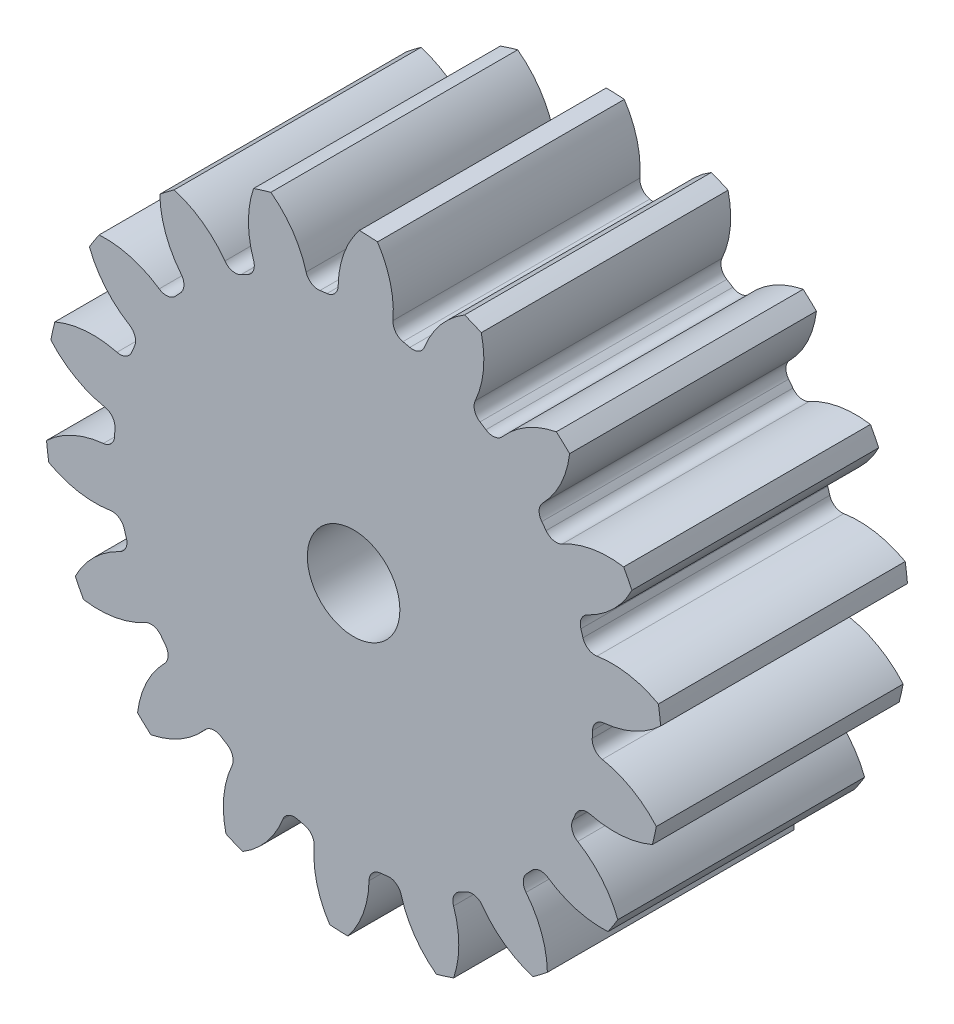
ISO-10303-21;
HEADER;
FILE_DESCRIPTION(('STEP AP214'),'2;1');
FILE_NAME('part.step','',(''),(''),'','','');
FILE_SCHEMA(('AUTOMOTIVE_DESIGN { 1 0 10303 214 1 1 1 1 }'));
ENDSEC;
DATA;
#1=APPLICATION_CONTEXT('core data for automotive mechanical design processes');
#2=APPLICATION_PROTOCOL_DEFINITION('international standard','automotive_design',2000,#1);
#3=PRODUCT_CONTEXT('',#1,'mechanical');
#4=PRODUCT('Part','Part','',(#3));
#5=PRODUCT_RELATED_PRODUCT_CATEGORY('part','',(#4));
#6=PRODUCT_DEFINITION_FORMATION('','',#4);
#7=PRODUCT_DEFINITION_CONTEXT('part definition',#1,'design');
#8=PRODUCT_DEFINITION('design','',#6,#7);
#9=PRODUCT_DEFINITION_SHAPE('','',#8);
#10=(LENGTH_UNIT() NAMED_UNIT(*) SI_UNIT(.MILLI.,.METRE.));
#11=(NAMED_UNIT(*) PLANE_ANGLE_UNIT() SI_UNIT($,.RADIAN.));
#12=(NAMED_UNIT(*) SI_UNIT($,.STERADIAN.) SOLID_ANGLE_UNIT());
#13=UNCERTAINTY_MEASURE_WITH_UNIT(LENGTH_MEASURE(1.E-05),#10,'distance_accuracy_value','');
#14=(GEOMETRIC_REPRESENTATION_CONTEXT(3) GLOBAL_UNCERTAINTY_ASSIGNED_CONTEXT((#13)) GLOBAL_UNIT_ASSIGNED_CONTEXT((#10,
#11,#12)) REPRESENTATION_CONTEXT('',''));
#15=CARTESIAN_POINT('',(0.,0.,0.));
#16=DIRECTION('',(0.,0.,1.));
#17=DIRECTION('',(1.,0.,0.));
#18=AXIS2_PLACEMENT_3D('',#15,#16,#17);
#19=CARTESIAN_POINT('',(0.,0.,101.6));
#20=DIRECTION('',(0.,0.,-1.));
#21=DIRECTION('',(-1.,0.,0.));
#22=AXIS2_PLACEMENT_3D('',#19,#20,#21);
#23=CYLINDRICAL_SURFACE('',#22,127.);
#24=DIRECTION('',(0.,0.,-1.));
#25=VECTOR('',#24,1.);
#26=CARTESIAN_POINT('',(125.464606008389,19.688388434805,50.8));
#27=LINE('',#26,#25);
#28=CARTESIAN_POINT('',(125.464606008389,19.688388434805,101.6));
#29=VERTEX_POINT('',#28);
#30=CARTESIAN_POINT('',(125.464606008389,19.688388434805,0.));
#31=VERTEX_POINT('',#30);
#32=EDGE_CURVE('E744',#29,#31,#27,.T.);
#33=ORIENTED_EDGE('',*,*,#32,.F.);
#34=CARTESIAN_POINT('',(0.,0.,101.6));
#35=DIRECTION('',(0.,0.,1.));
#36=DIRECTION('',(1.,0.,0.));
#37=AXIS2_PLACEMENT_3D('',#34,#35,#36);
#38=CIRCLE('',#37,127.);
#39=CARTESIAN_POINT('',(126.403685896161,12.2926072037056,101.6));
#40=VERTEX_POINT('',#39);
#41=EDGE_CURVE('E1389',#40,#29,#38,.T.);
#42=ORIENTED_EDGE('',*,*,#41,.F.);
#43=DIRECTION('',(0.,0.,-1.));
#44=VECTOR('',#43,1.);
#45=CARTESIAN_POINT('',(126.403685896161,12.2926072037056,50.8));
#46=LINE('',#45,#44);
#47=CARTESIAN_POINT('',(126.403685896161,12.2926072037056,0.));
#48=VERTEX_POINT('',#47);
#49=EDGE_CURVE('E1383',#48,#40,#46,.F.);
#50=ORIENTED_EDGE('',*,*,#49,.F.);
#51=CARTESIAN_POINT('',(0.,0.,0.));
#52=DIRECTION('',(0.,0.,1.));
#53=DIRECTION('',(1.,0.,0.));
#54=AXIS2_PLACEMENT_3D('',#51,#52,#53);
#55=CIRCLE('',#54,127.);
#56=EDGE_CURVE('E1394',#48,#31,#55,.T.);
#57=ORIENTED_EDGE('',*,*,#56,.T.);
#58=EDGE_LOOP('',(#33,#42,#50,#57));
#59=FACE_BOUND('',#58,.T.);
#60=ADVANCED_FACE('F33',(#59),#23,.T.);
#61=DIRECTION('',(0.,0.,-1.));
#62=VECTOR('',#61,1.);
#63=CARTESIAN_POINT('',(114.576291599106,54.7838790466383,50.8));
#64=LINE('',#63,#62);
#65=CARTESIAN_POINT('',(114.576291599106,54.7838790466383,0.));
#66=VERTEX_POINT('',#65);
#67=CARTESIAN_POINT('',(114.576291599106,54.7838790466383,101.6));
#68=VERTEX_POINT('',#67);
#69=EDGE_CURVE('E715',#66,#68,#64,.F.);
#70=ORIENTED_EDGE('',*,*,#69,.F.);
#71=CARTESIAN_POINT('',(111.164339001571,61.4124558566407,0.));
#72=VERTEX_POINT('',#71);
#73=EDGE_CURVE('E1397',#66,#72,#55,.T.);
#74=ORIENTED_EDGE('',*,*,#73,.T.);
#75=DIRECTION('',(0.,0.,-1.));
#76=VECTOR('',#75,1.);
#77=CARTESIAN_POINT('',(111.164339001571,61.4124558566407,50.8));
#78=LINE('',#77,#76);
#79=CARTESIAN_POINT('',(111.164339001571,61.4124558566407,101.6));
#80=VERTEX_POINT('',#79);
#81=EDGE_CURVE('E777',#80,#72,#78,.T.);
#82=ORIENTED_EDGE('',*,*,#81,.F.);
#83=EDGE_CURVE('E1392',#68,#80,#38,.T.);
#84=ORIENTED_EDGE('',*,*,#83,.F.);
#85=EDGE_LOOP('',(#70,#74,#82,#84));
#86=FACE_BOUND('',#85,.T.);
#87=ADVANCED_FACE('F1601',(#86),#23,.T.);
#88=CARTESIAN_POINT('',(0.,0.,101.6));
#89=DIRECTION('',(0.,0.,1.));
#90=DIRECTION('',(1.,0.,0.));
#91=AXIS2_PLACEMENT_3D('',#88,#89,#90);
#92=PLANE('',#91);
#93=CARTESIAN_POINT('',(0.,0.,101.599999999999));
#94=DIRECTION('',(0.,0.,1.));
#95=DIRECTION('',(1.,0.,0.));
#96=AXIS2_PLACEMENT_3D('',#93,#94,#95);
#97=CIRCLE('',#96,19.05);
#98=CARTESIAN_POINT('',(19.05,0.,101.599999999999));
#99=VERTEX_POINT('',#98);
#100=EDGE_CURVE('E732',#99,#99,#97,.T.);
#101=ORIENTED_EDGE('',*,*,#100,.F.);
#102=EDGE_LOOP('',(#101));
#103=FACE_BOUND('',#102,.T.);
#104=ORIENTED_EDGE('',*,*,#41,.T.);
#105=CARTESIAN_POINT('',(106.354488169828,-14.9985942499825,101.6));
#106=DIRECTION('',(0.,0.,-1.));
#107=DIRECTION('',(0.939692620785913,0.342020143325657,0.));
#108=AXIS2_PLACEMENT_3D('',#105,#106,#107);
#109=CIRCLE('',#108,39.6028202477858);
#110=CARTESIAN_POINT('',(100.18997074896,24.1215041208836,101.6));
#111=VERTEX_POINT('',#110);
#112=EDGE_CURVE('E724',#111,#29,#109,.T.);
#113=ORIENTED_EDGE('',*,*,#112,.F.);
#114=CARTESIAN_POINT('',(99.3853872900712,29.2273999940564,101.6));
#115=DIRECTION('',(0.,0.,1.));
#116=DIRECTION('',(-0.939692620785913,-0.342020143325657,0.));
#117=AXIS2_PLACEMENT_3D('',#114,#115,#116);
#118=CIRCLE('',#117,5.16889999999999);
#119=CARTESIAN_POINT('',(94.4264743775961,27.769075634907,101.6));
#120=VERTEX_POINT('',#119);
#121=EDGE_CURVE('E722',#120,#111,#118,.T.);
#122=ORIENTED_EDGE('',*,*,#121,.F.);
#123=CARTESIAN_POINT('',(0.,0.,101.6));
#124=DIRECTION('',(0.,0.,-1.));
#125=DIRECTION('',(0.939692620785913,0.342020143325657,0.));
#126=AXIS2_PLACEMENT_3D('',#123,#124,#125);
#127=CIRCLE('',#126,98.425);
#128=CARTESIAN_POINT('',(93.5624110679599,30.5541463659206,101.6));
#129=VERTEX_POINT('',#128);
#130=EDGE_CURVE('E707',#129,#120,#127,.T.);
#131=ORIENTED_EDGE('',*,*,#130,.F.);
#132=CARTESIAN_POINT('',(98.475946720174,32.1587318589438,101.6));
#133=DIRECTION('',(0.,0.,1.));
#134=DIRECTION('',(-0.939692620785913,-0.342020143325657,0.));
#135=AXIS2_PLACEMENT_3D('',#132,#133,#134);
#136=CIRCLE('',#135,5.16889999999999);
#137=CARTESIAN_POINT('',(96.249226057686,36.8234121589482,101.6));
#138=VERTEX_POINT('',#137);
#139=EDGE_CURVE('E699',#138,#129,#136,.T.);
#140=ORIENTED_EDGE('',*,*,#139,.F.);
#141=CARTESIAN_POINT('',(79.1886487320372,72.5630270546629,101.6));
#142=DIRECTION('',(0.,0.,-1.));
#143=DIRECTION('',(-0.939692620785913,-0.342020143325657,0.));
#144=AXIS2_PLACEMENT_3D('',#141,#142,#143);
#145=CIRCLE('',#144,39.6028202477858);
#146=EDGE_CURVE('E729',#68,#138,#145,.T.);
#147=ORIENTED_EDGE('',*,*,#146,.F.);
#148=ORIENTED_EDGE('',*,*,#83,.T.);
#149=CARTESIAN_POINT('',(105.070349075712,22.2813089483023,101.6));
#150=DIRECTION('',(0.,0.,-1.));
#151=DIRECTION('',(0.766044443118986,0.64278760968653,0.));
#152=AXIS2_PLACEMENT_3D('',#149,#150,#151);
#153=CIRCLE('',#152,39.6028202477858);
#154=CARTESIAN_POINT('',(85.8977358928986,56.9337875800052,101.6));
#155=VERTEX_POINT('',#154);
#156=EDGE_CURVE('E753',#155,#80,#153,.T.);
#157=ORIENTED_EDGE('',*,*,#156,.F.);
#158=CARTESIAN_POINT('',(83.3953555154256,61.4565765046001,101.6));
#159=DIRECTION('',(0.,0.,1.));
#160=DIRECTION('',(-0.766044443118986,-0.64278760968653,0.));
#161=AXIS2_PLACEMENT_3D('',#158,#159,#160);
#162=CIRCLE('',#161,5.16889999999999);
#163=CARTESIAN_POINT('',(79.2342779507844,58.390151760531,101.6));
#164=VERTEX_POINT('',#163);
#165=EDGE_CURVE('E751',#164,#155,#162,.T.);
#166=ORIENTED_EDGE('',*,*,#165,.F.);
#167=CARTESIAN_POINT('',(0.,0.,101.6));
#168=DIRECTION('',(0.,0.,-1.));
#169=DIRECTION('',(0.766044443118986,0.64278760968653,0.));
#170=AXIS2_PLACEMENT_3D('',#167,#168,#169);
#171=CIRCLE('',#170,98.425);
#172=CARTESIAN_POINT('',(77.469773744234,60.711735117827,101.6));
#173=VERTEX_POINT('',#172);
#174=EDGE_CURVE('E748',#173,#164,#171,.T.);
#175=ORIENTED_EDGE('',*,*,#174,.F.);
#176=CARTESIAN_POINT('',(81.5381863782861,63.9000804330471,101.6));
#177=DIRECTION('',(0.,0.,1.));
#178=DIRECTION('',(-0.766044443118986,-0.64278760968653,0.));
#179=AXIS2_PLACEMENT_3D('',#176,#177,#178);
#180=CIRCLE('',#179,5.16889999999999);
#181=CARTESIAN_POINT('',(77.8503387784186,67.5218627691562,101.6));
#182=VERTEX_POINT('',#181);
#183=EDGE_CURVE('E746',#182,#173,#180,.T.);
#184=ORIENTED_EDGE('',*,*,#183,.F.);
#185=CARTESIAN_POINT('',(49.5949719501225,95.2710540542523,101.6));
#186=DIRECTION('',(0.,0.,-1.));
#187=DIRECTION('',(-0.766044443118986,-0.64278760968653,0.));
#188=AXIS2_PLACEMENT_3D('',#185,#186,#187);
#189=CIRCLE('',#188,39.6028202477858);
#190=CARTESIAN_POINT('',(88.9293055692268,90.6674065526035,101.6));
#191=VERTEX_POINT('',#190);
#192=EDGE_CURVE('E756',#191,#182,#189,.T.);
#193=ORIENTED_EDGE('',*,*,#192,.F.);
#194=CARTESIAN_POINT('',(83.4560121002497,95.7292747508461,101.6));
#195=VERTEX_POINT('',#194);
#196=EDGE_CURVE('E1441',#191,#195,#38,.T.);
#197=ORIENTED_EDGE('',*,*,#196,.T.);
#198=CARTESIAN_POINT('',(91.1131752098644,56.8737574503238,101.6));
#199=DIRECTION('',(0.,0.,-1.));
#200=DIRECTION('',(0.50000000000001,0.866025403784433,0.));
#201=AXIS2_PLACEMENT_3D('',#198,#199,#200);
#202=CIRCLE('',#201,39.6028202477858);
#203=CARTESIAN_POINT('',(61.244966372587,82.8790160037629,101.6));
#204=VERTEX_POINT('',#203);
#205=EDGE_CURVE('E788',#204,#195,#202,.T.);
#206=ORIENTED_EDGE('',*,*,#205,.F.);
#207=CARTESIAN_POINT('',(57.3466130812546,86.2731828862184,101.6));
#208=DIRECTION('',(0.,0.,1.));
#209=DIRECTION('',(-0.50000000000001,-0.866025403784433,0.));
#210=AXIS2_PLACEMENT_3D('',#207,#208,#209);
#211=CIRCLE('',#210,5.16889999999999);
#212=CARTESIAN_POINT('',(54.4852582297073,81.9685138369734,101.6));
#213=VERTEX_POINT('',#212);
#214=EDGE_CURVE('E786',#213,#204,#211,.T.);
#215=ORIENTED_EDGE('',*,*,#214,.F.);
#216=CARTESIAN_POINT('',(0.,0.,101.6));
#217=DIRECTION('',(0.,0.,-1.));
#218=DIRECTION('',(0.50000000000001,0.866025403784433,0.));
#219=AXIS2_PLACEMENT_3D('',#216,#217,#218);
#220=CIRCLE('',#219,98.425);
#221=CARTESIAN_POINT('',(52.0331383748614,83.5465926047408,101.6));
#222=VERTEX_POINT('',#221);
#223=EDGE_CURVE('E783',#222,#213,#220,.T.);
#224=ORIENTED_EDGE('',*,*,#223,.F.);
#225=CARTESIAN_POINT('',(54.7657173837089,87.9341362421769,101.6));
#226=DIRECTION('',(0.,0.,1.));
#227=DIRECTION('',(-0.50000000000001,-0.866025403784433,0.));
#228=AXIS2_PLACEMENT_3D('',#225,#226,#227);
#229=CIRCLE('',#228,5.16889999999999);
#230=CARTESIAN_POINT('',(50.06155169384,90.0761802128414,101.6));
#231=VERTEX_POINT('',#230);
#232=EDGE_CURVE('E781',#231,#222,#229,.T.);
#233=ORIENTED_EDGE('',*,*,#232,.F.);
#234=CARTESIAN_POINT('',(14.0194096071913,106.48798588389,101.6));
#235=DIRECTION('',(0.,0.,-1.));
#236=DIRECTION('',(-0.50000000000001,-0.866025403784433,0.));
#237=AXIS2_PLACEMENT_3D('',#234,#235,#236);
#238=CIRCLE('',#237,39.6028202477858);
#239=CARTESIAN_POINT('',(52.5561328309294,115.615106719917,101.6));
#240=VERTEX_POINT('',#239);
#241=EDGE_CURVE('E791',#240,#231,#238,.T.);
#242=ORIENTED_EDGE('',*,*,#241,.F.);
#243=CARTESIAN_POINT('',(45.6816584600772,118.499730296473,101.6));
#244=VERTEX_POINT('',#243);
#245=EDGE_CURVE('E1583',#240,#244,#38,.T.);
#246=ORIENTED_EDGE('',*,*,#245,.T.);
#247=CARTESIAN_POINT('',(66.1664077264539,84.6063914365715,101.6));
#248=DIRECTION('',(0.,0.,-1.));
#249=DIRECTION('',(0.17364817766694,0.984807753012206,0.));
#250=AXIS2_PLACEMENT_3D('',#247,#248,#249);
#251=CIRCLE('',#250,39.6028202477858);
#252=CARTESIAN_POINT('',(29.2051500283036,98.8278119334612,101.6));
#253=VERTEX_POINT('',#252);
#254=EDGE_CURVE('E826',#253,#244,#251,.T.);
#255=ORIENTED_EDGE('',*,*,#254,.F.);
#256=CARTESIAN_POINT('',(24.3810227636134,100.683970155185,101.6));
#257=DIRECTION('',(0.,0.,1.));
#258=DIRECTION('',(-0.17364817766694,-0.984807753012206,0.));
#259=AXIS2_PLACEMENT_3D('',#256,#257,#258);
#260=CIRCLE('',#259,5.16889999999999);
#261=CARTESIAN_POINT('',(23.1645122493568,95.6602634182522,101.6));
#262=VERTEX_POINT('',#261);
#263=EDGE_CURVE('E824',#262,#253,#260,.T.);
#264=ORIENTED_EDGE('',*,*,#263,.F.);
#265=CARTESIAN_POINT('',(0.,0.,101.6));
#266=DIRECTION('',(0.,0.,-1.));
#267=DIRECTION('',(0.17364817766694,0.984807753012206,0.));
#268=AXIS2_PLACEMENT_3D('',#265,#266,#267);
#269=CIRCLE('',#268,98.425);
#270=CARTESIAN_POINT('',(20.3205385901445,96.3044980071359,101.6));
#271=VERTEX_POINT('',#270);
#272=EDGE_CURVE('E821',#271,#262,#269,.T.);
#273=ORIENTED_EDGE('',*,*,#272,.F.);
#274=CARTESIAN_POINT('',(21.3876946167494,101.362037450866,101.6));
#275=DIRECTION('',(0.,0.,1.));
#276=DIRECTION('',(-0.17364817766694,-0.984807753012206,0.));
#277=AXIS2_PLACEMENT_3D('',#274,#275,#276);
#278=CIRCLE('',#277,5.16889999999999);
#279=CARTESIAN_POINT('',(16.2346026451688,101.765980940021,101.6));
#280=VERTEX_POINT('',#279);
#281=EDGE_CURVE('E819',#280,#271,#278,.T.);
#282=ORIENTED_EDGE('',*,*,#281,.F.);
#283=CARTESIAN_POINT('',(-23.2471004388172,104.860895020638,101.6));
#284=DIRECTION('',(0.,0.,-1.));
#285=DIRECTION('',(-0.17364817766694,-0.984807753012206,0.));
#286=AXIS2_PLACEMENT_3D('',#283,#284,#285);
#287=CIRCLE('',#286,39.6028202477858);
#288=CARTESIAN_POINT('',(9.8439148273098,126.617918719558,101.6));
#289=VERTEX_POINT('',#288);
#290=EDGE_CURVE('E829',#289,#280,#287,.T.);
#291=ORIENTED_EDGE('',*,*,#290,.F.);
#292=CARTESIAN_POINT('',(2.39742262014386,126.977369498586,101.6));
#293=VERTEX_POINT('',#292);
#294=EDGE_CURVE('E1579',#289,#293,#38,.T.);
#295=ORIENTED_EDGE('',*,*,#294,.T.);
#296=CARTESIAN_POINT('',(33.2389949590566,102.134245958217,101.6));
#297=DIRECTION('',(0.,0.,-1.));
#298=DIRECTION('',(-0.173648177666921,0.98480775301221,0.));
#299=AXIS2_PLACEMENT_3D('',#296,#297,#298);
#300=CIRCLE('',#299,39.6028202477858);
#301=CARTESIAN_POINT('',(-6.35723843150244,102.856515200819,101.6));
#302=VERTEX_POINT('',#301);
#303=EDGE_CURVE('E864',#302,#293,#300,.T.);
#304=ORIENTED_EDGE('',*,*,#303,.F.);
#305=CARTESIAN_POINT('',(-11.525278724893,102.950784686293,101.6));
#306=DIRECTION('',(0.,0.,1.));
#307=DIRECTION('',(0.173648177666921,-0.98480775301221,0.));
#308=AXIS2_PLACEMENT_3D('',#305,#306,#307);
#309=CIRCLE('',#308,5.16889999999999);
#310=CARTESIAN_POINT('',(-10.9502157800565,97.813973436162,101.6));
#311=VERTEX_POINT('',#310);
#312=EDGE_CURVE('E862',#311,#302,#309,.T.);
#313=ORIENTED_EDGE('',*,*,#312,.F.);
#314=CARTESIAN_POINT('',(0.,0.,101.6));
#315=DIRECTION('',(0.,0.,-1.));
#316=DIRECTION('',(-0.173648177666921,0.98480775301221,0.));
#317=AXIS2_PLACEMENT_3D('',#314,#315,#316);
#318=CIRCLE('',#317,98.425);
#319=CARTESIAN_POINT('',(-13.8430180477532,97.4466596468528,101.6));
#320=VERTEX_POINT('',#319);
#321=EDGE_CURVE('E859',#320,#311,#318,.T.);
#322=ORIENTED_EDGE('',*,*,#321,.F.);
#323=CARTESIAN_POINT('',(-14.5699997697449,102.56418099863,101.6));
#324=DIRECTION('',(0.,0.,1.));
#325=DIRECTION('',(0.173648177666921,-0.98480775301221,0.));
#326=AXIS2_PLACEMENT_3D('',#323,#324,#325);
#327=CIRCLE('',#326,5.16889999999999);
#328=CARTESIAN_POINT('',(-19.5504790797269,101.181302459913,101.6));
#329=VERTEX_POINT('',#328);
#330=EDGE_CURVE('E857',#329,#320,#327,.T.);
#331=ORIENTED_EDGE('',*,*,#330,.F.);
#332=CARTESIAN_POINT('',(-57.7096670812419,90.5860326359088,101.6));
#333=DIRECTION('',(0.,0.,-1.));
#334=DIRECTION('',(0.173648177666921,-0.98480775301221,0.));
#335=AXIS2_PLACEMENT_3D('',#332,#333,#334);
#336=CIRCLE('',#335,39.6028202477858);
#337=CARTESIAN_POINT('',(-34.0556245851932,122.348741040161,101.6));
#338=VERTEX_POINT('',#337);
#339=EDGE_CURVE('E867',#338,#329,#336,.T.);
#340=ORIENTED_EDGE('',*,*,#339,.F.);
#341=CARTESIAN_POINT('',(-41.1759777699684,120.139663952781,101.6));
#342=VERTEX_POINT('',#341);
#343=EDGE_CURVE('E1575',#338,#342,#38,.T.);
#344=ORIENTED_EDGE('',*,*,#343,.T.);
#345=CARTESIAN_POINT('',(-3.69753115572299,107.343203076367,101.6));
#346=DIRECTION('',(0.,0.,-1.));
#347=DIRECTION('',(-0.499999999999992,0.866025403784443,0.));
#348=AXIS2_PLACEMENT_3D('',#345,#346,#347);
#349=CIRCLE('',#348,39.6028202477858);
#350=CARTESIAN_POINT('',(-41.1528501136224,94.4792047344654,101.6));
#351=VERTEX_POINT('',#350);
#352=EDGE_CURVE('E902',#351,#342,#349,.T.);
#353=ORIENTED_EDGE('',*,*,#352,.F.);
#354=CARTESIAN_POINT('',(-46.0414615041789,92.8002151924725,101.6));
#355=DIRECTION('',(0.,0.,1.));
#356=DIRECTION('',(0.499999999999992,-0.866025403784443,0.));
#357=AXIS2_PLACEMENT_3D('',#354,#355,#356);
#358=CIRCLE('',#357,5.16889999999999);
#359=CARTESIAN_POINT('',(-43.7441861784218,88.1698746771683,101.6));
#360=VERTEX_POINT('',#359);
#361=EDGE_CURVE('E900',#360,#351,#358,.T.);
#362=ORIENTED_EDGE('',*,*,#361,.F.);
#363=CARTESIAN_POINT('',(0.,0.,101.6));
#364=DIRECTION('',(0.,0.,-1.));
#365=DIRECTION('',(-0.499999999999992,0.866025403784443,0.));
#366=AXIS2_PLACEMENT_3D('',#363,#364,#365);
#367=CIRCLE('',#366,98.425);
#368=CARTESIAN_POINT('',(-46.3369024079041,86.8353159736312,101.6));
#369=VERTEX_POINT('',#368);
#370=EDGE_CURVE('E897',#369,#360,#367,.T.);
#371=ORIENTED_EDGE('',*,*,#370,.F.);
#372=CARTESIAN_POINT('',(-48.7703371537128,91.3955706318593,101.6));
#373=DIRECTION('',(0.,0.,1.));
#374=DIRECTION('',(0.499999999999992,-0.866025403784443,0.));
#375=AXIS2_PLACEMENT_3D('',#372,#373,#374);
#376=CIRCLE('',#375,5.16889999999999);
#377=CARTESIAN_POINT('',(-52.9774844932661,88.3926656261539,101.6));
#378=VERTEX_POINT('',#377);
#379=EDGE_CURVE('E895',#378,#369,#376,.T.);
#380=ORIENTED_EDGE('',*,*,#379,.F.);
#381=CARTESIAN_POINT('',(-85.2115961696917,65.3851578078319,101.6));
#382=DIRECTION('',(0.,0.,-1.));
#383=DIRECTION('',(0.499999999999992,-0.866025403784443,0.));
#384=AXIS2_PLACEMENT_3D('',#381,#382,#383);
#385=CIRCLE('',#384,39.6028202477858);
#386=CARTESIAN_POINT('',(-73.8475530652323,103.322499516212,101.6));
#387=VERTEX_POINT('',#386);
#388=EDGE_CURVE('E905',#387,#378,#385,.T.);
#389=ORIENTED_EDGE('',*,*,#388,.F.);
#390=CARTESIAN_POINT('',(-79.7829475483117,98.8113418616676,101.6));
#391=VERTEX_POINT('',#390);
#392=EDGE_CURVE('E1571',#387,#391,#38,.T.);
#393=ORIENTED_EDGE('',*,*,#392,.T.);
#394=CARTESIAN_POINT('',(-40.1880804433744,99.6049856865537,101.6));
#395=DIRECTION('',(0.,0.,-1.));
#396=DIRECTION('',(-0.766044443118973,0.642787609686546,0.));
#397=AXIS2_PLACEMENT_3D('',#394,#395,#396);
#398=CIRCLE('',#397,39.6028202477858);
#399=CARTESIAN_POINT('',(-70.9848207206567,74.7063078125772,101.6));
#400=VERTEX_POINT('',#399);
#401=EDGE_CURVE('E940',#400,#391,#398,.T.);
#402=ORIENTED_EDGE('',*,*,#401,.F.);
#403=CARTESIAN_POINT('',(-75.0043645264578,71.4565701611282,101.6));
#404=DIRECTION('',(0.,0.,1.));
#405=DIRECTION('',(0.766044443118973,-0.642787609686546,0.));
#406=AXIS2_PLACEMENT_3D('',#403,#404,#405);
#407=CIRCLE('',#406,5.16889999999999);
#408=CARTESIAN_POINT('',(-71.2619621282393,67.8911877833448,101.6));
#409=VERTEX_POINT('',#408);
#410=EDGE_CURVE('E938',#409,#400,#407,.T.);
#411=ORIENTED_EDGE('',*,*,#410,.F.);
#412=CARTESIAN_POINT('',(0.,0.,101.6));
#413=DIRECTION('',(0.,0.,-1.));
#414=DIRECTION('',(-0.766044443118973,0.642787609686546,0.));
#415=AXIS2_PLACEMENT_3D('',#412,#413,#414);
#416=CIRCLE('',#415,98.425);
#417=CARTESIAN_POINT('',(-73.2418724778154,65.7503516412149,101.6));
#418=VERTEX_POINT('',#417);
#419=EDGE_CURVE('E935',#418,#409,#416,.T.);
#420=ORIENTED_EDGE('',*,*,#419,.F.);
#421=CARTESIAN_POINT('',(-77.0882521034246,69.2033055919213,101.6));
#422=DIRECTION('',(0.,0.,1.));
#423=DIRECTION('',(0.766044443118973,-0.642787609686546,0.));
#424=AXIS2_PLACEMENT_3D('',#421,#422,#423);
#425=CIRCLE('',#424,5.16889999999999);
#426=CARTESIAN_POINT('',(-80.0146234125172,64.9425687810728,101.6));
#427=VERTEX_POINT('',#426);
#428=EDGE_CURVE('E933',#427,#418,#425,.T.);
#429=ORIENTED_EDGE('',*,*,#428,.F.);
#430=CARTESIAN_POINT('',(-102.435749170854,32.2978679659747,101.6));
#431=DIRECTION('',(0.,0.,-1.));
#432=DIRECTION('',(0.766044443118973,-0.642787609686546,0.));
#433=AXIS2_PLACEMENT_3D('',#430,#431,#432);
#434=CIRCLE('',#433,39.6028202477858);
#435=CARTESIAN_POINT('',(-104.732376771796,71.8340396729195,101.6));
#436=VERTEX_POINT('',#435);
#437=EDGE_CURVE('E943',#436,#427,#434,.T.);
#438=ORIENTED_EDGE('',*,*,#437,.F.);
#439=CARTESIAN_POINT('',(-108.766916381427,65.5649136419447,101.6));
#440=VERTEX_POINT('',#439);
#441=EDGE_CURVE('E1567',#436,#440,#38,.T.);
#442=ORIENTED_EDGE('',*,*,#441,.T.);
#443=CARTESIAN_POINT('',(-71.8313541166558,79.8529370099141,101.6));
#444=DIRECTION('',(0.,0.,-1.));
#445=DIRECTION('',(-0.939692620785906,0.342020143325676,0.));
#446=AXIS2_PLACEMENT_3D('',#443,#444,#445);
#447=CIRCLE('',#446,39.6028202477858);
#448=CARTESIAN_POINT('',(-92.2549743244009,45.9227276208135,101.6));
#449=VERTEX_POINT('',#448);
#450=EDGE_CURVE('E978',#449,#440,#447,.T.);
#451=ORIENTED_EDGE('',*,*,#450,.F.);
#452=CARTESIAN_POINT('',(-94.9206342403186,41.4942081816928,101.6));
#453=DIRECTION('',(0.,0.,1.));
#454=DIRECTION('',(0.939692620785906,-0.342020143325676,0.));
#455=AXIS2_PLACEMENT_3D('',#452,#453,#454);
#456=CIRCLE('',#455,5.16889999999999);
#457=CARTESIAN_POINT('',(-90.1844937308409,39.4238216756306,101.6));
#458=VERTEX_POINT('',#457);
#459=EDGE_CURVE('E976',#458,#449,#456,.T.);
#460=ORIENTED_EDGE('',*,*,#459,.F.);
#461=CARTESIAN_POINT('',(0.,0.,101.6));
#462=DIRECTION('',(0.,0.,-1.));
#463=DIRECTION('',(-0.939692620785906,0.342020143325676,0.));
#464=AXIS2_PLACEMENT_3D('',#461,#462,#463);
#465=CIRCLE('',#464,98.425);
#466=CARTESIAN_POINT('',(-91.3127917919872,36.7349245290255,101.6));
#467=VERTEX_POINT('',#466);
#468=EDGE_CURVE('E973',#467,#458,#465,.T.);
#469=ORIENTED_EDGE('',*,*,#468,.F.);
#470=CARTESIAN_POINT('',(-96.1081861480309,38.664100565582,101.6));
#471=DIRECTION('',(0.,0.,1.));
#472=DIRECTION('',(0.939692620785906,-0.342020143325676,0.));
#473=AXIS2_PLACEMENT_3D('',#470,#471,#472);
#474=CIRCLE('',#473,5.16889999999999);
#475=CARTESIAN_POINT('',(-97.4008178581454,33.6594396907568,101.6));
#476=VERTEX_POINT('',#475);
#477=EDGE_CURVE('E971',#476,#467,#474,.T.);
#478=ORIENTED_EDGE('',*,*,#477,.F.);
#479=CARTESIAN_POINT('',(-107.304639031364,-4.68502141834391,101.6));
#480=DIRECTION('',(0.,0.,-1.));
#481=DIRECTION('',(0.939692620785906,-0.342020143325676,0.));
#482=AXIS2_PLACEMENT_3D('',#479,#480,#481);
#483=CIRCLE('',#482,39.6028202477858);
#484=CARTESIAN_POINT('',(-122.98493015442,31.681334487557,101.6));
#485=VERTEX_POINT('',#484);
#486=EDGE_CURVE('E981',#485,#476,#483,.T.);
#487=ORIENTED_EDGE('',*,*,#486,.F.);
#488=CARTESIAN_POINT('',(-124.631989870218,24.4103892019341,101.6));
#489=VERTEX_POINT('',#488);
#490=EDGE_CURVE('E1563',#485,#489,#38,.T.);
#491=ORIENTED_EDGE('',*,*,#490,.T.);
#492=CARTESIAN_POINT('',(-94.8107063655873,50.4694456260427,101.6));
#493=DIRECTION('',(0.,0.,-1.));
#494=DIRECTION('',(-1.,0.,0.));
#495=AXIS2_PLACEMENT_3D('',#492,#493,#494);
#496=CIRCLE('',#495,39.6028202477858);
#497=CARTESIAN_POINT('',(-102.397816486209,11.6001887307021,101.6));
#498=VERTEX_POINT('',#497);
#499=EDGE_CURVE('E1016',#498,#489,#496,.T.);
#500=ORIENTED_EDGE('',*,*,#499,.F.);
#501=CARTESIAN_POINT('',(-103.388074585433,6.52703230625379,101.6));
#502=DIRECTION('',(0.,0.,1.));
#503=DIRECTION('',(1.,0.,0.));
#504=AXIS2_PLACEMENT_3D('',#501,#502,#503);
#505=CIRCLE('',#504,5.16889999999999);
#506=CARTESIAN_POINT('',(-98.229444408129,6.20136084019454,101.6));
#507=VERTEX_POINT('',#506);
#508=EDGE_CURVE('E1014',#507,#498,#505,.T.);
#509=ORIENTED_EDGE('',*,*,#508,.F.);
#510=CARTESIAN_POINT('',(0.,0.,101.6));
#511=DIRECTION('',(0.,0.,-1.));
#512=DIRECTION('',(-1.,0.,0.));
#513=AXIS2_PLACEMENT_3D('',#510,#511,#512);
#514=CIRCLE('',#513,98.425);
#515=CARTESIAN_POINT('',(-98.3700407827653,3.28872336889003,101.6));
#516=VERTEX_POINT('',#515);
#517=EDGE_CURVE('E1011',#516,#507,#514,.T.);
#518=ORIENTED_EDGE('',*,*,#517,.F.);
#519=CARTESIAN_POINT('',(-103.536054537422,3.46143438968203,101.6));
#520=DIRECTION('',(0.,0.,1.));
#521=DIRECTION('',(1.,0.,0.));
#522=AXIS2_PLACEMENT_3D('',#519,#520,#521);
#523=CIRCLE('',#522,5.16889999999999);
#524=CARTESIAN_POINT('',(-103.039036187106,-1.68351458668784,101.6));
#525=VERTEX_POINT('',#524);
#526=EDGE_CURVE('E1009',#525,#516,#523,.T.);
#527=ORIENTED_EDGE('',*,*,#526,.F.);
#528=CARTESIAN_POINT('',(-99.2310057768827,-41.1028280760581,101.6));
#529=DIRECTION('',(0.,0.,-1.));
#530=DIRECTION('',(1.,0.,0.));
#531=AXIS2_PLACEMENT_3D('',#528,#529,#530);
#532=CIRCLE('',#531,39.6028202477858);
#533=CARTESIAN_POINT('',(-126.403685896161,-12.2926072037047,101.6));
#534=VERTEX_POINT('',#533);
#535=EDGE_CURVE('E1019',#534,#525,#532,.T.);
#536=ORIENTED_EDGE('',*,*,#535,.F.);
#537=CARTESIAN_POINT('',(-125.464606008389,-19.6883884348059,101.6));
#538=VERTEX_POINT('',#537);
#539=EDGE_CURVE('E1559',#534,#538,#38,.T.);
#540=ORIENTED_EDGE('',*,*,#539,.T.);
#541=CARTESIAN_POINT('',(-106.354488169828,14.9985942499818,101.6));
#542=DIRECTION('',(0.,0.,-1.));
#543=DIRECTION('',(-0.939692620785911,-0.342020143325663,0.));
#544=AXIS2_PLACEMENT_3D('',#541,#542,#543);
#545=CIRCLE('',#544,39.6028202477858);
#546=CARTESIAN_POINT('',(-100.18997074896,-24.1215041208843,101.6));
#547=VERTEX_POINT('',#546);
#548=EDGE_CURVE('E1054',#547,#538,#545,.T.);
#549=ORIENTED_EDGE('',*,*,#548,.F.);
#550=CARTESIAN_POINT('',(-99.385387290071,-29.227399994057,101.6));
#551=DIRECTION('',(0.,0.,1.));
#552=DIRECTION('',(0.939692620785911,0.342020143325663,0.));
#553=AXIS2_PLACEMENT_3D('',#550,#551,#552);
#554=CIRCLE('',#553,5.16889999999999);
#555=CARTESIAN_POINT('',(-94.4264743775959,-27.7690756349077,101.6));
#556=VERTEX_POINT('',#555);
#557=EDGE_CURVE('E1052',#556,#547,#554,.T.);
#558=ORIENTED_EDGE('',*,*,#557,.F.);
#559=CARTESIAN_POINT('',(0.,0.,101.6));
#560=DIRECTION('',(0.,0.,-1.));
#561=DIRECTION('',(-0.939692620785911,-0.342020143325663,0.));
#562=AXIS2_PLACEMENT_3D('',#559,#560,#561);
#563=CIRCLE('',#562,98.425);
#564=CARTESIAN_POINT('',(-93.5624110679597,-30.5541463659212,101.6));
#565=VERTEX_POINT('',#564);
#566=EDGE_CURVE('E1049',#565,#556,#563,.T.);
#567=ORIENTED_EDGE('',*,*,#566,.F.);
#568=CARTESIAN_POINT('',(-98.4759467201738,-32.1587318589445,101.6));
#569=DIRECTION('',(0.,0.,1.));
#570=DIRECTION('',(0.939692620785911,0.342020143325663,0.));
#571=AXIS2_PLACEMENT_3D('',#568,#569,#570);
#572=CIRCLE('',#571,5.16889999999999);
#573=CARTESIAN_POINT('',(-96.2492260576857,-36.8234121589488,101.6));
#574=VERTEX_POINT('',#573);
#575=EDGE_CURVE('E1047',#574,#565,#572,.T.);
#576=ORIENTED_EDGE('',*,*,#575,.F.);
#577=CARTESIAN_POINT('',(-79.1886487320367,-72.5630270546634,101.6));
#578=DIRECTION('',(0.,0.,-1.));
#579=DIRECTION('',(0.939692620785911,0.342020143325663,0.));
#580=AXIS2_PLACEMENT_3D('',#577,#578,#579);
#581=CIRCLE('',#580,39.6028202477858);
#582=CARTESIAN_POINT('',(-114.576291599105,-54.783879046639,101.6));
#583=VERTEX_POINT('',#582);
#584=EDGE_CURVE('E1057',#583,#574,#581,.T.);
#585=ORIENTED_EDGE('',*,*,#584,.F.);
#586=CARTESIAN_POINT('',(-111.16433900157,-61.4124558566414,101.6));
#587=VERTEX_POINT('',#586);
#588=EDGE_CURVE('E1555',#583,#587,#38,.T.);
#589=ORIENTED_EDGE('',*,*,#588,.T.);
#590=CARTESIAN_POINT('',(-105.070349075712,-22.281308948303,101.6));
#591=DIRECTION('',(0.,0.,-1.));
#592=DIRECTION('',(-0.766044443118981,-0.642787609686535,0.));
#593=AXIS2_PLACEMENT_3D('',#590,#591,#592);
#594=CIRCLE('',#593,39.6028202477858);
#595=CARTESIAN_POINT('',(-85.8977358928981,-56.9337875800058,101.6));
#596=VERTEX_POINT('',#595);
#597=EDGE_CURVE('E1092',#596,#587,#594,.T.);
#598=ORIENTED_EDGE('',*,*,#597,.F.);
#599=CARTESIAN_POINT('',(-83.3953555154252,-61.4565765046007,101.6));
#600=DIRECTION('',(0.,0.,1.));
#601=DIRECTION('',(0.766044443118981,0.642787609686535,0.));
#602=AXIS2_PLACEMENT_3D('',#599,#600,#601);
#603=CIRCLE('',#602,5.16889999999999);
#604=CARTESIAN_POINT('',(-79.234277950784,-58.3901517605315,101.6));
#605=VERTEX_POINT('',#604);
#606=EDGE_CURVE('E1090',#605,#596,#603,.T.);
#607=ORIENTED_EDGE('',*,*,#606,.F.);
#608=CARTESIAN_POINT('',(0.,0.,101.6));
#609=DIRECTION('',(0.,0.,-1.));
#610=DIRECTION('',(-0.766044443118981,-0.642787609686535,0.));
#611=AXIS2_PLACEMENT_3D('',#608,#609,#610);
#612=CIRCLE('',#611,98.425);
#613=CARTESIAN_POINT('',(-77.4697737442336,-60.7117351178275,101.6));
#614=VERTEX_POINT('',#613);
#615=EDGE_CURVE('E1087',#614,#605,#612,.T.);
#616=ORIENTED_EDGE('',*,*,#615,.F.);
#617=CARTESIAN_POINT('',(-81.5381863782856,-63.9000804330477,101.6));
#618=DIRECTION('',(0.,0.,1.));
#619=DIRECTION('',(0.766044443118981,0.642787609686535,0.));
#620=AXIS2_PLACEMENT_3D('',#617,#618,#619);
#621=CIRCLE('',#620,5.16889999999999);
#622=CARTESIAN_POINT('',(-77.8503387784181,-67.5218627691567,101.6));
#623=VERTEX_POINT('',#622);
#624=EDGE_CURVE('E1085',#623,#614,#621,.T.);
#625=ORIENTED_EDGE('',*,*,#624,.F.);
#626=CARTESIAN_POINT('',(-49.5949719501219,-95.2710540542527,101.6));
#627=DIRECTION('',(0.,0.,-1.));
#628=DIRECTION('',(0.766044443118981,0.642787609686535,0.));
#629=AXIS2_PLACEMENT_3D('',#626,#627,#628);
#630=CIRCLE('',#629,39.6028202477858);
#631=CARTESIAN_POINT('',(-88.9293055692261,-90.6674065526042,101.6));
#632=VERTEX_POINT('',#631);
#633=EDGE_CURVE('E1095',#632,#623,#630,.T.);
#634=ORIENTED_EDGE('',*,*,#633,.F.);
#635=CARTESIAN_POINT('',(-83.456012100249,-95.7292747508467,101.6));
#636=VERTEX_POINT('',#635);
#637=EDGE_CURVE('E1551',#632,#636,#38,.T.);
#638=ORIENTED_EDGE('',*,*,#637,.T.);
#639=CARTESIAN_POINT('',(-91.113175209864,-56.8737574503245,101.6));
#640=DIRECTION('',(0.,0.,-1.));
#641=DIRECTION('',(-0.500000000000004,-0.866025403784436,0.));
#642=AXIS2_PLACEMENT_3D('',#639,#640,#641);
#643=CIRCLE('',#642,39.6028202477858);
#644=CARTESIAN_POINT('',(-61.2449663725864,-82.8790160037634,101.6));
#645=VERTEX_POINT('',#644);
#646=EDGE_CURVE('E1130',#645,#636,#643,.T.);
#647=ORIENTED_EDGE('',*,*,#646,.F.);
#648=CARTESIAN_POINT('',(-57.346613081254,-86.2731828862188,101.6));
#649=DIRECTION('',(0.,0.,1.));
#650=DIRECTION('',(0.500000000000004,0.866025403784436,0.));
#651=AXIS2_PLACEMENT_3D('',#648,#649,#650);
#652=CIRCLE('',#651,5.16889999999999);
#653=CARTESIAN_POINT('',(-54.4852582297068,-81.9685138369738,101.6));
#654=VERTEX_POINT('',#653);
#655=EDGE_CURVE('E1128',#654,#645,#652,.T.);
#656=ORIENTED_EDGE('',*,*,#655,.F.);
#657=CARTESIAN_POINT('',(0.,0.,101.6));
#658=DIRECTION('',(0.,0.,-1.));
#659=DIRECTION('',(-0.500000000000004,-0.866025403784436,0.));
#660=AXIS2_PLACEMENT_3D('',#657,#658,#659);
#661=CIRCLE('',#660,98.425);
#662=CARTESIAN_POINT('',(-52.0331383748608,-83.5465926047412,101.6));
#663=VERTEX_POINT('',#662);
#664=EDGE_CURVE('E1125',#663,#654,#661,.T.);
#665=ORIENTED_EDGE('',*,*,#664,.F.);
#666=CARTESIAN_POINT('',(-54.7657173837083,-87.9341362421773,101.6));
#667=DIRECTION('',(0.,0.,1.));
#668=DIRECTION('',(0.500000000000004,0.866025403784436,0.));
#669=AXIS2_PLACEMENT_3D('',#666,#667,#668);
#670=CIRCLE('',#669,5.16889999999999);
#671=CARTESIAN_POINT('',(-50.0615516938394,-90.0761802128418,101.6));
#672=VERTEX_POINT('',#671);
#673=EDGE_CURVE('E1123',#672,#663,#670,.T.);
#674=ORIENTED_EDGE('',*,*,#673,.F.);
#675=CARTESIAN_POINT('',(-14.0194096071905,-106.48798588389,101.6));
#676=DIRECTION('',(0.,0.,-1.));
#677=DIRECTION('',(0.500000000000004,0.866025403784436,0.));
#678=AXIS2_PLACEMENT_3D('',#675,#676,#677);
#679=CIRCLE('',#678,39.6028202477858);
#680=CARTESIAN_POINT('',(-52.5561328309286,-115.615106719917,101.6));
#681=VERTEX_POINT('',#680);
#682=EDGE_CURVE('E1133',#681,#672,#679,.T.);
#683=ORIENTED_EDGE('',*,*,#682,.F.);
#684=CARTESIAN_POINT('',(-45.6816584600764,-118.499730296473,101.6));
#685=VERTEX_POINT('',#684);
#686=EDGE_CURVE('E1547',#681,#685,#38,.T.);
#687=ORIENTED_EDGE('',*,*,#686,.T.);
#688=CARTESIAN_POINT('',(-66.1664077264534,-84.606391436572,101.6));
#689=DIRECTION('',(0.,0.,-1.));
#690=DIRECTION('',(-0.173648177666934,-0.984807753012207,0.));
#691=AXIS2_PLACEMENT_3D('',#688,#689,#690);
#692=CIRCLE('',#691,39.6028202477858);
#693=CARTESIAN_POINT('',(-29.2051500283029,-98.8278119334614,101.6));
#694=VERTEX_POINT('',#693);
#695=EDGE_CURVE('E1168',#694,#685,#692,.T.);
#696=ORIENTED_EDGE('',*,*,#695,.F.);
#697=CARTESIAN_POINT('',(-24.3810227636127,-100.683970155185,101.6));
#698=DIRECTION('',(0.,0.,1.));
#699=DIRECTION('',(0.173648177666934,0.984807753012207,0.));
#700=AXIS2_PLACEMENT_3D('',#697,#698,#699);
#701=CIRCLE('',#700,5.16889999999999);
#702=CARTESIAN_POINT('',(-23.1645122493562,-95.6602634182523,101.6));
#703=VERTEX_POINT('',#702);
#704=EDGE_CURVE('E1166',#703,#694,#701,.T.);
#705=ORIENTED_EDGE('',*,*,#704,.F.);
#706=CARTESIAN_POINT('',(0.,0.,101.6));
#707=DIRECTION('',(0.,0.,-1.));
#708=DIRECTION('',(-0.173648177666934,-0.984807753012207,0.));
#709=AXIS2_PLACEMENT_3D('',#706,#707,#708);
#710=CIRCLE('',#709,98.425);
#711=CARTESIAN_POINT('',(-20.3205385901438,-96.3044980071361,101.6));
#712=VERTEX_POINT('',#711);
#713=EDGE_CURVE('E1163',#712,#703,#710,.T.);
#714=ORIENTED_EDGE('',*,*,#713,.F.);
#715=CARTESIAN_POINT('',(-21.3876946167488,-101.362037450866,101.6));
#716=DIRECTION('',(0.,0.,1.));
#717=DIRECTION('',(0.173648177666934,0.984807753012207,0.));
#718=AXIS2_PLACEMENT_3D('',#715,#716,#717);
#719=CIRCLE('',#718,5.16889999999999);
#720=CARTESIAN_POINT('',(-16.2346026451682,-101.765980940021,101.6));
#721=VERTEX_POINT('',#720);
#722=EDGE_CURVE('E1161',#721,#712,#719,.T.);
#723=ORIENTED_EDGE('',*,*,#722,.F.);
#724=CARTESIAN_POINT('',(23.2471004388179,-104.860895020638,101.6));
#725=DIRECTION('',(0.,0.,-1.));
#726=DIRECTION('',(0.173648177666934,0.984807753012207,0.));
#727=AXIS2_PLACEMENT_3D('',#724,#725,#726);
#728=CIRCLE('',#727,39.6028202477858);
#729=CARTESIAN_POINT('',(-9.84391482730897,-126.617918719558,101.6));
#730=VERTEX_POINT('',#729);
#731=EDGE_CURVE('E1171',#730,#721,#728,.T.);
#732=ORIENTED_EDGE('',*,*,#731,.F.);
#733=CARTESIAN_POINT('',(-2.39742262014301,-126.977369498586,101.6));
#734=VERTEX_POINT('',#733);
#735=EDGE_CURVE('E1543',#730,#734,#38,.T.);
#736=ORIENTED_EDGE('',*,*,#735,.T.);
#737=CARTESIAN_POINT('',(-33.2389949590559,-102.134245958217,101.6));
#738=DIRECTION('',(0.,0.,-1.));
#739=DIRECTION('',(0.173648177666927,-0.984807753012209,0.));
#740=AXIS2_PLACEMENT_3D('',#737,#738,#739);
#741=CIRCLE('',#740,39.6028202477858);
#742=CARTESIAN_POINT('',(6.35723843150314,-102.856515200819,101.6));
#743=VERTEX_POINT('',#742);
#744=EDGE_CURVE('E1206',#743,#734,#741,.T.);
#745=ORIENTED_EDGE('',*,*,#744,.F.);
#746=CARTESIAN_POINT('',(11.5252787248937,-102.950784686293,101.6));
#747=DIRECTION('',(0.,0.,1.));
#748=DIRECTION('',(-0.173648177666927,0.984807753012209,0.));
#749=AXIS2_PLACEMENT_3D('',#746,#747,#748);
#750=CIRCLE('',#749,5.16889999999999);
#751=CARTESIAN_POINT('',(10.9502157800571,-97.8139734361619,101.6));
#752=VERTEX_POINT('',#751);
#753=EDGE_CURVE('E1204',#752,#743,#750,.T.);
#754=ORIENTED_EDGE('',*,*,#753,.F.);
#755=CARTESIAN_POINT('',(0.,0.,101.6));
#756=DIRECTION('',(0.,0.,-1.));
#757=DIRECTION('',(0.173648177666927,-0.984807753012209,0.));
#758=AXIS2_PLACEMENT_3D('',#755,#756,#757);
#759=CIRCLE('',#758,98.425);
#760=CARTESIAN_POINT('',(13.8430180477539,-97.4466596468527,101.6));
#761=VERTEX_POINT('',#760);
#762=EDGE_CURVE('E1201',#761,#752,#759,.T.);
#763=ORIENTED_EDGE('',*,*,#762,.F.);
#764=CARTESIAN_POINT('',(14.5699997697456,-102.564180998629,101.6));
#765=DIRECTION('',(0.,0.,1.));
#766=DIRECTION('',(-0.173648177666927,0.984807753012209,0.));
#767=AXIS2_PLACEMENT_3D('',#764,#765,#766);
#768=CIRCLE('',#767,5.16889999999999);
#769=CARTESIAN_POINT('',(19.5504790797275,-101.181302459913,101.6));
#770=VERTEX_POINT('',#769);
#771=EDGE_CURVE('E1199',#770,#761,#768,.T.);
#772=ORIENTED_EDGE('',*,*,#771,.F.);
#773=CARTESIAN_POINT('',(57.7096670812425,-90.5860326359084,101.6));
#774=DIRECTION('',(0.,0.,-1.));
#775=DIRECTION('',(-0.173648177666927,0.984807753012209,0.));
#776=AXIS2_PLACEMENT_3D('',#773,#774,#775);
#777=CIRCLE('',#776,39.6028202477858);
#778=CARTESIAN_POINT('',(34.0556245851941,-122.348741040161,101.6));
#779=VERTEX_POINT('',#778);
#780=EDGE_CURVE('E1209',#779,#770,#777,.T.);
#781=ORIENTED_EDGE('',*,*,#780,.F.);
#782=CARTESIAN_POINT('',(41.1759777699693,-120.13966395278,101.6));
#783=VERTEX_POINT('',#782);
#784=EDGE_CURVE('E1539',#779,#783,#38,.T.);
#785=ORIENTED_EDGE('',*,*,#784,.T.);
#786=CARTESIAN_POINT('',(3.69753115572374,-107.343203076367,101.6));
#787=DIRECTION('',(0.,0.,-1.));
#788=DIRECTION('',(0.499999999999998,-0.86602540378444,0.));
#789=AXIS2_PLACEMENT_3D('',#786,#787,#788);
#790=CIRCLE('',#789,39.6028202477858);
#791=CARTESIAN_POINT('',(41.1528501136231,-94.4792047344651,101.6));
#792=VERTEX_POINT('',#791);
#793=EDGE_CURVE('E1244',#792,#783,#790,.T.);
#794=ORIENTED_EDGE('',*,*,#793,.F.);
#795=CARTESIAN_POINT('',(46.0414615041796,-92.8002151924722,101.6));
#796=DIRECTION('',(0.,0.,1.));
#797=DIRECTION('',(-0.499999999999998,0.86602540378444,0.));
#798=AXIS2_PLACEMENT_3D('',#795,#796,#797);
#799=CIRCLE('',#798,5.16889999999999);
#800=CARTESIAN_POINT('',(43.7441861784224,-88.169874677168,101.6));
#801=VERTEX_POINT('',#800);
#802=EDGE_CURVE('E1242',#801,#792,#799,.T.);
#803=ORIENTED_EDGE('',*,*,#802,.F.);
#804=CARTESIAN_POINT('',(0.,0.,101.6));
#805=DIRECTION('',(0.,0.,-1.));
#806=DIRECTION('',(0.499999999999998,-0.86602540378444,0.));
#807=AXIS2_PLACEMENT_3D('',#804,#805,#806);
#808=CIRCLE('',#807,98.425);
#809=CARTESIAN_POINT('',(46.3369024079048,-86.8353159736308,101.6));
#810=VERTEX_POINT('',#809);
#811=EDGE_CURVE('E1239',#810,#801,#808,.T.);
#812=ORIENTED_EDGE('',*,*,#811,.F.);
#813=CARTESIAN_POINT('',(48.7703371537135,-91.3955706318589,101.6));
#814=DIRECTION('',(0.,0.,1.));
#815=DIRECTION('',(-0.499999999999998,0.86602540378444,0.));
#816=AXIS2_PLACEMENT_3D('',#813,#814,#815);
#817=CIRCLE('',#816,5.16889999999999);
#818=CARTESIAN_POINT('',(52.9774844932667,-88.3926656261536,101.6));
#819=VERTEX_POINT('',#818);
#820=EDGE_CURVE('E1237',#819,#810,#817,.T.);
#821=ORIENTED_EDGE('',*,*,#820,.F.);
#822=CARTESIAN_POINT('',(85.2115961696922,-65.3851578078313,101.6));
#823=DIRECTION('',(0.,0.,-1.));
#824=DIRECTION('',(-0.499999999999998,0.86602540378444,0.));
#825=AXIS2_PLACEMENT_3D('',#822,#823,#824);
#826=CIRCLE('',#825,39.6028202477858);
#827=CARTESIAN_POINT('',(73.8475530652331,-103.322499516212,101.6));
#828=VERTEX_POINT('',#827);
#829=EDGE_CURVE('E1247',#828,#819,#826,.T.);
#830=ORIENTED_EDGE('',*,*,#829,.F.);
#831=CARTESIAN_POINT('',(79.7829475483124,-98.811341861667,101.6));
#832=VERTEX_POINT('',#831);
#833=EDGE_CURVE('E1535',#828,#832,#38,.T.);
#834=ORIENTED_EDGE('',*,*,#833,.T.);
#835=CARTESIAN_POINT('',(40.1880804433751,-99.6049856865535,101.6));
#836=DIRECTION('',(0.,0.,-1.));
#837=DIRECTION('',(0.766044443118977,-0.642787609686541,0.));
#838=AXIS2_PLACEMENT_3D('',#835,#836,#837);
#839=CIRCLE('',#838,39.6028202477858);
#840=CARTESIAN_POINT('',(70.9848207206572,-74.7063078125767,101.6));
#841=VERTEX_POINT('',#840);
#842=EDGE_CURVE('E1282',#841,#832,#839,.T.);
#843=ORIENTED_EDGE('',*,*,#842,.F.);
#844=CARTESIAN_POINT('',(75.0043645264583,-71.4565701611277,101.6));
#845=DIRECTION('',(0.,0.,1.));
#846=DIRECTION('',(-0.766044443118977,0.642787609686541,0.));
#847=AXIS2_PLACEMENT_3D('',#844,#845,#846);
#848=CIRCLE('',#847,5.16889999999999);
#849=CARTESIAN_POINT('',(71.2619621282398,-67.8911877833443,101.6));
#850=VERTEX_POINT('',#849);
#851=EDGE_CURVE('E1280',#850,#841,#848,.T.);
#852=ORIENTED_EDGE('',*,*,#851,.F.);
#853=CARTESIAN_POINT('',(0.,0.,101.6));
#854=DIRECTION('',(0.,0.,-1.));
#855=DIRECTION('',(0.766044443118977,-0.642787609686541,0.));
#856=AXIS2_PLACEMENT_3D('',#853,#854,#855);
#857=CIRCLE('',#856,98.425);
#858=CARTESIAN_POINT('',(73.2418724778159,-65.7503516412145,101.6));
#859=VERTEX_POINT('',#858);
#860=EDGE_CURVE('E1277',#859,#850,#857,.T.);
#861=ORIENTED_EDGE('',*,*,#860,.F.);
#862=CARTESIAN_POINT('',(77.0882521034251,-69.2033055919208,101.6));
#863=DIRECTION('',(0.,0.,1.));
#864=DIRECTION('',(-0.766044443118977,0.642787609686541,0.));
#865=AXIS2_PLACEMENT_3D('',#862,#863,#864);
#866=CIRCLE('',#865,5.16889999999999);
#867=CARTESIAN_POINT('',(80.0146234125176,-64.9425687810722,101.6));
#868=VERTEX_POINT('',#867);
#869=EDGE_CURVE('E1275',#868,#859,#866,.T.);
#870=ORIENTED_EDGE('',*,*,#869,.F.);
#871=CARTESIAN_POINT('',(102.435749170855,-32.297867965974,101.6));
#872=DIRECTION('',(0.,0.,-1.));
#873=DIRECTION('',(-0.766044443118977,0.642787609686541,0.));
#874=AXIS2_PLACEMENT_3D('',#871,#872,#873);
#875=CIRCLE('',#874,39.6028202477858);
#876=CARTESIAN_POINT('',(104.732376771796,-71.8340396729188,101.6));
#877=VERTEX_POINT('',#876);
#878=EDGE_CURVE('E1285',#877,#868,#875,.T.);
#879=ORIENTED_EDGE('',*,*,#878,.F.);
#880=CARTESIAN_POINT('',(108.766916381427,-65.564913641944,101.6));
#881=VERTEX_POINT('',#880);
#882=EDGE_CURVE('E1534',#877,#881,#38,.T.);
#883=ORIENTED_EDGE('',*,*,#882,.T.);
#884=CARTESIAN_POINT('',(71.8313541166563,-79.8529370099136,101.6));
#885=DIRECTION('',(0.,0.,-1.));
#886=DIRECTION('',(0.939692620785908,-0.342020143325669,0.));
#887=AXIS2_PLACEMENT_3D('',#884,#885,#886);
#888=CIRCLE('',#887,39.6028202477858);
#889=CARTESIAN_POINT('',(92.2549743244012,-45.9227276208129,101.6));
#890=VERTEX_POINT('',#889);
#891=EDGE_CURVE('E1320',#890,#881,#888,.T.);
#892=ORIENTED_EDGE('',*,*,#891,.F.);
#893=CARTESIAN_POINT('',(94.9206342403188,-41.4942081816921,101.6));
#894=DIRECTION('',(0.,0.,1.));
#895=DIRECTION('',(-0.939692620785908,0.342020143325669,0.));
#896=AXIS2_PLACEMENT_3D('',#893,#894,#895);
#897=CIRCLE('',#896,5.16889999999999);
#898=CARTESIAN_POINT('',(90.1844937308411,-39.42382167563,101.6));
#899=VERTEX_POINT('',#898);
#900=EDGE_CURVE('E1318',#899,#890,#897,.T.);
#901=ORIENTED_EDGE('',*,*,#900,.F.);
#902=CARTESIAN_POINT('',(0.,0.,101.6));
#903=DIRECTION('',(0.,0.,-1.));
#904=DIRECTION('',(0.939692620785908,-0.342020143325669,0.));
#905=AXIS2_PLACEMENT_3D('',#902,#903,#904);
#906=CIRCLE('',#905,98.425);
#907=CARTESIAN_POINT('',(91.3127917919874,-36.7349245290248,101.6));
#908=VERTEX_POINT('',#907);
#909=EDGE_CURVE('E1315',#908,#899,#906,.T.);
#910=ORIENTED_EDGE('',*,*,#909,.F.);
#911=CARTESIAN_POINT('',(96.1081861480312,-38.6641005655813,101.6));
#912=DIRECTION('',(0.,0.,1.));
#913=DIRECTION('',(-0.939692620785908,0.342020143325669,0.));
#914=AXIS2_PLACEMENT_3D('',#911,#912,#913);
#915=CIRCLE('',#914,5.16889999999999);
#916=CARTESIAN_POINT('',(97.4008178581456,-33.6594396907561,101.6));
#917=VERTEX_POINT('',#916);
#918=EDGE_CURVE('E1313',#917,#908,#915,.T.);
#919=ORIENTED_EDGE('',*,*,#918,.F.);
#920=CARTESIAN_POINT('',(107.304639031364,4.68502141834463,101.6));
#921=DIRECTION('',(0.,0.,-1.));
#922=DIRECTION('',(-0.939692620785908,0.342020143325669,0.));
#923=AXIS2_PLACEMENT_3D('',#920,#921,#922);
#924=CIRCLE('',#923,39.6028202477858);
#925=CARTESIAN_POINT('',(122.98493015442,-31.6813344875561,101.6));
#926=VERTEX_POINT('',#925);
#927=EDGE_CURVE('E1323',#926,#917,#924,.T.);
#928=ORIENTED_EDGE('',*,*,#927,.F.);
#929=CARTESIAN_POINT('',(124.631989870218,-24.4103892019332,101.6));
#930=VERTEX_POINT('',#929);
#931=EDGE_CURVE('E1393',#926,#930,#38,.T.);
#932=ORIENTED_EDGE('',*,*,#931,.T.);
#933=CARTESIAN_POINT('',(94.8107063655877,-50.4694456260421,101.6));
#934=DIRECTION('',(0.,0.,-1.));
#935=DIRECTION('',(1.,0.,0.));
#936=AXIS2_PLACEMENT_3D('',#933,#934,#935);
#937=CIRCLE('',#936,39.6028202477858);
#938=CARTESIAN_POINT('',(102.397816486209,-11.6001887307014,101.6));
#939=VERTEX_POINT('',#938);
#940=EDGE_CURVE('E1358',#939,#930,#937,.T.);
#941=ORIENTED_EDGE('',*,*,#940,.F.);
#942=CARTESIAN_POINT('',(103.388074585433,-6.52703230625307,101.6));
#943=DIRECTION('',(0.,0.,1.));
#944=DIRECTION('',(-1.,0.,0.));
#945=AXIS2_PLACEMENT_3D('',#942,#943,#944);
#946=CIRCLE('',#945,5.16889999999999);
#947=CARTESIAN_POINT('',(98.229444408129,-6.20136084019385,101.6));
#948=VERTEX_POINT('',#947);
#949=EDGE_CURVE('E1356',#948,#939,#946,.T.);
#950=ORIENTED_EDGE('',*,*,#949,.F.);
#951=CARTESIAN_POINT('',(0.,0.,101.6));
#952=DIRECTION('',(0.,0.,-1.));
#953=DIRECTION('',(1.,0.,0.));
#954=AXIS2_PLACEMENT_3D('',#951,#952,#953);
#955=CIRCLE('',#954,98.425);
#956=CARTESIAN_POINT('',(98.3700407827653,-3.28872336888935,101.6));
#957=VERTEX_POINT('',#956);
#958=EDGE_CURVE('E1353',#957,#948,#955,.T.);
#959=ORIENTED_EDGE('',*,*,#958,.F.);
#960=CARTESIAN_POINT('',(103.536054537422,-3.46143438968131,101.6));
#961=DIRECTION('',(0.,0.,1.));
#962=DIRECTION('',(-1.,0.,0.));
#963=AXIS2_PLACEMENT_3D('',#960,#961,#962);
#964=CIRCLE('',#963,5.16889999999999);
#965=CARTESIAN_POINT('',(103.039036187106,1.68351458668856,101.6));
#966=VERTEX_POINT('',#965);
#967=EDGE_CURVE('E1351',#966,#957,#964,.T.);
#968=ORIENTED_EDGE('',*,*,#967,.F.);
#969=CARTESIAN_POINT('',(99.2310057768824,41.1028280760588,101.6));
#970=DIRECTION('',(0.,0.,-1.));
#971=DIRECTION('',(-1.,0.,0.));
#972=AXIS2_PLACEMENT_3D('',#969,#970,#971);
#973=CIRCLE('',#972,39.6028202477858);
#974=EDGE_CURVE('E1361',#40,#966,#973,.T.);
#975=ORIENTED_EDGE('',*,*,#974,.F.);
#976=EDGE_LOOP('',(#104,#113,#122,#131,#140,#147,#148,#157,#166,#175,#184,#193,#197,#206,#215,
#224,#233,#242,#246,#255,#264,#273,#282,#291,#295,#304,#313,#322,#331,#340,#344,#353,#362,#371,
#380,#389,#393,#402,#411,#420,#429,#438,#442,#451,#460,#469,#478,#487,#491,#500,#509,#518,#527,
#536,#540,#549,#558,#567,#576,#585,#589,#598,#607,#616,#625,#634,#638,#647,#656,#665,#674,#683,
#687,#696,#705,#714,#723,#732,#736,#745,#754,#763,#772,#781,#785,#794,#803,#812,#821,#830,#834,
#843,#852,#861,#870,#879,#883,#892,#901,#910,#919,#928,#932,#941,#950,#959,#968,#975));
#977=FACE_BOUND('',#976,.T.);
#978=ADVANCED_FACE('F720',(#103,#977),#92,.T.);
#979=CARTESIAN_POINT('',(0.,0.,0.));
#980=DIRECTION('',(0.,0.,1.));
#981=DIRECTION('',(1.,0.,0.));
#982=AXIS2_PLACEMENT_3D('',#979,#980,#981);
#983=PLANE('',#982);
#984=CARTESIAN_POINT('',(0.,0.,0.));
#985=DIRECTION('',(0.,0.,1.));
#986=DIRECTION('',(1.,0.,0.));
#987=AXIS2_PLACEMENT_3D('',#984,#985,#986);
#988=CIRCLE('',#987,19.05);
#989=CARTESIAN_POINT('',(19.05,0.,-1.77635683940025E-12));
#990=VERTEX_POINT('',#989);
#991=EDGE_CURVE('E36',#990,#990,#988,.T.);
#992=ORIENTED_EDGE('',*,*,#991,.T.);
#993=EDGE_LOOP('',(#992));
#994=FACE_BOUND('',#993,.T.);
#995=CARTESIAN_POINT('',(106.354488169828,-14.9985942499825,0.));
#996=DIRECTION('',(0.,0.,-1.));
#997=DIRECTION('',(0.939692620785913,0.342020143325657,0.));
#998=AXIS2_PLACEMENT_3D('',#995,#996,#997);
#999=CIRCLE('',#998,39.6028202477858);
#1000=CARTESIAN_POINT('',(100.18997074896,24.1215041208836,0.));
#1001=VERTEX_POINT('',#1000);
#1002=EDGE_CURVE('E708',#1001,#31,#999,.T.);
#1003=ORIENTED_EDGE('',*,*,#1002,.T.);
#1004=ORIENTED_EDGE('',*,*,#56,.F.);
#1005=CARTESIAN_POINT('',(99.2310057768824,41.1028280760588,0.));
#1006=DIRECTION('',(0.,0.,1.));
#1007=DIRECTION('',(1.,0.,0.));
#1008=AXIS2_PLACEMENT_3D('',#1005,#1006,#1007);
#1009=CIRCLE('',#1008,39.6028202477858);
#1010=CARTESIAN_POINT('',(103.039036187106,1.68351458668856,0.));
#1011=VERTEX_POINT('',#1010);
#1012=EDGE_CURVE('E1391',#1011,#48,#1009,.T.);
#1013=ORIENTED_EDGE('',*,*,#1012,.F.);
#1014=CARTESIAN_POINT('',(103.536054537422,-3.46143438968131,0.));
#1015=DIRECTION('',(0.,0.,1.));
#1016=DIRECTION('',(-1.,0.,0.));
#1017=AXIS2_PLACEMENT_3D('',#1014,#1015,#1016);
#1018=CIRCLE('',#1017,5.16889999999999);
#1019=CARTESIAN_POINT('',(98.3700407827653,-3.28872336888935,0.));
#1020=VERTEX_POINT('',#1019);
#1021=EDGE_CURVE('E1350',#1011,#1020,#1018,.T.);
#1022=ORIENTED_EDGE('',*,*,#1021,.T.);
#1023=CARTESIAN_POINT('',(0.,0.,0.));
#1024=DIRECTION('',(0.,0.,-1.));
#1025=DIRECTION('',(1.,0.,0.));
#1026=AXIS2_PLACEMENT_3D('',#1023,#1024,#1025);
#1027=CIRCLE('',#1026,98.425);
#1028=CARTESIAN_POINT('',(98.229444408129,-6.20136084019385,0.));
#1029=VERTEX_POINT('',#1028);
#1030=EDGE_CURVE('E1366',#1020,#1029,#1027,.T.);
#1031=ORIENTED_EDGE('',*,*,#1030,.T.);
#1032=CARTESIAN_POINT('',(103.388074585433,-6.52703230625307,0.));
#1033=DIRECTION('',(0.,0.,1.));
#1034=DIRECTION('',(-1.,0.,0.));
#1035=AXIS2_PLACEMENT_3D('',#1032,#1033,#1034);
#1036=CIRCLE('',#1035,5.16889999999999);
#1037=CARTESIAN_POINT('',(102.397816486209,-11.6001887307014,0.));
#1038=VERTEX_POINT('',#1037);
#1039=EDGE_CURVE('E1369',#1029,#1038,#1036,.T.);
#1040=ORIENTED_EDGE('',*,*,#1039,.T.);
#1041=CARTESIAN_POINT('',(94.8107063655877,-50.4694456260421,0.));
#1042=DIRECTION('',(0.,0.,-1.));
#1043=DIRECTION('',(1.,0.,0.));
#1044=AXIS2_PLACEMENT_3D('',#1041,#1042,#1043);
#1045=CIRCLE('',#1044,39.6028202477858);
#1046=CARTESIAN_POINT('',(124.631989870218,-24.4103892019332,0.));
#1047=VERTEX_POINT('',#1046);
#1048=EDGE_CURVE('E1354',#1038,#1047,#1045,.T.);
#1049=ORIENTED_EDGE('',*,*,#1048,.T.);
#1050=CARTESIAN_POINT('',(122.98493015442,-31.6813344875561,0.));
#1051=VERTEX_POINT('',#1050);
#1052=EDGE_CURVE('E1388',#1051,#1047,#55,.T.);
#1053=ORIENTED_EDGE('',*,*,#1052,.F.);
#1054=CARTESIAN_POINT('',(107.304639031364,4.68502141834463,0.));
#1055=DIRECTION('',(0.,0.,1.));
#1056=DIRECTION('',(1.,0.,0.));
#1057=AXIS2_PLACEMENT_3D('',#1054,#1055,#1056);
#1058=CIRCLE('',#1057,39.6028202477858);
#1059=CARTESIAN_POINT('',(97.4008178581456,-33.6594396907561,0.));
#1060=VERTEX_POINT('',#1059);
#1061=EDGE_CURVE('E1399',#1060,#1051,#1058,.T.);
#1062=ORIENTED_EDGE('',*,*,#1061,.F.);
#1063=CARTESIAN_POINT('',(96.1081861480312,-38.6641005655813,0.));
#1064=DIRECTION('',(0.,0.,1.));
#1065=DIRECTION('',(-0.939692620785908,0.342020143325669,0.));
#1066=AXIS2_PLACEMENT_3D('',#1063,#1064,#1065);
#1067=CIRCLE('',#1066,5.16889999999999);
#1068=CARTESIAN_POINT('',(91.3127917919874,-36.7349245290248,0.));
#1069=VERTEX_POINT('',#1068);
#1070=EDGE_CURVE('E1312',#1060,#1069,#1067,.T.);
#1071=ORIENTED_EDGE('',*,*,#1070,.T.);
#1072=CARTESIAN_POINT('',(0.,0.,0.));
#1073=DIRECTION('',(0.,0.,-1.));
#1074=DIRECTION('',(0.939692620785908,-0.342020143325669,0.));
#1075=AXIS2_PLACEMENT_3D('',#1072,#1073,#1074);
#1076=CIRCLE('',#1075,98.425);
#1077=CARTESIAN_POINT('',(90.1844937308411,-39.42382167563,0.));
#1078=VERTEX_POINT('',#1077);
#1079=EDGE_CURVE('E1328',#1069,#1078,#1076,.T.);
#1080=ORIENTED_EDGE('',*,*,#1079,.T.);
#1081=CARTESIAN_POINT('',(94.9206342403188,-41.4942081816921,0.));
#1082=DIRECTION('',(0.,0.,1.));
#1083=DIRECTION('',(-0.939692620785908,0.342020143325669,0.));
#1084=AXIS2_PLACEMENT_3D('',#1081,#1082,#1083);
#1085=CIRCLE('',#1084,5.16889999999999);
#1086=CARTESIAN_POINT('',(92.2549743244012,-45.9227276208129,0.));
#1087=VERTEX_POINT('',#1086);
#1088=EDGE_CURVE('E1331',#1078,#1087,#1085,.T.);
#1089=ORIENTED_EDGE('',*,*,#1088,.T.);
#1090=CARTESIAN_POINT('',(71.8313541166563,-79.8529370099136,0.));
#1091=DIRECTION('',(0.,0.,-1.));
#1092=DIRECTION('',(0.939692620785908,-0.342020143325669,0.));
#1093=AXIS2_PLACEMENT_3D('',#1090,#1091,#1092);
#1094=CIRCLE('',#1093,39.6028202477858);
#1095=CARTESIAN_POINT('',(108.766916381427,-65.564913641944,0.));
#1096=VERTEX_POINT('',#1095);
#1097=EDGE_CURVE('E1316',#1087,#1096,#1094,.T.);
#1098=ORIENTED_EDGE('',*,*,#1097,.T.);
#1099=CARTESIAN_POINT('',(104.732376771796,-71.8340396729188,0.));
#1100=VERTEX_POINT('',#1099);
#1101=EDGE_CURVE('E1505',#1100,#1096,#55,.T.);
#1102=ORIENTED_EDGE('',*,*,#1101,.F.);
#1103=CARTESIAN_POINT('',(102.435749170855,-32.297867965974,0.));
#1104=DIRECTION('',(0.,0.,1.));
#1105=DIRECTION('',(1.,0.,0.));
#1106=AXIS2_PLACEMENT_3D('',#1103,#1104,#1105);
#1107=CIRCLE('',#1106,39.6028202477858);
#1108=CARTESIAN_POINT('',(80.0146234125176,-64.9425687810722,0.));
#1109=VERTEX_POINT('',#1108);
#1110=EDGE_CURVE('E1401',#1109,#1100,#1107,.T.);
#1111=ORIENTED_EDGE('',*,*,#1110,.F.);
#1112=CARTESIAN_POINT('',(77.0882521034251,-69.2033055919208,0.));
#1113=DIRECTION('',(0.,0.,1.));
#1114=DIRECTION('',(-0.766044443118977,0.642787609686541,0.));
#1115=AXIS2_PLACEMENT_3D('',#1112,#1113,#1114);
#1116=CIRCLE('',#1115,5.16889999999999);
#1117=CARTESIAN_POINT('',(73.2418724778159,-65.7503516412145,0.));
#1118=VERTEX_POINT('',#1117);
#1119=EDGE_CURVE('E1274',#1109,#1118,#1116,.T.);
#1120=ORIENTED_EDGE('',*,*,#1119,.T.);
#1121=CARTESIAN_POINT('',(0.,0.,0.));
#1122=DIRECTION('',(0.,0.,-1.));
#1123=DIRECTION('',(0.766044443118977,-0.642787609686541,0.));
#1124=AXIS2_PLACEMENT_3D('',#1121,#1122,#1123);
#1125=CIRCLE('',#1124,98.425);
#1126=CARTESIAN_POINT('',(71.2619621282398,-67.8911877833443,0.));
#1127=VERTEX_POINT('',#1126);
#1128=EDGE_CURVE('E1290',#1118,#1127,#1125,.T.);
#1129=ORIENTED_EDGE('',*,*,#1128,.T.);
#1130=CARTESIAN_POINT('',(75.0043645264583,-71.4565701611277,0.));
#1131=DIRECTION('',(0.,0.,1.));
#1132=DIRECTION('',(-0.766044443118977,0.642787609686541,0.));
#1133=AXIS2_PLACEMENT_3D('',#1130,#1131,#1132);
#1134=CIRCLE('',#1133,5.16889999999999);
#1135=CARTESIAN_POINT('',(70.9848207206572,-74.7063078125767,0.));
#1136=VERTEX_POINT('',#1135);
#1137=EDGE_CURVE('E1293',#1127,#1136,#1134,.T.);
#1138=ORIENTED_EDGE('',*,*,#1137,.T.);
#1139=CARTESIAN_POINT('',(40.1880804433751,-99.6049856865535,0.));
#1140=DIRECTION('',(0.,0.,-1.));
#1141=DIRECTION('',(0.766044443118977,-0.642787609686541,0.));
#1142=AXIS2_PLACEMENT_3D('',#1139,#1140,#1141);
#1143=CIRCLE('',#1142,39.6028202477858);
#1144=CARTESIAN_POINT('',(79.7829475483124,-98.811341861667,0.));
#1145=VERTEX_POINT('',#1144);
#1146=EDGE_CURVE('E1278',#1136,#1145,#1143,.T.);
#1147=ORIENTED_EDGE('',*,*,#1146,.T.);
#1148=CARTESIAN_POINT('',(73.8475530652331,-103.322499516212,0.));
#1149=VERTEX_POINT('',#1148);
#1150=EDGE_CURVE('E1500',#1149,#1145,#55,.T.);
#1151=ORIENTED_EDGE('',*,*,#1150,.F.);
#1152=CARTESIAN_POINT('',(85.2115961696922,-65.3851578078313,0.));
#1153=DIRECTION('',(0.,0.,1.));
#1154=DIRECTION('',(1.,0.,0.));
#1155=AXIS2_PLACEMENT_3D('',#1152,#1153,#1154);
#1156=CIRCLE('',#1155,39.6028202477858);
#1157=CARTESIAN_POINT('',(52.9774844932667,-88.3926656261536,0.));
#1158=VERTEX_POINT('',#1157);
#1159=EDGE_CURVE('E1403',#1158,#1149,#1156,.T.);
#1160=ORIENTED_EDGE('',*,*,#1159,.F.);
#1161=CARTESIAN_POINT('',(48.7703371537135,-91.3955706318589,0.));
#1162=DIRECTION('',(0.,0.,1.));
#1163=DIRECTION('',(-0.499999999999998,0.86602540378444,0.));
#1164=AXIS2_PLACEMENT_3D('',#1161,#1162,#1163);
#1165=CIRCLE('',#1164,5.16889999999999);
#1166=CARTESIAN_POINT('',(46.3369024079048,-86.8353159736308,0.));
#1167=VERTEX_POINT('',#1166);
#1168=EDGE_CURVE('E1236',#1158,#1167,#1165,.T.);
#1169=ORIENTED_EDGE('',*,*,#1168,.T.);
#1170=CARTESIAN_POINT('',(0.,0.,0.));
#1171=DIRECTION('',(0.,0.,-1.));
#1172=DIRECTION('',(0.499999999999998,-0.86602540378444,0.));
#1173=AXIS2_PLACEMENT_3D('',#1170,#1171,#1172);
#1174=CIRCLE('',#1173,98.425);
#1175=CARTESIAN_POINT('',(43.7441861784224,-88.169874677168,0.));
#1176=VERTEX_POINT('',#1175);
#1177=EDGE_CURVE('E1252',#1167,#1176,#1174,.T.);
#1178=ORIENTED_EDGE('',*,*,#1177,.T.);
#1179=CARTESIAN_POINT('',(46.0414615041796,-92.8002151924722,0.));
#1180=DIRECTION('',(0.,0.,1.));
#1181=DIRECTION('',(-0.499999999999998,0.86602540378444,0.));
#1182=AXIS2_PLACEMENT_3D('',#1179,#1180,#1181);
#1183=CIRCLE('',#1182,5.16889999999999);
#1184=CARTESIAN_POINT('',(41.1528501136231,-94.4792047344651,0.));
#1185=VERTEX_POINT('',#1184);
#1186=EDGE_CURVE('E1255',#1176,#1185,#1183,.T.);
#1187=ORIENTED_EDGE('',*,*,#1186,.T.);
#1188=CARTESIAN_POINT('',(3.69753115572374,-107.343203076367,0.));
#1189=DIRECTION('',(0.,0.,-1.));
#1190=DIRECTION('',(0.499999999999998,-0.86602540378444,0.));
#1191=AXIS2_PLACEMENT_3D('',#1188,#1189,#1190);
#1192=CIRCLE('',#1191,39.6028202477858);
#1193=CARTESIAN_POINT('',(41.1759777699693,-120.13966395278,0.));
#1194=VERTEX_POINT('',#1193);
#1195=EDGE_CURVE('E1240',#1185,#1194,#1192,.T.);
#1196=ORIENTED_EDGE('',*,*,#1195,.T.);
#1197=CARTESIAN_POINT('',(34.0556245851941,-122.348741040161,0.));
#1198=VERTEX_POINT('',#1197);
#1199=EDGE_CURVE('E1495',#1198,#1194,#55,.T.);
#1200=ORIENTED_EDGE('',*,*,#1199,.F.);
#1201=CARTESIAN_POINT('',(57.7096670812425,-90.5860326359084,0.));
#1202=DIRECTION('',(0.,0.,1.));
#1203=DIRECTION('',(1.,0.,0.));
#1204=AXIS2_PLACEMENT_3D('',#1201,#1202,#1203);
#1205=CIRCLE('',#1204,39.6028202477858);
#1206=CARTESIAN_POINT('',(19.5504790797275,-101.181302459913,0.));
#1207=VERTEX_POINT('',#1206);
#1208=EDGE_CURVE('E1405',#1207,#1198,#1205,.T.);
#1209=ORIENTED_EDGE('',*,*,#1208,.F.);
#1210=CARTESIAN_POINT('',(14.5699997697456,-102.564180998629,0.));
#1211=DIRECTION('',(0.,0.,1.));
#1212=DIRECTION('',(-0.173648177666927,0.984807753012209,0.));
#1213=AXIS2_PLACEMENT_3D('',#1210,#1211,#1212);
#1214=CIRCLE('',#1213,5.16889999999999);
#1215=CARTESIAN_POINT('',(13.8430180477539,-97.4466596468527,0.));
#1216=VERTEX_POINT('',#1215);
#1217=EDGE_CURVE('E1198',#1207,#1216,#1214,.T.);
#1218=ORIENTED_EDGE('',*,*,#1217,.T.);
#1219=CARTESIAN_POINT('',(0.,0.,0.));
#1220=DIRECTION('',(0.,0.,-1.));
#1221=DIRECTION('',(0.173648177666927,-0.984807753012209,0.));
#1222=AXIS2_PLACEMENT_3D('',#1219,#1220,#1221);
#1223=CIRCLE('',#1222,98.425);
#1224=CARTESIAN_POINT('',(10.9502157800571,-97.8139734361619,0.));
#1225=VERTEX_POINT('',#1224);
#1226=EDGE_CURVE('E1214',#1216,#1225,#1223,.T.);
#1227=ORIENTED_EDGE('',*,*,#1226,.T.);
#1228=CARTESIAN_POINT('',(11.5252787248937,-102.950784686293,0.));
#1229=DIRECTION('',(0.,0.,1.));
#1230=DIRECTION('',(-0.173648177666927,0.984807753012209,0.));
#1231=AXIS2_PLACEMENT_3D('',#1228,#1229,#1230);
#1232=CIRCLE('',#1231,5.16889999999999);
#1233=CARTESIAN_POINT('',(6.35723843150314,-102.856515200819,0.));
#1234=VERTEX_POINT('',#1233);
#1235=EDGE_CURVE('E1217',#1225,#1234,#1232,.T.);
#1236=ORIENTED_EDGE('',*,*,#1235,.T.);
#1237=CARTESIAN_POINT('',(-33.2389949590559,-102.134245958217,0.));
#1238=DIRECTION('',(0.,0.,-1.));
#1239=DIRECTION('',(0.173648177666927,-0.984807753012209,0.));
#1240=AXIS2_PLACEMENT_3D('',#1237,#1238,#1239);
#1241=CIRCLE('',#1240,39.6028202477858);
#1242=CARTESIAN_POINT('',(-2.39742262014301,-126.977369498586,0.));
#1243=VERTEX_POINT('',#1242);
#1244=EDGE_CURVE('E1202',#1234,#1243,#1241,.T.);
#1245=ORIENTED_EDGE('',*,*,#1244,.T.);
#1246=CARTESIAN_POINT('',(-9.84391482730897,-126.617918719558,0.));
#1247=VERTEX_POINT('',#1246);
#1248=EDGE_CURVE('E1490',#1247,#1243,#55,.T.);
#1249=ORIENTED_EDGE('',*,*,#1248,.F.);
#1250=CARTESIAN_POINT('',(23.2471004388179,-104.860895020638,0.));
#1251=DIRECTION('',(0.,0.,1.));
#1252=DIRECTION('',(1.,0.,0.));
#1253=AXIS2_PLACEMENT_3D('',#1250,#1251,#1252);
#1254=CIRCLE('',#1253,39.6028202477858);
#1255=CARTESIAN_POINT('',(-16.2346026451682,-101.765980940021,0.));
#1256=VERTEX_POINT('',#1255);
#1257=EDGE_CURVE('E1407',#1256,#1247,#1254,.T.);
#1258=ORIENTED_EDGE('',*,*,#1257,.F.);
#1259=CARTESIAN_POINT('',(-21.3876946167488,-101.362037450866,0.));
#1260=DIRECTION('',(0.,0.,1.));
#1261=DIRECTION('',(0.173648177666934,0.984807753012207,0.));
#1262=AXIS2_PLACEMENT_3D('',#1259,#1260,#1261);
#1263=CIRCLE('',#1262,5.16889999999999);
#1264=CARTESIAN_POINT('',(-20.3205385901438,-96.3044980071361,0.));
#1265=VERTEX_POINT('',#1264);
#1266=EDGE_CURVE('E1160',#1256,#1265,#1263,.T.);
#1267=ORIENTED_EDGE('',*,*,#1266,.T.);
#1268=CARTESIAN_POINT('',(0.,0.,0.));
#1269=DIRECTION('',(0.,0.,-1.));
#1270=DIRECTION('',(-0.173648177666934,-0.984807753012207,0.));
#1271=AXIS2_PLACEMENT_3D('',#1268,#1269,#1270);
#1272=CIRCLE('',#1271,98.425);
#1273=CARTESIAN_POINT('',(-23.1645122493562,-95.6602634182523,0.));
#1274=VERTEX_POINT('',#1273);
#1275=EDGE_CURVE('E1176',#1265,#1274,#1272,.T.);
#1276=ORIENTED_EDGE('',*,*,#1275,.T.);
#1277=CARTESIAN_POINT('',(-24.3810227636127,-100.683970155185,0.));
#1278=DIRECTION('',(0.,0.,1.));
#1279=DIRECTION('',(0.173648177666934,0.984807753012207,0.));
#1280=AXIS2_PLACEMENT_3D('',#1277,#1278,#1279);
#1281=CIRCLE('',#1280,5.16889999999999);
#1282=CARTESIAN_POINT('',(-29.2051500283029,-98.8278119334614,0.));
#1283=VERTEX_POINT('',#1282);
#1284=EDGE_CURVE('E1179',#1274,#1283,#1281,.T.);
#1285=ORIENTED_EDGE('',*,*,#1284,.T.);
#1286=CARTESIAN_POINT('',(-66.1664077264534,-84.606391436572,0.));
#1287=DIRECTION('',(0.,0.,-1.));
#1288=DIRECTION('',(-0.173648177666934,-0.984807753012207,0.));
#1289=AXIS2_PLACEMENT_3D('',#1286,#1287,#1288);
#1290=CIRCLE('',#1289,39.6028202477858);
#1291=CARTESIAN_POINT('',(-45.6816584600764,-118.499730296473,0.));
#1292=VERTEX_POINT('',#1291);
#1293=EDGE_CURVE('E1164',#1283,#1292,#1290,.T.);
#1294=ORIENTED_EDGE('',*,*,#1293,.T.);
#1295=CARTESIAN_POINT('',(-52.5561328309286,-115.615106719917,0.));
#1296=VERTEX_POINT('',#1295);
#1297=EDGE_CURVE('E1485',#1296,#1292,#55,.T.);
#1298=ORIENTED_EDGE('',*,*,#1297,.F.);
#1299=CARTESIAN_POINT('',(-14.0194096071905,-106.48798588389,0.));
#1300=DIRECTION('',(0.,0.,1.));
#1301=DIRECTION('',(1.,0.,0.));
#1302=AXIS2_PLACEMENT_3D('',#1299,#1300,#1301);
#1303=CIRCLE('',#1302,39.6028202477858);
#1304=CARTESIAN_POINT('',(-50.0615516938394,-90.0761802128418,0.));
#1305=VERTEX_POINT('',#1304);
#1306=EDGE_CURVE('E1409',#1305,#1296,#1303,.T.);
#1307=ORIENTED_EDGE('',*,*,#1306,.F.);
#1308=CARTESIAN_POINT('',(-54.7657173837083,-87.9341362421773,0.));
#1309=DIRECTION('',(0.,0.,1.));
#1310=DIRECTION('',(0.500000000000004,0.866025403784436,0.));
#1311=AXIS2_PLACEMENT_3D('',#1308,#1309,#1310);
#1312=CIRCLE('',#1311,5.16889999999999);
#1313=CARTESIAN_POINT('',(-52.0331383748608,-83.5465926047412,0.));
#1314=VERTEX_POINT('',#1313);
#1315=EDGE_CURVE('E1122',#1305,#1314,#1312,.T.);
#1316=ORIENTED_EDGE('',*,*,#1315,.T.);
#1317=CARTESIAN_POINT('',(0.,0.,0.));
#1318=DIRECTION('',(0.,0.,-1.));
#1319=DIRECTION('',(-0.500000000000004,-0.866025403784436,0.));
#1320=AXIS2_PLACEMENT_3D('',#1317,#1318,#1319);
#1321=CIRCLE('',#1320,98.425);
#1322=CARTESIAN_POINT('',(-54.4852582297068,-81.9685138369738,0.));
#1323=VERTEX_POINT('',#1322);
#1324=EDGE_CURVE('E1138',#1314,#1323,#1321,.T.);
#1325=ORIENTED_EDGE('',*,*,#1324,.T.);
#1326=CARTESIAN_POINT('',(-57.346613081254,-86.2731828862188,0.));
#1327=DIRECTION('',(0.,0.,1.));
#1328=DIRECTION('',(0.500000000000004,0.866025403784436,0.));
#1329=AXIS2_PLACEMENT_3D('',#1326,#1327,#1328);
#1330=CIRCLE('',#1329,5.16889999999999);
#1331=CARTESIAN_POINT('',(-61.2449663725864,-82.8790160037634,0.));
#1332=VERTEX_POINT('',#1331);
#1333=EDGE_CURVE('E1141',#1323,#1332,#1330,.T.);
#1334=ORIENTED_EDGE('',*,*,#1333,.T.);
#1335=CARTESIAN_POINT('',(-91.113175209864,-56.8737574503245,0.));
#1336=DIRECTION('',(0.,0.,-1.));
#1337=DIRECTION('',(-0.500000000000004,-0.866025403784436,0.));
#1338=AXIS2_PLACEMENT_3D('',#1335,#1336,#1337);
#1339=CIRCLE('',#1338,39.6028202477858);
#1340=CARTESIAN_POINT('',(-83.456012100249,-95.7292747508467,0.));
#1341=VERTEX_POINT('',#1340);
#1342=EDGE_CURVE('E1126',#1332,#1341,#1339,.T.);
#1343=ORIENTED_EDGE('',*,*,#1342,.T.);
#1344=CARTESIAN_POINT('',(-88.9293055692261,-90.6674065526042,0.));
#1345=VERTEX_POINT('',#1344);
#1346=EDGE_CURVE('E1480',#1345,#1341,#55,.T.);
#1347=ORIENTED_EDGE('',*,*,#1346,.F.);
#1348=CARTESIAN_POINT('',(-49.5949719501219,-95.2710540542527,0.));
#1349=DIRECTION('',(0.,0.,1.));
#1350=DIRECTION('',(1.,0.,0.));
#1351=AXIS2_PLACEMENT_3D('',#1348,#1349,#1350);
#1352=CIRCLE('',#1351,39.6028202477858);
#1353=CARTESIAN_POINT('',(-77.8503387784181,-67.5218627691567,0.));
#1354=VERTEX_POINT('',#1353);
#1355=EDGE_CURVE('E1411',#1354,#1345,#1352,.T.);
#1356=ORIENTED_EDGE('',*,*,#1355,.F.);
#1357=CARTESIAN_POINT('',(-81.5381863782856,-63.9000804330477,0.));
#1358=DIRECTION('',(0.,0.,1.));
#1359=DIRECTION('',(0.766044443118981,0.642787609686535,0.));
#1360=AXIS2_PLACEMENT_3D('',#1357,#1358,#1359);
#1361=CIRCLE('',#1360,5.16889999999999);
#1362=CARTESIAN_POINT('',(-77.4697737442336,-60.7117351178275,0.));
#1363=VERTEX_POINT('',#1362);
#1364=EDGE_CURVE('E1084',#1354,#1363,#1361,.T.);
#1365=ORIENTED_EDGE('',*,*,#1364,.T.);
#1366=CARTESIAN_POINT('',(0.,0.,0.));
#1367=DIRECTION('',(0.,0.,-1.));
#1368=DIRECTION('',(-0.766044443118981,-0.642787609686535,0.));
#1369=AXIS2_PLACEMENT_3D('',#1366,#1367,#1368);
#1370=CIRCLE('',#1369,98.425);
#1371=CARTESIAN_POINT('',(-79.234277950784,-58.3901517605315,0.));
#1372=VERTEX_POINT('',#1371);
#1373=EDGE_CURVE('E1100',#1363,#1372,#1370,.T.);
#1374=ORIENTED_EDGE('',*,*,#1373,.T.);
#1375=CARTESIAN_POINT('',(-83.3953555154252,-61.4565765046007,0.));
#1376=DIRECTION('',(0.,0.,1.));
#1377=DIRECTION('',(0.766044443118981,0.642787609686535,0.));
#1378=AXIS2_PLACEMENT_3D('',#1375,#1376,#1377);
#1379=CIRCLE('',#1378,5.16889999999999);
#1380=CARTESIAN_POINT('',(-85.8977358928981,-56.9337875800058,0.));
#1381=VERTEX_POINT('',#1380);
#1382=EDGE_CURVE('E1103',#1372,#1381,#1379,.T.);
#1383=ORIENTED_EDGE('',*,*,#1382,.T.);
#1384=CARTESIAN_POINT('',(-105.070349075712,-22.281308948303,0.));
#1385=DIRECTION('',(0.,0.,-1.));
#1386=DIRECTION('',(-0.766044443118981,-0.642787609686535,0.));
#1387=AXIS2_PLACEMENT_3D('',#1384,#1385,#1386);
#1388=CIRCLE('',#1387,39.6028202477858);
#1389=CARTESIAN_POINT('',(-111.16433900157,-61.4124558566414,0.));
#1390=VERTEX_POINT('',#1389);
#1391=EDGE_CURVE('E1088',#1381,#1390,#1388,.T.);
#1392=ORIENTED_EDGE('',*,*,#1391,.T.);
#1393=CARTESIAN_POINT('',(-114.576291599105,-54.783879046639,0.));
#1394=VERTEX_POINT('',#1393);
#1395=EDGE_CURVE('E1475',#1394,#1390,#55,.T.);
#1396=ORIENTED_EDGE('',*,*,#1395,.F.);
#1397=CARTESIAN_POINT('',(-79.1886487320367,-72.5630270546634,0.));
#1398=DIRECTION('',(0.,0.,1.));
#1399=DIRECTION('',(1.,0.,0.));
#1400=AXIS2_PLACEMENT_3D('',#1397,#1398,#1399);
#1401=CIRCLE('',#1400,39.6028202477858);
#1402=CARTESIAN_POINT('',(-96.2492260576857,-36.8234121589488,0.));
#1403=VERTEX_POINT('',#1402);
#1404=EDGE_CURVE('E1413',#1403,#1394,#1401,.T.);
#1405=ORIENTED_EDGE('',*,*,#1404,.F.);
#1406=CARTESIAN_POINT('',(-98.4759467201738,-32.1587318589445,0.));
#1407=DIRECTION('',(0.,0.,1.));
#1408=DIRECTION('',(0.939692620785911,0.342020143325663,0.));
#1409=AXIS2_PLACEMENT_3D('',#1406,#1407,#1408);
#1410=CIRCLE('',#1409,5.16889999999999);
#1411=CARTESIAN_POINT('',(-93.5624110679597,-30.5541463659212,0.));
#1412=VERTEX_POINT('',#1411);
#1413=EDGE_CURVE('E1046',#1403,#1412,#1410,.T.);
#1414=ORIENTED_EDGE('',*,*,#1413,.T.);
#1415=CARTESIAN_POINT('',(0.,0.,0.));
#1416=DIRECTION('',(0.,0.,-1.));
#1417=DIRECTION('',(-0.939692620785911,-0.342020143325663,0.));
#1418=AXIS2_PLACEMENT_3D('',#1415,#1416,#1417);
#1419=CIRCLE('',#1418,98.425);
#1420=CARTESIAN_POINT('',(-94.4264743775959,-27.7690756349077,0.));
#1421=VERTEX_POINT('',#1420);
#1422=EDGE_CURVE('E1062',#1412,#1421,#1419,.T.);
#1423=ORIENTED_EDGE('',*,*,#1422,.T.);
#1424=CARTESIAN_POINT('',(-99.385387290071,-29.227399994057,0.));
#1425=DIRECTION('',(0.,0.,1.));
#1426=DIRECTION('',(0.939692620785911,0.342020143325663,0.));
#1427=AXIS2_PLACEMENT_3D('',#1424,#1425,#1426);
#1428=CIRCLE('',#1427,5.16889999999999);
#1429=CARTESIAN_POINT('',(-100.18997074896,-24.1215041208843,0.));
#1430=VERTEX_POINT('',#1429);
#1431=EDGE_CURVE('E1065',#1421,#1430,#1428,.T.);
#1432=ORIENTED_EDGE('',*,*,#1431,.T.);
#1433=CARTESIAN_POINT('',(-106.354488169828,14.9985942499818,0.));
#1434=DIRECTION('',(0.,0.,-1.));
#1435=DIRECTION('',(-0.939692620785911,-0.342020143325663,0.));
#1436=AXIS2_PLACEMENT_3D('',#1433,#1434,#1435);
#1437=CIRCLE('',#1436,39.6028202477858);
#1438=CARTESIAN_POINT('',(-125.464606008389,-19.6883884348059,0.));
#1439=VERTEX_POINT('',#1438);
#1440=EDGE_CURVE('E1050',#1430,#1439,#1437,.T.);
#1441=ORIENTED_EDGE('',*,*,#1440,.T.);
#1442=CARTESIAN_POINT('',(-126.403685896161,-12.2926072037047,0.));
#1443=VERTEX_POINT('',#1442);
#1444=EDGE_CURVE('E1470',#1443,#1439,#55,.T.);
#1445=ORIENTED_EDGE('',*,*,#1444,.F.);
#1446=CARTESIAN_POINT('',(-99.2310057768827,-41.1028280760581,0.));
#1447=DIRECTION('',(0.,0.,1.));
#1448=DIRECTION('',(1.,0.,0.));
#1449=AXIS2_PLACEMENT_3D('',#1446,#1447,#1448);
#1450=CIRCLE('',#1449,39.6028202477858);
#1451=CARTESIAN_POINT('',(-103.039036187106,-1.68351458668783,0.));
#1452=VERTEX_POINT('',#1451);
#1453=EDGE_CURVE('E1415',#1452,#1443,#1450,.T.);
#1454=ORIENTED_EDGE('',*,*,#1453,.F.);
#1455=CARTESIAN_POINT('',(-103.536054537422,3.46143438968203,0.));
#1456=DIRECTION('',(0.,0.,1.));
#1457=DIRECTION('',(1.,0.,0.));
#1458=AXIS2_PLACEMENT_3D('',#1455,#1456,#1457);
#1459=CIRCLE('',#1458,5.16889999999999);
#1460=CARTESIAN_POINT('',(-98.3700407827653,3.28872336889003,0.));
#1461=VERTEX_POINT('',#1460);
#1462=EDGE_CURVE('E1008',#1452,#1461,#1459,.T.);
#1463=ORIENTED_EDGE('',*,*,#1462,.T.);
#1464=CARTESIAN_POINT('',(0.,0.,0.));
#1465=DIRECTION('',(0.,0.,-1.));
#1466=DIRECTION('',(-1.,0.,0.));
#1467=AXIS2_PLACEMENT_3D('',#1464,#1465,#1466);
#1468=CIRCLE('',#1467,98.425);
#1469=CARTESIAN_POINT('',(-98.229444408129,6.20136084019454,0.));
#1470=VERTEX_POINT('',#1469);
#1471=EDGE_CURVE('E1024',#1461,#1470,#1468,.T.);
#1472=ORIENTED_EDGE('',*,*,#1471,.T.);
#1473=CARTESIAN_POINT('',(-103.388074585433,6.52703230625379,0.));
#1474=DIRECTION('',(0.,0.,1.));
#1475=DIRECTION('',(1.,0.,0.));
#1476=AXIS2_PLACEMENT_3D('',#1473,#1474,#1475);
#1477=CIRCLE('',#1476,5.16889999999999);
#1478=CARTESIAN_POINT('',(-102.397816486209,11.6001887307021,0.));
#1479=VERTEX_POINT('',#1478);
#1480=EDGE_CURVE('E1027',#1470,#1479,#1477,.T.);
#1481=ORIENTED_EDGE('',*,*,#1480,.T.);
#1482=CARTESIAN_POINT('',(-94.8107063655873,50.4694456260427,0.));
#1483=DIRECTION('',(0.,0.,-1.));
#1484=DIRECTION('',(-1.,0.,0.));
#1485=AXIS2_PLACEMENT_3D('',#1482,#1483,#1484);
#1486=CIRCLE('',#1485,39.6028202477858);
#1487=CARTESIAN_POINT('',(-124.631989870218,24.4103892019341,0.));
#1488=VERTEX_POINT('',#1487);
#1489=EDGE_CURVE('E1012',#1479,#1488,#1486,.T.);
#1490=ORIENTED_EDGE('',*,*,#1489,.T.);
#1491=CARTESIAN_POINT('',(-122.98493015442,31.681334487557,0.));
#1492=VERTEX_POINT('',#1491);
#1493=EDGE_CURVE('E1465',#1492,#1488,#55,.T.);
#1494=ORIENTED_EDGE('',*,*,#1493,.F.);
#1495=CARTESIAN_POINT('',(-107.304639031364,-4.68502141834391,0.));
#1496=DIRECTION('',(0.,0.,1.));
#1497=DIRECTION('',(1.,0.,0.));
#1498=AXIS2_PLACEMENT_3D('',#1495,#1496,#1497);
#1499=CIRCLE('',#1498,39.6028202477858);
#1500=CARTESIAN_POINT('',(-97.4008178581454,33.6594396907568,0.));
#1501=VERTEX_POINT('',#1500);
#1502=EDGE_CURVE('E1417',#1501,#1492,#1499,.T.);
#1503=ORIENTED_EDGE('',*,*,#1502,.F.);
#1504=CARTESIAN_POINT('',(-96.1081861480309,38.664100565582,0.));
#1505=DIRECTION('',(0.,0.,1.));
#1506=DIRECTION('',(0.939692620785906,-0.342020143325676,0.));
#1507=AXIS2_PLACEMENT_3D('',#1504,#1505,#1506);
#1508=CIRCLE('',#1507,5.16889999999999);
#1509=CARTESIAN_POINT('',(-91.3127917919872,36.7349245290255,0.));
#1510=VERTEX_POINT('',#1509);
#1511=EDGE_CURVE('E970',#1501,#1510,#1508,.T.);
#1512=ORIENTED_EDGE('',*,*,#1511,.T.);
#1513=CARTESIAN_POINT('',(0.,0.,0.));
#1514=DIRECTION('',(0.,0.,-1.));
#1515=DIRECTION('',(-0.939692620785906,0.342020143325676,0.));
#1516=AXIS2_PLACEMENT_3D('',#1513,#1514,#1515);
#1517=CIRCLE('',#1516,98.425);
#1518=CARTESIAN_POINT('',(-90.1844937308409,39.4238216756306,0.));
#1519=VERTEX_POINT('',#1518);
#1520=EDGE_CURVE('E986',#1510,#1519,#1517,.T.);
#1521=ORIENTED_EDGE('',*,*,#1520,.T.);
#1522=CARTESIAN_POINT('',(-94.9206342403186,41.4942081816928,0.));
#1523=DIRECTION('',(0.,0.,1.));
#1524=DIRECTION('',(0.939692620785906,-0.342020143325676,0.));
#1525=AXIS2_PLACEMENT_3D('',#1522,#1523,#1524);
#1526=CIRCLE('',#1525,5.16889999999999);
#1527=CARTESIAN_POINT('',(-92.2549743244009,45.9227276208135,0.));
#1528=VERTEX_POINT('',#1527);
#1529=EDGE_CURVE('E989',#1519,#1528,#1526,.T.);
#1530=ORIENTED_EDGE('',*,*,#1529,.T.);
#1531=CARTESIAN_POINT('',(-71.8313541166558,79.8529370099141,0.));
#1532=DIRECTION('',(0.,0.,-1.));
#1533=DIRECTION('',(-0.939692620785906,0.342020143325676,0.));
#1534=AXIS2_PLACEMENT_3D('',#1531,#1532,#1533);
#1535=CIRCLE('',#1534,39.6028202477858);
#1536=CARTESIAN_POINT('',(-108.766916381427,65.5649136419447,0.));
#1537=VERTEX_POINT('',#1536);
#1538=EDGE_CURVE('E974',#1528,#1537,#1535,.T.);
#1539=ORIENTED_EDGE('',*,*,#1538,.T.);
#1540=CARTESIAN_POINT('',(-104.732376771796,71.8340396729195,0.));
#1541=VERTEX_POINT('',#1540);
#1542=EDGE_CURVE('E1460',#1541,#1537,#55,.T.);
#1543=ORIENTED_EDGE('',*,*,#1542,.F.);
#1544=CARTESIAN_POINT('',(-102.435749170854,32.2978679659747,0.));
#1545=DIRECTION('',(0.,0.,1.));
#1546=DIRECTION('',(1.,0.,0.));
#1547=AXIS2_PLACEMENT_3D('',#1544,#1545,#1546);
#1548=CIRCLE('',#1547,39.6028202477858);
#1549=CARTESIAN_POINT('',(-80.0146234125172,64.9425687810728,0.));
#1550=VERTEX_POINT('',#1549);
#1551=EDGE_CURVE('E1419',#1550,#1541,#1548,.T.);
#1552=ORIENTED_EDGE('',*,*,#1551,.F.);
#1553=CARTESIAN_POINT('',(-77.0882521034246,69.2033055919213,0.));
#1554=DIRECTION('',(0.,0.,1.));
#1555=DIRECTION('',(0.766044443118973,-0.642787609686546,0.));
#1556=AXIS2_PLACEMENT_3D('',#1553,#1554,#1555);
#1557=CIRCLE('',#1556,5.16889999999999);
#1558=CARTESIAN_POINT('',(-73.2418724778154,65.7503516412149,0.));
#1559=VERTEX_POINT('',#1558);
#1560=EDGE_CURVE('E932',#1550,#1559,#1557,.T.);
#1561=ORIENTED_EDGE('',*,*,#1560,.T.);
#1562=CARTESIAN_POINT('',(0.,0.,0.));
#1563=DIRECTION('',(0.,0.,-1.));
#1564=DIRECTION('',(-0.766044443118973,0.642787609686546,0.));
#1565=AXIS2_PLACEMENT_3D('',#1562,#1563,#1564);
#1566=CIRCLE('',#1565,98.425);
#1567=CARTESIAN_POINT('',(-71.2619621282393,67.8911877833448,0.));
#1568=VERTEX_POINT('',#1567);
#1569=EDGE_CURVE('E948',#1559,#1568,#1566,.T.);
#1570=ORIENTED_EDGE('',*,*,#1569,.T.);
#1571=CARTESIAN_POINT('',(-75.0043645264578,71.4565701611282,0.));
#1572=DIRECTION('',(0.,0.,1.));
#1573=DIRECTION('',(0.766044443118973,-0.642787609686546,0.));
#1574=AXIS2_PLACEMENT_3D('',#1571,#1572,#1573);
#1575=CIRCLE('',#1574,5.16889999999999);
#1576=CARTESIAN_POINT('',(-70.9848207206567,74.7063078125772,0.));
#1577=VERTEX_POINT('',#1576);
#1578=EDGE_CURVE('E951',#1568,#1577,#1575,.T.);
#1579=ORIENTED_EDGE('',*,*,#1578,.T.);
#1580=CARTESIAN_POINT('',(-40.1880804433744,99.6049856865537,0.));
#1581=DIRECTION('',(0.,0.,-1.));
#1582=DIRECTION('',(-0.766044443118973,0.642787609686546,0.));
#1583=AXIS2_PLACEMENT_3D('',#1580,#1581,#1582);
#1584=CIRCLE('',#1583,39.6028202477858);
#1585=CARTESIAN_POINT('',(-79.7829475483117,98.8113418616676,0.));
#1586=VERTEX_POINT('',#1585);
#1587=EDGE_CURVE('E936',#1577,#1586,#1584,.T.);
#1588=ORIENTED_EDGE('',*,*,#1587,.T.);
#1589=CARTESIAN_POINT('',(-73.8475530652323,103.322499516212,0.));
#1590=VERTEX_POINT('',#1589);
#1591=EDGE_CURVE('E1455',#1590,#1586,#55,.T.);
#1592=ORIENTED_EDGE('',*,*,#1591,.F.);
#1593=CARTESIAN_POINT('',(-85.2115961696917,65.3851578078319,0.));
#1594=DIRECTION('',(0.,0.,1.));
#1595=DIRECTION('',(1.,0.,0.));
#1596=AXIS2_PLACEMENT_3D('',#1593,#1594,#1595);
#1597=CIRCLE('',#1596,39.6028202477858);
#1598=CARTESIAN_POINT('',(-52.9774844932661,88.3926656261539,0.));
#1599=VERTEX_POINT('',#1598);
#1600=EDGE_CURVE('E1421',#1599,#1590,#1597,.T.);
#1601=ORIENTED_EDGE('',*,*,#1600,.F.);
#1602=CARTESIAN_POINT('',(-48.7703371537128,91.3955706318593,0.));
#1603=DIRECTION('',(0.,0.,1.));
#1604=DIRECTION('',(0.499999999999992,-0.866025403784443,0.));
#1605=AXIS2_PLACEMENT_3D('',#1602,#1603,#1604);
#1606=CIRCLE('',#1605,5.16889999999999);
#1607=CARTESIAN_POINT('',(-46.3369024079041,86.8353159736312,0.));
#1608=VERTEX_POINT('',#1607);
#1609=EDGE_CURVE('E894',#1599,#1608,#1606,.T.);
#1610=ORIENTED_EDGE('',*,*,#1609,.T.);
#1611=CARTESIAN_POINT('',(0.,0.,0.));
#1612=DIRECTION('',(0.,0.,-1.));
#1613=DIRECTION('',(-0.499999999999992,0.866025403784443,0.));
#1614=AXIS2_PLACEMENT_3D('',#1611,#1612,#1613);
#1615=CIRCLE('',#1614,98.425);
#1616=CARTESIAN_POINT('',(-43.7441861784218,88.1698746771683,0.));
#1617=VERTEX_POINT('',#1616);
#1618=EDGE_CURVE('E910',#1608,#1617,#1615,.T.);
#1619=ORIENTED_EDGE('',*,*,#1618,.T.);
#1620=CARTESIAN_POINT('',(-46.0414615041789,92.8002151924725,0.));
#1621=DIRECTION('',(0.,0.,1.));
#1622=DIRECTION('',(0.499999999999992,-0.866025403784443,0.));
#1623=AXIS2_PLACEMENT_3D('',#1620,#1621,#1622);
#1624=CIRCLE('',#1623,5.16889999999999);
#1625=CARTESIAN_POINT('',(-41.1528501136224,94.4792047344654,0.));
#1626=VERTEX_POINT('',#1625);
#1627=EDGE_CURVE('E913',#1617,#1626,#1624,.T.);
#1628=ORIENTED_EDGE('',*,*,#1627,.T.);
#1629=CARTESIAN_POINT('',(-3.69753115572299,107.343203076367,0.));
#1630=DIRECTION('',(0.,0.,-1.));
#1631=DIRECTION('',(-0.499999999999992,0.866025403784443,0.));
#1632=AXIS2_PLACEMENT_3D('',#1629,#1630,#1631);
#1633=CIRCLE('',#1632,39.6028202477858);
#1634=CARTESIAN_POINT('',(-41.1759777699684,120.139663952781,0.));
#1635=VERTEX_POINT('',#1634);
#1636=EDGE_CURVE('E898',#1626,#1635,#1633,.T.);
#1637=ORIENTED_EDGE('',*,*,#1636,.T.);
#1638=CARTESIAN_POINT('',(-34.0556245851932,122.348741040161,0.));
#1639=VERTEX_POINT('',#1638);
#1640=EDGE_CURVE('E1450',#1639,#1635,#55,.T.);
#1641=ORIENTED_EDGE('',*,*,#1640,.F.);
#1642=CARTESIAN_POINT('',(-57.7096670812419,90.5860326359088,0.));
#1643=DIRECTION('',(0.,0.,1.));
#1644=DIRECTION('',(1.,0.,0.));
#1645=AXIS2_PLACEMENT_3D('',#1642,#1643,#1644);
#1646=CIRCLE('',#1645,39.6028202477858);
#1647=CARTESIAN_POINT('',(-19.5504790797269,101.181302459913,0.));
#1648=VERTEX_POINT('',#1647);
#1649=EDGE_CURVE('E1423',#1648,#1639,#1646,.T.);
#1650=ORIENTED_EDGE('',*,*,#1649,.F.);
#1651=CARTESIAN_POINT('',(-14.5699997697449,102.56418099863,0.));
#1652=DIRECTION('',(0.,0.,1.));
#1653=DIRECTION('',(0.173648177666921,-0.98480775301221,0.));
#1654=AXIS2_PLACEMENT_3D('',#1651,#1652,#1653);
#1655=CIRCLE('',#1654,5.16889999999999);
#1656=CARTESIAN_POINT('',(-13.8430180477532,97.4466596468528,0.));
#1657=VERTEX_POINT('',#1656);
#1658=EDGE_CURVE('E856',#1648,#1657,#1655,.T.);
#1659=ORIENTED_EDGE('',*,*,#1658,.T.);
#1660=CARTESIAN_POINT('',(0.,0.,0.));
#1661=DIRECTION('',(0.,0.,-1.));
#1662=DIRECTION('',(-0.173648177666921,0.98480775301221,0.));
#1663=AXIS2_PLACEMENT_3D('',#1660,#1661,#1662);
#1664=CIRCLE('',#1663,98.425);
#1665=CARTESIAN_POINT('',(-10.9502157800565,97.813973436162,0.));
#1666=VERTEX_POINT('',#1665);
#1667=EDGE_CURVE('E872',#1657,#1666,#1664,.T.);
#1668=ORIENTED_EDGE('',*,*,#1667,.T.);
#1669=CARTESIAN_POINT('',(-11.525278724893,102.950784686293,0.));
#1670=DIRECTION('',(0.,0.,1.));
#1671=DIRECTION('',(0.173648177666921,-0.98480775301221,0.));
#1672=AXIS2_PLACEMENT_3D('',#1669,#1670,#1671);
#1673=CIRCLE('',#1672,5.16889999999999);
#1674=CARTESIAN_POINT('',(-6.35723843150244,102.856515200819,0.));
#1675=VERTEX_POINT('',#1674);
#1676=EDGE_CURVE('E875',#1666,#1675,#1673,.T.);
#1677=ORIENTED_EDGE('',*,*,#1676,.T.);
#1678=CARTESIAN_POINT('',(33.2389949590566,102.134245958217,0.));
#1679=DIRECTION('',(0.,0.,-1.));
#1680=DIRECTION('',(-0.173648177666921,0.98480775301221,0.));
#1681=AXIS2_PLACEMENT_3D('',#1678,#1679,#1680);
#1682=CIRCLE('',#1681,39.6028202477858);
#1683=CARTESIAN_POINT('',(2.39742262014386,126.977369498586,0.));
#1684=VERTEX_POINT('',#1683);
#1685=EDGE_CURVE('E860',#1675,#1684,#1682,.T.);
#1686=ORIENTED_EDGE('',*,*,#1685,.T.);
#1687=CARTESIAN_POINT('',(9.8439148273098,126.617918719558,0.));
#1688=VERTEX_POINT('',#1687);
#1689=EDGE_CURVE('E1445',#1688,#1684,#55,.T.);
#1690=ORIENTED_EDGE('',*,*,#1689,.F.);
#1691=CARTESIAN_POINT('',(-23.2471004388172,104.860895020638,0.));
#1692=DIRECTION('',(0.,0.,1.));
#1693=DIRECTION('',(1.,0.,0.));
#1694=AXIS2_PLACEMENT_3D('',#1691,#1692,#1693);
#1695=CIRCLE('',#1694,39.6028202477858);
#1696=CARTESIAN_POINT('',(16.2346026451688,101.765980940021,0.));
#1697=VERTEX_POINT('',#1696);
#1698=EDGE_CURVE('E1425',#1697,#1688,#1695,.T.);
#1699=ORIENTED_EDGE('',*,*,#1698,.F.);
#1700=CARTESIAN_POINT('',(21.3876946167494,101.362037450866,0.));
#1701=DIRECTION('',(0.,0.,1.));
#1702=DIRECTION('',(-0.17364817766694,-0.984807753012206,0.));
#1703=AXIS2_PLACEMENT_3D('',#1700,#1701,#1702);
#1704=CIRCLE('',#1703,5.16889999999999);
#1705=CARTESIAN_POINT('',(20.3205385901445,96.3044980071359,0.));
#1706=VERTEX_POINT('',#1705);
#1707=EDGE_CURVE('E818',#1697,#1706,#1704,.T.);
#1708=ORIENTED_EDGE('',*,*,#1707,.T.);
#1709=CARTESIAN_POINT('',(0.,0.,0.));
#1710=DIRECTION('',(0.,0.,-1.));
#1711=DIRECTION('',(0.17364817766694,0.984807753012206,0.));
#1712=AXIS2_PLACEMENT_3D('',#1709,#1710,#1711);
#1713=CIRCLE('',#1712,98.425);
#1714=CARTESIAN_POINT('',(23.1645122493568,95.6602634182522,0.));
#1715=VERTEX_POINT('',#1714);
#1716=EDGE_CURVE('E834',#1706,#1715,#1713,.T.);
#1717=ORIENTED_EDGE('',*,*,#1716,.T.);
#1718=CARTESIAN_POINT('',(24.3810227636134,100.683970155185,0.));
#1719=DIRECTION('',(0.,0.,1.));
#1720=DIRECTION('',(-0.17364817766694,-0.984807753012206,0.));
#1721=AXIS2_PLACEMENT_3D('',#1718,#1719,#1720);
#1722=CIRCLE('',#1721,5.16889999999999);
#1723=CARTESIAN_POINT('',(29.2051500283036,98.8278119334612,0.));
#1724=VERTEX_POINT('',#1723);
#1725=EDGE_CURVE('E837',#1715,#1724,#1722,.T.);
#1726=ORIENTED_EDGE('',*,*,#1725,.T.);
#1727=CARTESIAN_POINT('',(66.1664077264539,84.6063914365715,0.));
#1728=DIRECTION('',(0.,0.,-1.));
#1729=DIRECTION('',(0.17364817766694,0.984807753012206,0.));
#1730=AXIS2_PLACEMENT_3D('',#1727,#1728,#1729);
#1731=CIRCLE('',#1730,39.6028202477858);
#1732=CARTESIAN_POINT('',(45.6816584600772,118.499730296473,0.));
#1733=VERTEX_POINT('',#1732);
#1734=EDGE_CURVE('E822',#1724,#1733,#1731,.T.);
#1735=ORIENTED_EDGE('',*,*,#1734,.T.);
#1736=CARTESIAN_POINT('',(52.5561328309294,115.615106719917,0.));
#1737=VERTEX_POINT('',#1736);
#1738=EDGE_CURVE('E1444',#1737,#1733,#55,.T.);
#1739=ORIENTED_EDGE('',*,*,#1738,.F.);
#1740=CARTESIAN_POINT('',(14.0194096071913,106.48798588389,0.));
#1741=DIRECTION('',(0.,0.,1.));
#1742=DIRECTION('',(1.,0.,0.));
#1743=AXIS2_PLACEMENT_3D('',#1740,#1741,#1742);
#1744=CIRCLE('',#1743,39.6028202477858);
#1745=CARTESIAN_POINT('',(50.06155169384,90.0761802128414,0.));
#1746=VERTEX_POINT('',#1745);
#1747=EDGE_CURVE('E1427',#1746,#1737,#1744,.T.);
#1748=ORIENTED_EDGE('',*,*,#1747,.F.);
#1749=CARTESIAN_POINT('',(54.7657173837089,87.9341362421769,0.));
#1750=DIRECTION('',(0.,0.,1.));
#1751=DIRECTION('',(-0.50000000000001,-0.866025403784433,0.));
#1752=AXIS2_PLACEMENT_3D('',#1749,#1750,#1751);
#1753=CIRCLE('',#1752,5.16889999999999);
#1754=CARTESIAN_POINT('',(52.0331383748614,83.5465926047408,0.));
#1755=VERTEX_POINT('',#1754);
#1756=EDGE_CURVE('E780',#1746,#1755,#1753,.T.);
#1757=ORIENTED_EDGE('',*,*,#1756,.T.);
#1758=CARTESIAN_POINT('',(0.,0.,0.));
#1759=DIRECTION('',(0.,0.,-1.));
#1760=DIRECTION('',(0.50000000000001,0.866025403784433,0.));
#1761=AXIS2_PLACEMENT_3D('',#1758,#1759,#1760);
#1762=CIRCLE('',#1761,98.425);
#1763=CARTESIAN_POINT('',(54.4852582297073,81.9685138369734,0.));
#1764=VERTEX_POINT('',#1763);
#1765=EDGE_CURVE('E796',#1755,#1764,#1762,.T.);
#1766=ORIENTED_EDGE('',*,*,#1765,.T.);
#1767=CARTESIAN_POINT('',(57.3466130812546,86.2731828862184,0.));
#1768=DIRECTION('',(0.,0.,1.));
#1769=DIRECTION('',(-0.50000000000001,-0.866025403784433,0.));
#1770=AXIS2_PLACEMENT_3D('',#1767,#1768,#1769);
#1771=CIRCLE('',#1770,5.16889999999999);
#1772=CARTESIAN_POINT('',(61.244966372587,82.8790160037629,0.));
#1773=VERTEX_POINT('',#1772);
#1774=EDGE_CURVE('E799',#1764,#1773,#1771,.T.);
#1775=ORIENTED_EDGE('',*,*,#1774,.T.);
#1776=CARTESIAN_POINT('',(91.1131752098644,56.8737574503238,0.));
#1777=DIRECTION('',(0.,0.,-1.));
#1778=DIRECTION('',(0.50000000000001,0.866025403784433,0.));
#1779=AXIS2_PLACEMENT_3D('',#1776,#1777,#1778);
#1780=CIRCLE('',#1779,39.6028202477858);
#1781=CARTESIAN_POINT('',(83.4560121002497,95.7292747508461,0.));
#1782=VERTEX_POINT('',#1781);
#1783=EDGE_CURVE('E784',#1773,#1782,#1780,.T.);
#1784=ORIENTED_EDGE('',*,*,#1783,.T.);
#1785=CARTESIAN_POINT('',(88.9293055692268,90.6674065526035,0.));
#1786=VERTEX_POINT('',#1785);
#1787=EDGE_CURVE('E1440',#1786,#1782,#55,.T.);
#1788=ORIENTED_EDGE('',*,*,#1787,.F.);
#1789=CARTESIAN_POINT('',(49.5949719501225,95.2710540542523,0.));
#1790=DIRECTION('',(0.,0.,1.));
#1791=DIRECTION('',(1.,0.,0.));
#1792=AXIS2_PLACEMENT_3D('',#1789,#1790,#1791);
#1793=CIRCLE('',#1792,39.6028202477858);
#1794=CARTESIAN_POINT('',(77.8503387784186,67.5218627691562,0.));
#1795=VERTEX_POINT('',#1794);
#1796=EDGE_CURVE('E41',#1795,#1786,#1793,.T.);
#1797=ORIENTED_EDGE('',*,*,#1796,.F.);
#1798=CARTESIAN_POINT('',(81.5381863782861,63.9000804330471,0.));
#1799=DIRECTION('',(0.,0.,1.));
#1800=DIRECTION('',(-0.766044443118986,-0.64278760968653,0.));
#1801=AXIS2_PLACEMENT_3D('',#1798,#1799,#1800);
#1802=CIRCLE('',#1801,5.16889999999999);
#1803=CARTESIAN_POINT('',(77.469773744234,60.711735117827,0.));
#1804=VERTEX_POINT('',#1803);
#1805=EDGE_CURVE('E56',#1795,#1804,#1802,.T.);
#1806=ORIENTED_EDGE('',*,*,#1805,.T.);
#1807=CARTESIAN_POINT('',(0.,0.,0.));
#1808=DIRECTION('',(0.,0.,-1.));
#1809=DIRECTION('',(0.766044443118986,0.64278760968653,0.));
#1810=AXIS2_PLACEMENT_3D('',#1807,#1808,#1809);
#1811=CIRCLE('',#1810,98.425);
#1812=CARTESIAN_POINT('',(79.2342779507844,58.390151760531,0.));
#1813=VERTEX_POINT('',#1812);
#1814=EDGE_CURVE('E760',#1804,#1813,#1811,.T.);
#1815=ORIENTED_EDGE('',*,*,#1814,.T.);
#1816=CARTESIAN_POINT('',(83.3953555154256,61.4565765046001,0.));
#1817=DIRECTION('',(0.,0.,1.));
#1818=DIRECTION('',(-0.766044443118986,-0.64278760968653,0.));
#1819=AXIS2_PLACEMENT_3D('',#1816,#1817,#1818);
#1820=CIRCLE('',#1819,5.16889999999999);
#1821=CARTESIAN_POINT('',(85.8977358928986,56.9337875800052,0.));
#1822=VERTEX_POINT('',#1821);
#1823=EDGE_CURVE('E763',#1813,#1822,#1820,.T.);
#1824=ORIENTED_EDGE('',*,*,#1823,.T.);
#1825=CARTESIAN_POINT('',(105.070349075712,22.2813089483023,0.));
#1826=DIRECTION('',(0.,0.,-1.));
#1827=DIRECTION('',(0.766044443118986,0.64278760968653,0.));
#1828=AXIS2_PLACEMENT_3D('',#1825,#1826,#1827);
#1829=CIRCLE('',#1828,39.6028202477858);
#1830=EDGE_CURVE('E749',#1822,#72,#1829,.T.);
#1831=ORIENTED_EDGE('',*,*,#1830,.T.);
#1832=ORIENTED_EDGE('',*,*,#73,.F.);
#1833=CARTESIAN_POINT('',(79.1886487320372,72.5630270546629,0.));
#1834=DIRECTION('',(0.,0.,1.));
#1835=DIRECTION('',(1.,0.,0.));
#1836=AXIS2_PLACEMENT_3D('',#1833,#1834,#1835);
#1837=CIRCLE('',#1836,39.6028202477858);
#1838=CARTESIAN_POINT('',(96.249226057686,36.8234121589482,0.));
#1839=VERTEX_POINT('',#1838);
#1840=EDGE_CURVE('E11',#1839,#66,#1837,.T.);
#1841=ORIENTED_EDGE('',*,*,#1840,.F.);
#1842=CARTESIAN_POINT('',(98.475946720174,32.1587318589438,0.));
#1843=DIRECTION('',(0.,0.,1.));
#1844=DIRECTION('',(-0.939692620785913,-0.342020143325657,0.));
#1845=AXIS2_PLACEMENT_3D('',#1842,#1843,#1844);
#1846=CIRCLE('',#1845,5.16889999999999);
#1847=CARTESIAN_POINT('',(93.5624110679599,30.5541463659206,0.));
#1848=VERTEX_POINT('',#1847);
#1849=EDGE_CURVE('E48',#1839,#1848,#1846,.T.);
#1850=ORIENTED_EDGE('',*,*,#1849,.T.);
#1851=CARTESIAN_POINT('',(0.,0.,0.));
#1852=DIRECTION('',(0.,0.,-1.));
#1853=DIRECTION('',(0.939692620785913,0.342020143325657,0.));
#1854=AXIS2_PLACEMENT_3D('',#1851,#1852,#1853);
#1855=CIRCLE('',#1854,98.425);
#1856=CARTESIAN_POINT('',(94.4264743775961,27.769075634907,0.));
#1857=VERTEX_POINT('',#1856);
#1858=EDGE_CURVE('E714',#1848,#1857,#1855,.T.);
#1859=ORIENTED_EDGE('',*,*,#1858,.T.);
#1860=CARTESIAN_POINT('',(99.3853872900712,29.2273999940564,0.));
#1861=DIRECTION('',(0.,0.,1.));
#1862=DIRECTION('',(-0.939692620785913,-0.342020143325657,0.));
#1863=AXIS2_PLACEMENT_3D('',#1860,#1861,#1862);
#1864=CIRCLE('',#1863,5.16889999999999);
#1865=EDGE_CURVE('E734',#1857,#1001,#1864,.T.);
#1866=ORIENTED_EDGE('',*,*,#1865,.T.);
#1867=EDGE_LOOP('',(#1003,#1004,#1013,#1022,#1031,#1040,#1049,#1053,#1062,#1071,#1080,#1089,
#1098,#1102,#1111,#1120,#1129,#1138,#1147,#1151,#1160,#1169,#1178,#1187,#1196,#1200,#1209,#1218,
#1227,#1236,#1245,#1249,#1258,#1267,#1276,#1285,#1294,#1298,#1307,#1316,#1325,#1334,#1343,#1347,
#1356,#1365,#1374,#1383,#1392,#1396,#1405,#1414,#1423,#1432,#1441,#1445,#1454,#1463,#1472,#1481,
#1490,#1494,#1503,#1512,#1521,#1530,#1539,#1543,#1552,#1561,#1570,#1579,#1588,#1592,#1601,#1610,
#1619,#1628,#1637,#1641,#1650,#1659,#1668,#1677,#1686,#1690,#1699,#1708,#1717,#1726,#1735,#1739,
#1748,#1757,#1766,#1775,#1784,#1788,#1797,#1806,#1815,#1824,#1831,#1832,#1841,#1850,#1859,#1866));
#1868=FACE_BOUND('',#1867,.T.);
#1869=ADVANCED_FACE('F1442',(#994,#1868),#983,.F.);
#1870=DIRECTION('',(0.,0.,-1.));
#1871=VECTOR('',#1870,1.);
#1872=CARTESIAN_POINT('',(88.9293055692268,90.6674065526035,50.8));
#1873=LINE('',#1872,#1871);
#1874=EDGE_CURVE('E775',#1786,#191,#1873,.F.);
#1875=ORIENTED_EDGE('',*,*,#1874,.F.);
#1876=ORIENTED_EDGE('',*,*,#1787,.T.);
#1877=DIRECTION('',(0.,0.,-1.));
#1878=VECTOR('',#1877,1.);
#1879=CARTESIAN_POINT('',(83.4560121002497,95.7292747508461,50.8));
#1880=LINE('',#1879,#1878);
#1881=EDGE_CURVE('E815',#195,#1782,#1880,.T.);
#1882=ORIENTED_EDGE('',*,*,#1881,.F.);
#1883=ORIENTED_EDGE('',*,*,#196,.F.);
#1884=EDGE_LOOP('',(#1875,#1876,#1882,#1883));
#1885=FACE_BOUND('',#1884,.T.);
#1886=ADVANCED_FACE('F1438',(#1885),#23,.T.);
#1887=DIRECTION('',(0.,0.,-1.));
#1888=VECTOR('',#1887,1.);
#1889=CARTESIAN_POINT('',(52.5561328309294,115.615106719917,50.8));
#1890=LINE('',#1889,#1888);
#1891=EDGE_CURVE('E813',#1737,#240,#1890,.F.);
#1892=ORIENTED_EDGE('',*,*,#1891,.F.);
#1893=ORIENTED_EDGE('',*,*,#1738,.T.);
#1894=DIRECTION('',(0.,0.,-1.));
#1895=VECTOR('',#1894,1.);
#1896=CARTESIAN_POINT('',(45.6816584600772,118.499730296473,50.8));
#1897=LINE('',#1896,#1895);
#1898=EDGE_CURVE('E853',#244,#1733,#1897,.T.);
#1899=ORIENTED_EDGE('',*,*,#1898,.F.);
#1900=ORIENTED_EDGE('',*,*,#245,.F.);
#1901=EDGE_LOOP('',(#1892,#1893,#1899,#1900));
#1902=FACE_BOUND('',#1901,.T.);
#1903=ADVANCED_FACE('F1699',(#1902),#23,.T.);
#1904=DIRECTION('',(0.,0.,-1.));
#1905=VECTOR('',#1904,1.);
#1906=CARTESIAN_POINT('',(9.84391482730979,126.617918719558,50.8));
#1907=LINE('',#1906,#1905);
#1908=EDGE_CURVE('E851',#1688,#289,#1907,.F.);
#1909=ORIENTED_EDGE('',*,*,#1908,.F.);
#1910=ORIENTED_EDGE('',*,*,#1689,.T.);
#1911=DIRECTION('',(0.,0.,-1.));
#1912=VECTOR('',#1911,1.);
#1913=CARTESIAN_POINT('',(2.39742262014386,126.977369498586,50.8));
#1914=LINE('',#1913,#1912);
#1915=EDGE_CURVE('E891',#293,#1684,#1914,.T.);
#1916=ORIENTED_EDGE('',*,*,#1915,.F.);
#1917=ORIENTED_EDGE('',*,*,#294,.F.);
#1918=EDGE_LOOP('',(#1909,#1910,#1916,#1917));
#1919=FACE_BOUND('',#1918,.T.);
#1920=ADVANCED_FACE('F1787',(#1919),#23,.T.);
#1921=DIRECTION('',(0.,0.,-1.));
#1922=VECTOR('',#1921,1.);
#1923=CARTESIAN_POINT('',(-34.0556245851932,122.348741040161,50.8));
#1924=LINE('',#1923,#1922);
#1925=EDGE_CURVE('E889',#1639,#338,#1924,.F.);
#1926=ORIENTED_EDGE('',*,*,#1925,.F.);
#1927=ORIENTED_EDGE('',*,*,#1640,.T.);
#1928=DIRECTION('',(0.,0.,-1.));
#1929=VECTOR('',#1928,1.);
#1930=CARTESIAN_POINT('',(-41.1759777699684,120.139663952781,50.8));
#1931=LINE('',#1930,#1929);
#1932=EDGE_CURVE('E929',#342,#1635,#1931,.T.);
#1933=ORIENTED_EDGE('',*,*,#1932,.F.);
#1934=ORIENTED_EDGE('',*,*,#343,.F.);
#1935=EDGE_LOOP('',(#1926,#1927,#1933,#1934));
#1936=FACE_BOUND('',#1935,.T.);
#1937=ADVANCED_FACE('F1794',(#1936),#23,.T.);
#1938=DIRECTION('',(0.,0.,-1.));
#1939=VECTOR('',#1938,1.);
#1940=CARTESIAN_POINT('',(-73.8475530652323,103.322499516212,50.8));
#1941=LINE('',#1940,#1939);
#1942=EDGE_CURVE('E927',#1590,#387,#1941,.F.);
#1943=ORIENTED_EDGE('',*,*,#1942,.F.);
#1944=ORIENTED_EDGE('',*,*,#1591,.T.);
#1945=DIRECTION('',(0.,0.,-1.));
#1946=VECTOR('',#1945,1.);
#1947=CARTESIAN_POINT('',(-79.7829475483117,98.8113418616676,50.8));
#1948=LINE('',#1947,#1946);
#1949=EDGE_CURVE('E967',#391,#1586,#1948,.T.);
#1950=ORIENTED_EDGE('',*,*,#1949,.F.);
#1951=ORIENTED_EDGE('',*,*,#392,.F.);
#1952=EDGE_LOOP('',(#1943,#1944,#1950,#1951));
#1953=FACE_BOUND('',#1952,.T.);
#1954=ADVANCED_FACE('F1801',(#1953),#23,.T.);
#1955=DIRECTION('',(0.,0.,-1.));
#1956=VECTOR('',#1955,1.);
#1957=CARTESIAN_POINT('',(-104.732376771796,71.8340396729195,50.8));
#1958=LINE('',#1957,#1956);
#1959=EDGE_CURVE('E965',#1541,#436,#1958,.F.);
#1960=ORIENTED_EDGE('',*,*,#1959,.F.);
#1961=ORIENTED_EDGE('',*,*,#1542,.T.);
#1962=DIRECTION('',(0.,0.,-1.));
#1963=VECTOR('',#1962,1.);
#1964=CARTESIAN_POINT('',(-108.766916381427,65.5649136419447,50.8));
#1965=LINE('',#1964,#1963);
#1966=EDGE_CURVE('E1005',#440,#1537,#1965,.T.);
#1967=ORIENTED_EDGE('',*,*,#1966,.F.);
#1968=ORIENTED_EDGE('',*,*,#441,.F.);
#1969=EDGE_LOOP('',(#1960,#1961,#1967,#1968));
#1970=FACE_BOUND('',#1969,.T.);
#1971=ADVANCED_FACE('F1808',(#1970),#23,.T.);
#1972=DIRECTION('',(0.,0.,-1.));
#1973=VECTOR('',#1972,1.);
#1974=CARTESIAN_POINT('',(-122.98493015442,31.681334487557,50.8));
#1975=LINE('',#1974,#1973);
#1976=EDGE_CURVE('E1003',#1492,#485,#1975,.F.);
#1977=ORIENTED_EDGE('',*,*,#1976,.F.);
#1978=ORIENTED_EDGE('',*,*,#1493,.T.);
#1979=DIRECTION('',(0.,0.,-1.));
#1980=VECTOR('',#1979,1.);
#1981=CARTESIAN_POINT('',(-124.631989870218,24.4103892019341,50.8));
#1982=LINE('',#1981,#1980);
#1983=EDGE_CURVE('E1043',#489,#1488,#1982,.T.);
#1984=ORIENTED_EDGE('',*,*,#1983,.F.);
#1985=ORIENTED_EDGE('',*,*,#490,.F.);
#1986=EDGE_LOOP('',(#1977,#1978,#1984,#1985));
#1987=FACE_BOUND('',#1986,.T.);
#1988=ADVANCED_FACE('F1815',(#1987),#23,.T.);
#1989=DIRECTION('',(0.,0.,-1.));
#1990=VECTOR('',#1989,1.);
#1991=CARTESIAN_POINT('',(-126.403685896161,-12.2926072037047,50.8));
#1992=LINE('',#1991,#1990);
#1993=EDGE_CURVE('E1041',#1443,#534,#1992,.F.);
#1994=ORIENTED_EDGE('',*,*,#1993,.F.);
#1995=ORIENTED_EDGE('',*,*,#1444,.T.);
#1996=DIRECTION('',(0.,0.,-1.));
#1997=VECTOR('',#1996,1.);
#1998=CARTESIAN_POINT('',(-125.464606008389,-19.6883884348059,50.8));
#1999=LINE('',#1998,#1997);
#2000=EDGE_CURVE('E1081',#538,#1439,#1999,.T.);
#2001=ORIENTED_EDGE('',*,*,#2000,.F.);
#2002=ORIENTED_EDGE('',*,*,#539,.F.);
#2003=EDGE_LOOP('',(#1994,#1995,#2001,#2002));
#2004=FACE_BOUND('',#2003,.T.);
#2005=ADVANCED_FACE('F1822',(#2004),#23,.T.);
#2006=DIRECTION('',(0.,0.,-1.));
#2007=VECTOR('',#2006,1.);
#2008=CARTESIAN_POINT('',(-114.576291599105,-54.7838790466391,50.8));
#2009=LINE('',#2008,#2007);
#2010=EDGE_CURVE('E1079',#1394,#583,#2009,.F.);
#2011=ORIENTED_EDGE('',*,*,#2010,.F.);
#2012=ORIENTED_EDGE('',*,*,#1395,.T.);
#2013=DIRECTION('',(0.,0.,-1.));
#2014=VECTOR('',#2013,1.);
#2015=CARTESIAN_POINT('',(-111.16433900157,-61.4124558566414,50.8));
#2016=LINE('',#2015,#2014);
#2017=EDGE_CURVE('E1119',#587,#1390,#2016,.T.);
#2018=ORIENTED_EDGE('',*,*,#2017,.F.);
#2019=ORIENTED_EDGE('',*,*,#588,.F.);
#2020=EDGE_LOOP('',(#2011,#2012,#2018,#2019));
#2021=FACE_BOUND('',#2020,.T.);
#2022=ADVANCED_FACE('F1829',(#2021),#23,.T.);
#2023=DIRECTION('',(0.,0.,-1.));
#2024=VECTOR('',#2023,1.);
#2025=CARTESIAN_POINT('',(-88.9293055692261,-90.6674065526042,50.8));
#2026=LINE('',#2025,#2024);
#2027=EDGE_CURVE('E1117',#1345,#632,#2026,.F.);
#2028=ORIENTED_EDGE('',*,*,#2027,.F.);
#2029=ORIENTED_EDGE('',*,*,#1346,.T.);
#2030=DIRECTION('',(0.,0.,-1.));
#2031=VECTOR('',#2030,1.);
#2032=CARTESIAN_POINT('',(-83.456012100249,-95.7292747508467,50.8));
#2033=LINE('',#2032,#2031);
#2034=EDGE_CURVE('E1157',#636,#1341,#2033,.T.);
#2035=ORIENTED_EDGE('',*,*,#2034,.F.);
#2036=ORIENTED_EDGE('',*,*,#637,.F.);
#2037=EDGE_LOOP('',(#2028,#2029,#2035,#2036));
#2038=FACE_BOUND('',#2037,.T.);
#2039=ADVANCED_FACE('F1836',(#2038),#23,.T.);
#2040=DIRECTION('',(0.,0.,-1.));
#2041=VECTOR('',#2040,1.);
#2042=CARTESIAN_POINT('',(-52.5561328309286,-115.615106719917,50.8));
#2043=LINE('',#2042,#2041);
#2044=EDGE_CURVE('E1155',#1296,#681,#2043,.F.);
#2045=ORIENTED_EDGE('',*,*,#2044,.F.);
#2046=ORIENTED_EDGE('',*,*,#1297,.T.);
#2047=DIRECTION('',(0.,0.,-1.));
#2048=VECTOR('',#2047,1.);
#2049=CARTESIAN_POINT('',(-45.6816584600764,-118.499730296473,50.8));
#2050=LINE('',#2049,#2048);
#2051=EDGE_CURVE('E1195',#685,#1292,#2050,.T.);
#2052=ORIENTED_EDGE('',*,*,#2051,.F.);
#2053=ORIENTED_EDGE('',*,*,#686,.F.);
#2054=EDGE_LOOP('',(#2045,#2046,#2052,#2053));
#2055=FACE_BOUND('',#2054,.T.);
#2056=ADVANCED_FACE('F1843',(#2055),#23,.T.);
#2057=DIRECTION('',(0.,0.,-1.));
#2058=VECTOR('',#2057,1.);
#2059=CARTESIAN_POINT('',(-9.84391482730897,-126.617918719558,50.8));
#2060=LINE('',#2059,#2058);
#2061=EDGE_CURVE('E1193',#1247,#730,#2060,.F.);
#2062=ORIENTED_EDGE('',*,*,#2061,.F.);
#2063=ORIENTED_EDGE('',*,*,#1248,.T.);
#2064=DIRECTION('',(0.,0.,-1.));
#2065=VECTOR('',#2064,1.);
#2066=CARTESIAN_POINT('',(-2.39742262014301,-126.977369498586,50.8));
#2067=LINE('',#2066,#2065);
#2068=EDGE_CURVE('E1233',#734,#1243,#2067,.T.);
#2069=ORIENTED_EDGE('',*,*,#2068,.F.);
#2070=ORIENTED_EDGE('',*,*,#735,.F.);
#2071=EDGE_LOOP('',(#2062,#2063,#2069,#2070));
#2072=FACE_BOUND('',#2071,.T.);
#2073=ADVANCED_FACE('F1850',(#2072),#23,.T.);
#2074=DIRECTION('',(0.,0.,-1.));
#2075=VECTOR('',#2074,1.);
#2076=CARTESIAN_POINT('',(34.0556245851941,-122.348741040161,50.8));
#2077=LINE('',#2076,#2075);
#2078=EDGE_CURVE('E1231',#1198,#779,#2077,.F.);
#2079=ORIENTED_EDGE('',*,*,#2078,.F.);
#2080=ORIENTED_EDGE('',*,*,#1199,.T.);
#2081=DIRECTION('',(0.,0.,-1.));
#2082=VECTOR('',#2081,1.);
#2083=CARTESIAN_POINT('',(41.1759777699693,-120.13966395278,50.8));
#2084=LINE('',#2083,#2082);
#2085=EDGE_CURVE('E1271',#783,#1194,#2084,.T.);
#2086=ORIENTED_EDGE('',*,*,#2085,.F.);
#2087=ORIENTED_EDGE('',*,*,#784,.F.);
#2088=EDGE_LOOP('',(#2079,#2080,#2086,#2087));
#2089=FACE_BOUND('',#2088,.T.);
#2090=ADVANCED_FACE('F1641',(#2089),#23,.T.);
#2091=DIRECTION('',(0.,0.,-1.));
#2092=VECTOR('',#2091,1.);
#2093=CARTESIAN_POINT('',(73.8475530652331,-103.322499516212,50.8));
#2094=LINE('',#2093,#2092);
#2095=EDGE_CURVE('E1269',#1149,#828,#2094,.F.);
#2096=ORIENTED_EDGE('',*,*,#2095,.F.);
#2097=ORIENTED_EDGE('',*,*,#1150,.T.);
#2098=DIRECTION('',(0.,0.,-1.));
#2099=VECTOR('',#2098,1.);
#2100=CARTESIAN_POINT('',(79.7829475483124,-98.811341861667,50.8));
#2101=LINE('',#2100,#2099);
#2102=EDGE_CURVE('E1309',#832,#1145,#2101,.T.);
#2103=ORIENTED_EDGE('',*,*,#2102,.F.);
#2104=ORIENTED_EDGE('',*,*,#833,.F.);
#2105=EDGE_LOOP('',(#2096,#2097,#2103,#2104));
#2106=FACE_BOUND('',#2105,.T.);
#2107=ADVANCED_FACE('F1637',(#2106),#23,.T.);
#2108=DIRECTION('',(0.,0.,-1.));
#2109=VECTOR('',#2108,1.);
#2110=CARTESIAN_POINT('',(104.732376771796,-71.8340396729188,50.8));
#2111=LINE('',#2110,#2109);
#2112=EDGE_CURVE('E1307',#1100,#877,#2111,.F.);
#2113=ORIENTED_EDGE('',*,*,#2112,.F.);
#2114=ORIENTED_EDGE('',*,*,#1101,.T.);
#2115=DIRECTION('',(0.,0.,-1.));
#2116=VECTOR('',#2115,1.);
#2117=CARTESIAN_POINT('',(108.766916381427,-65.564913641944,50.8));
#2118=LINE('',#2117,#2116);
#2119=EDGE_CURVE('E1347',#881,#1096,#2118,.T.);
#2120=ORIENTED_EDGE('',*,*,#2119,.F.);
#2121=ORIENTED_EDGE('',*,*,#882,.F.);
#2122=EDGE_LOOP('',(#2113,#2114,#2120,#2121));
#2123=FACE_BOUND('',#2122,.T.);
#2124=ADVANCED_FACE('F1630',(#2123),#23,.T.);
#2125=DIRECTION('',(0.,0.,-1.));
#2126=VECTOR('',#2125,1.);
#2127=CARTESIAN_POINT('',(122.98493015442,-31.6813344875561,50.8));
#2128=LINE('',#2127,#2126);
#2129=EDGE_CURVE('E1345',#1051,#926,#2128,.F.);
#2130=ORIENTED_EDGE('',*,*,#2129,.F.);
#2131=ORIENTED_EDGE('',*,*,#1052,.T.);
#2132=DIRECTION('',(0.,0.,-1.));
#2133=VECTOR('',#2132,1.);
#2134=CARTESIAN_POINT('',(124.631989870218,-24.4103892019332,50.8));
#2135=LINE('',#2134,#2133);
#2136=EDGE_CURVE('E1385',#930,#1047,#2135,.T.);
#2137=ORIENTED_EDGE('',*,*,#2136,.F.);
#2138=ORIENTED_EDGE('',*,*,#931,.F.);
#2139=EDGE_LOOP('',(#2130,#2131,#2137,#2138));
#2140=FACE_BOUND('',#2139,.T.);
#2141=ADVANCED_FACE('F1518',(#2140),#23,.T.);
#2142=CARTESIAN_POINT('',(94.8107063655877,-50.4694456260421,101.6));
#2143=DIRECTION('',(0.,0.,-1.));
#2144=DIRECTION('',(-1.,0.,0.));
#2145=AXIS2_PLACEMENT_3D('',#2142,#2143,#2144);
#2146=CYLINDRICAL_SURFACE('',#2145,39.6028202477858);
#2147=ORIENTED_EDGE('',*,*,#2136,.T.);
#2148=ORIENTED_EDGE('',*,*,#1048,.F.);
#2149=DIRECTION('',(0.,0.,-1.));
#2150=VECTOR('',#2149,1.);
#2151=CARTESIAN_POINT('',(102.397816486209,-11.6001887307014,101.6));
#2152=LINE('',#2151,#2150);
#2153=EDGE_CURVE('E1376',#939,#1038,#2152,.T.);
#2154=ORIENTED_EDGE('',*,*,#2153,.F.);
#2155=ORIENTED_EDGE('',*,*,#940,.T.);
#2156=EDGE_LOOP('',(#2147,#2148,#2154,#2155));
#2157=FACE_BOUND('',#2156,.T.);
#2158=ADVANCED_FACE('F1523',(#2157),#2146,.T.);
#2159=CARTESIAN_POINT('',(99.2310057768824,41.1028280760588,101.6));
#2160=DIRECTION('',(0.,0.,-1.));
#2161=DIRECTION('',(-1.,0.,0.));
#2162=AXIS2_PLACEMENT_3D('',#2159,#2160,#2161);
#2163=CYLINDRICAL_SURFACE('',#2162,39.6028202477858);
#2164=ORIENTED_EDGE('',*,*,#49,.T.);
#2165=ORIENTED_EDGE('',*,*,#974,.T.);
#2166=DIRECTION('',(0.,0.,-1.));
#2167=VECTOR('',#2166,1.);
#2168=CARTESIAN_POINT('',(103.039036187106,1.68351458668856,101.6));
#2169=LINE('',#2168,#2167);
#2170=EDGE_CURVE('E1363',#966,#1011,#2169,.T.);
#2171=ORIENTED_EDGE('',*,*,#2170,.T.);
#2172=ORIENTED_EDGE('',*,*,#1012,.T.);
#2173=EDGE_LOOP('',(#2164,#2165,#2171,#2172));
#2174=FACE_BOUND('',#2173,.T.);
#2175=ADVANCED_FACE('F1635',(#2174),#2163,.T.);
#2176=CARTESIAN_POINT('',(103.536054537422,-3.46143438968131,101.6));
#2177=DIRECTION('',(0.,0.,-1.));
#2178=DIRECTION('',(-1.,0.,0.));
#2179=AXIS2_PLACEMENT_3D('',#2176,#2177,#2178);
#2180=CYLINDRICAL_SURFACE('',#2179,5.16889999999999);
#2181=ORIENTED_EDGE('',*,*,#1021,.F.);
#2182=ORIENTED_EDGE('',*,*,#2170,.F.);
#2183=ORIENTED_EDGE('',*,*,#967,.T.);
#2184=DIRECTION('',(0.,0.,-1.));
#2185=VECTOR('',#2184,1.);
#2186=CARTESIAN_POINT('',(98.3700407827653,-3.28872336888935,101.6));
#2187=LINE('',#2186,#2185);
#2188=EDGE_CURVE('E1380',#957,#1020,#2187,.T.);
#2189=ORIENTED_EDGE('',*,*,#2188,.T.);
#2190=EDGE_LOOP('',(#2181,#2182,#2183,#2189));
#2191=FACE_BOUND('',#2190,.T.);
#2192=ADVANCED_FACE('F1680',(#2191),#2180,.F.);
#2193=CARTESIAN_POINT('',(0.,0.,101.6));
#2194=DIRECTION('',(0.,0.,-1.));
#2195=DIRECTION('',(-1.,0.,0.));
#2196=AXIS2_PLACEMENT_3D('',#2193,#2194,#2195);
#2197=CYLINDRICAL_SURFACE('',#2196,98.425);
#2198=ORIENTED_EDGE('',*,*,#1030,.F.);
#2199=ORIENTED_EDGE('',*,*,#2188,.F.);
#2200=ORIENTED_EDGE('',*,*,#958,.T.);
#2201=DIRECTION('',(0.,0.,-1.));
#2202=VECTOR('',#2201,1.);
#2203=CARTESIAN_POINT('',(98.229444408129,-6.20136084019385,101.6));
#2204=LINE('',#2203,#2202);
#2205=EDGE_CURVE('E1378',#948,#1029,#2204,.T.);
#2206=ORIENTED_EDGE('',*,*,#2205,.T.);
#2207=EDGE_LOOP('',(#2198,#2199,#2200,#2206));
#2208=FACE_BOUND('',#2207,.T.);
#2209=ADVANCED_FACE('F1685',(#2208),#2197,.T.);
#2210=CARTESIAN_POINT('',(103.388074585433,-6.52703230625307,101.6));
#2211=DIRECTION('',(0.,0.,-1.));
#2212=DIRECTION('',(-1.,0.,0.));
#2213=AXIS2_PLACEMENT_3D('',#2210,#2211,#2212);
#2214=CYLINDRICAL_SURFACE('',#2213,5.16889999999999);
#2215=ORIENTED_EDGE('',*,*,#1039,.F.);
#2216=ORIENTED_EDGE('',*,*,#2205,.F.);
#2217=ORIENTED_EDGE('',*,*,#949,.T.);
#2218=ORIENTED_EDGE('',*,*,#2153,.T.);
#2219=EDGE_LOOP('',(#2215,#2216,#2217,#2218));
#2220=FACE_BOUND('',#2219,.T.);
#2221=ADVANCED_FACE('F1529',(#2220),#2214,.F.);
#2222=CARTESIAN_POINT('',(71.8313541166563,-79.8529370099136,101.6));
#2223=DIRECTION('',(0.,0.,-1.));
#2224=DIRECTION('',(-1.,0.,0.));
#2225=AXIS2_PLACEMENT_3D('',#2222,#2223,#2224);
#2226=CYLINDRICAL_SURFACE('',#2225,39.6028202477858);
#2227=ORIENTED_EDGE('',*,*,#2119,.T.);
#2228=ORIENTED_EDGE('',*,*,#1097,.F.);
#2229=DIRECTION('',(0.,0.,-1.));
#2230=VECTOR('',#2229,1.);
#2231=CARTESIAN_POINT('',(92.2549743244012,-45.9227276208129,101.6));
#2232=LINE('',#2231,#2230);
#2233=EDGE_CURVE('E1338',#890,#1087,#2232,.T.);
#2234=ORIENTED_EDGE('',*,*,#2233,.F.);
#2235=ORIENTED_EDGE('',*,*,#891,.T.);
#2236=EDGE_LOOP('',(#2227,#2228,#2234,#2235));
#2237=FACE_BOUND('',#2236,.T.);
#2238=ADVANCED_FACE('F1648',(#2237),#2226,.T.);
#2239=CARTESIAN_POINT('',(107.304639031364,4.68502141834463,101.6));
#2240=DIRECTION('',(0.,0.,-1.));
#2241=DIRECTION('',(-1.,0.,0.));
#2242=AXIS2_PLACEMENT_3D('',#2239,#2240,#2241);
#2243=CYLINDRICAL_SURFACE('',#2242,39.6028202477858);
#2244=ORIENTED_EDGE('',*,*,#2129,.T.);
#2245=ORIENTED_EDGE('',*,*,#927,.T.);
#2246=DIRECTION('',(0.,0.,-1.));
#2247=VECTOR('',#2246,1.);
#2248=CARTESIAN_POINT('',(97.4008178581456,-33.6594396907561,101.6));
#2249=LINE('',#2248,#2247);
#2250=EDGE_CURVE('E1325',#917,#1060,#2249,.T.);
#2251=ORIENTED_EDGE('',*,*,#2250,.T.);
#2252=ORIENTED_EDGE('',*,*,#1061,.T.);
#2253=EDGE_LOOP('',(#2244,#2245,#2251,#2252));
#2254=FACE_BOUND('',#2253,.T.);
#2255=ADVANCED_FACE('F1661',(#2254),#2243,.T.);
#2256=CARTESIAN_POINT('',(96.1081861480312,-38.6641005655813,101.6));
#2257=DIRECTION('',(0.,0.,-1.));
#2258=DIRECTION('',(-1.,0.,0.));
#2259=AXIS2_PLACEMENT_3D('',#2256,#2257,#2258);
#2260=CYLINDRICAL_SURFACE('',#2259,5.16889999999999);
#2261=ORIENTED_EDGE('',*,*,#1070,.F.);
#2262=ORIENTED_EDGE('',*,*,#2250,.F.);
#2263=ORIENTED_EDGE('',*,*,#918,.T.);
#2264=DIRECTION('',(0.,0.,-1.));
#2265=VECTOR('',#2264,1.);
#2266=CARTESIAN_POINT('',(91.3127917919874,-36.7349245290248,101.6));
#2267=LINE('',#2266,#2265);
#2268=EDGE_CURVE('E1342',#908,#1069,#2267,.T.);
#2269=ORIENTED_EDGE('',*,*,#2268,.T.);
#2270=EDGE_LOOP('',(#2261,#2262,#2263,#2269));
#2271=FACE_BOUND('',#2270,.T.);
#2272=ADVANCED_FACE('F1658',(#2271),#2260,.F.);
#2273=CARTESIAN_POINT('',(0.,0.,101.6));
#2274=DIRECTION('',(0.,0.,-1.));
#2275=DIRECTION('',(-1.,0.,0.));
#2276=AXIS2_PLACEMENT_3D('',#2273,#2274,#2275);
#2277=CYLINDRICAL_SURFACE('',#2276,98.425);
#2278=ORIENTED_EDGE('',*,*,#1079,.F.);
#2279=ORIENTED_EDGE('',*,*,#2268,.F.);
#2280=ORIENTED_EDGE('',*,*,#909,.T.);
#2281=DIRECTION('',(0.,0.,-1.));
#2282=VECTOR('',#2281,1.);
#2283=CARTESIAN_POINT('',(90.1844937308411,-39.42382167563,101.6));
#2284=LINE('',#2283,#2282);
#2285=EDGE_CURVE('E1340',#899,#1078,#2284,.T.);
#2286=ORIENTED_EDGE('',*,*,#2285,.T.);
#2287=EDGE_LOOP('',(#2278,#2279,#2280,#2286));
#2288=FACE_BOUND('',#2287,.T.);
#2289=ADVANCED_FACE('F1655',(#2288),#2277,.T.);
#2290=CARTESIAN_POINT('',(94.9206342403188,-41.4942081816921,101.6));
#2291=DIRECTION('',(0.,0.,-1.));
#2292=DIRECTION('',(-1.,0.,0.));
#2293=AXIS2_PLACEMENT_3D('',#2290,#2291,#2292);
#2294=CYLINDRICAL_SURFACE('',#2293,5.16889999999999);
#2295=ORIENTED_EDGE('',*,*,#1088,.F.);
#2296=ORIENTED_EDGE('',*,*,#2285,.F.);
#2297=ORIENTED_EDGE('',*,*,#900,.T.);
#2298=ORIENTED_EDGE('',*,*,#2233,.T.);
#2299=EDGE_LOOP('',(#2295,#2296,#2297,#2298));
#2300=FACE_BOUND('',#2299,.T.);
#2301=ADVANCED_FACE('F1653',(#2300),#2294,.F.);
#2302=CARTESIAN_POINT('',(40.1880804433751,-99.6049856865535,101.6));
#2303=DIRECTION('',(0.,0.,-1.));
#2304=DIRECTION('',(-1.,0.,0.));
#2305=AXIS2_PLACEMENT_3D('',#2302,#2303,#2304);
#2306=CYLINDRICAL_SURFACE('',#2305,39.6028202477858);
#2307=ORIENTED_EDGE('',*,*,#2102,.T.);
#2308=ORIENTED_EDGE('',*,*,#1146,.F.);
#2309=DIRECTION('',(0.,0.,-1.));
#2310=VECTOR('',#2309,1.);
#2311=CARTESIAN_POINT('',(70.9848207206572,-74.7063078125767,101.6));
#2312=LINE('',#2311,#2310);
#2313=EDGE_CURVE('E1300',#841,#1136,#2312,.T.);
#2314=ORIENTED_EDGE('',*,*,#2313,.F.);
#2315=ORIENTED_EDGE('',*,*,#842,.T.);
#2316=EDGE_LOOP('',(#2307,#2308,#2314,#2315));
#2317=FACE_BOUND('',#2316,.T.);
#2318=ADVANCED_FACE('F1676',(#2317),#2306,.T.);
#2319=CARTESIAN_POINT('',(102.435749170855,-32.297867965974,101.6));
#2320=DIRECTION('',(0.,0.,-1.));
#2321=DIRECTION('',(-1.,0.,0.));
#2322=AXIS2_PLACEMENT_3D('',#2319,#2320,#2321);
#2323=CYLINDRICAL_SURFACE('',#2322,39.6028202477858);
#2324=ORIENTED_EDGE('',*,*,#2112,.T.);
#2325=ORIENTED_EDGE('',*,*,#878,.T.);
#2326=DIRECTION('',(0.,0.,-1.));
#2327=VECTOR('',#2326,1.);
#2328=CARTESIAN_POINT('',(80.0146234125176,-64.9425687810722,101.6));
#2329=LINE('',#2328,#2327);
#2330=EDGE_CURVE('E1287',#868,#1109,#2329,.T.);
#2331=ORIENTED_EDGE('',*,*,#2330,.T.);
#2332=ORIENTED_EDGE('',*,*,#1110,.T.);
#2333=EDGE_LOOP('',(#2324,#2325,#2331,#2332));
#2334=FACE_BOUND('',#2333,.T.);
#2335=ADVANCED_FACE('F1940',(#2334),#2323,.T.);
#2336=CARTESIAN_POINT('',(77.0882521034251,-69.2033055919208,101.6));
#2337=DIRECTION('',(0.,0.,-1.));
#2338=DIRECTION('',(-1.,0.,0.));
#2339=AXIS2_PLACEMENT_3D('',#2336,#2337,#2338);
#2340=CYLINDRICAL_SURFACE('',#2339,5.16889999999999);
#2341=ORIENTED_EDGE('',*,*,#1119,.F.);
#2342=ORIENTED_EDGE('',*,*,#2330,.F.);
#2343=ORIENTED_EDGE('',*,*,#869,.T.);
#2344=DIRECTION('',(0.,0.,-1.));
#2345=VECTOR('',#2344,1.);
#2346=CARTESIAN_POINT('',(73.2418724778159,-65.7503516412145,101.6));
#2347=LINE('',#2346,#2345);
#2348=EDGE_CURVE('E1304',#859,#1118,#2347,.T.);
#2349=ORIENTED_EDGE('',*,*,#2348,.T.);
#2350=EDGE_LOOP('',(#2341,#2342,#2343,#2349));
#2351=FACE_BOUND('',#2350,.T.);
#2352=ADVANCED_FACE('F1671',(#2351),#2340,.F.);
#2353=CARTESIAN_POINT('',(0.,0.,101.6));
#2354=DIRECTION('',(0.,0.,-1.));
#2355=DIRECTION('',(-1.,0.,0.));
#2356=AXIS2_PLACEMENT_3D('',#2353,#2354,#2355);
#2357=CYLINDRICAL_SURFACE('',#2356,98.425);
#2358=ORIENTED_EDGE('',*,*,#1128,.F.);
#2359=ORIENTED_EDGE('',*,*,#2348,.F.);
#2360=ORIENTED_EDGE('',*,*,#860,.T.);
#2361=DIRECTION('',(0.,0.,-1.));
#2362=VECTOR('',#2361,1.);
#2363=CARTESIAN_POINT('',(71.2619621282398,-67.8911877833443,101.6));
#2364=LINE('',#2363,#2362);
#2365=EDGE_CURVE('E1302',#850,#1127,#2364,.T.);
#2366=ORIENTED_EDGE('',*,*,#2365,.T.);
#2367=EDGE_LOOP('',(#2358,#2359,#2360,#2366));
#2368=FACE_BOUND('',#2367,.T.);
#2369=ADVANCED_FACE('F1958',(#2368),#2357,.T.);
#2370=CARTESIAN_POINT('',(75.0043645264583,-71.4565701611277,101.6));
#2371=DIRECTION('',(0.,0.,-1.));
#2372=DIRECTION('',(-1.,0.,0.));
#2373=AXIS2_PLACEMENT_3D('',#2370,#2371,#2372);
#2374=CYLINDRICAL_SURFACE('',#2373,5.16889999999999);
#2375=ORIENTED_EDGE('',*,*,#1137,.F.);
#2376=ORIENTED_EDGE('',*,*,#2365,.F.);
#2377=ORIENTED_EDGE('',*,*,#851,.T.);
#2378=ORIENTED_EDGE('',*,*,#2313,.T.);
#2379=EDGE_LOOP('',(#2375,#2376,#2377,#2378));
#2380=FACE_BOUND('',#2379,.T.);
#2381=ADVANCED_FACE('F1967',(#2380),#2374,.F.);
#2382=CARTESIAN_POINT('',(3.69753115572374,-107.343203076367,101.6));
#2383=DIRECTION('',(0.,0.,-1.));
#2384=DIRECTION('',(-1.,0.,0.));
#2385=AXIS2_PLACEMENT_3D('',#2382,#2383,#2384);
#2386=CYLINDRICAL_SURFACE('',#2385,39.6028202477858);
#2387=ORIENTED_EDGE('',*,*,#2085,.T.);
#2388=ORIENTED_EDGE('',*,*,#1195,.F.);
#2389=DIRECTION('',(0.,0.,-1.));
#2390=VECTOR('',#2389,1.);
#2391=CARTESIAN_POINT('',(41.1528501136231,-94.4792047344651,101.6));
#2392=LINE('',#2391,#2390);
#2393=EDGE_CURVE('E1262',#792,#1185,#2392,.T.);
#2394=ORIENTED_EDGE('',*,*,#2393,.F.);
#2395=ORIENTED_EDGE('',*,*,#793,.T.);
#2396=EDGE_LOOP('',(#2387,#2388,#2394,#2395));
#2397=FACE_BOUND('',#2396,.T.);
#2398=ADVANCED_FACE('F1976',(#2397),#2386,.T.);
#2399=CARTESIAN_POINT('',(85.2115961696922,-65.3851578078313,101.6));
#2400=DIRECTION('',(0.,0.,-1.));
#2401=DIRECTION('',(-1.,0.,0.));
#2402=AXIS2_PLACEMENT_3D('',#2399,#2400,#2401);
#2403=CYLINDRICAL_SURFACE('',#2402,39.6028202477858);
#2404=ORIENTED_EDGE('',*,*,#2095,.T.);
#2405=ORIENTED_EDGE('',*,*,#829,.T.);
#2406=DIRECTION('',(0.,0.,-1.));
#2407=VECTOR('',#2406,1.);
#2408=CARTESIAN_POINT('',(52.9774844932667,-88.3926656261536,101.6));
#2409=LINE('',#2408,#2407);
#2410=EDGE_CURVE('E1249',#819,#1158,#2409,.T.);
#2411=ORIENTED_EDGE('',*,*,#2410,.T.);
#2412=ORIENTED_EDGE('',*,*,#1159,.T.);
#2413=EDGE_LOOP('',(#2404,#2405,#2411,#2412));
#2414=FACE_BOUND('',#2413,.T.);
#2415=ADVANCED_FACE('F1986',(#2414),#2403,.T.);
#2416=CARTESIAN_POINT('',(48.7703371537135,-91.3955706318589,101.6));
#2417=DIRECTION('',(0.,0.,-1.));
#2418=DIRECTION('',(-1.,0.,0.));
#2419=AXIS2_PLACEMENT_3D('',#2416,#2417,#2418);
#2420=CYLINDRICAL_SURFACE('',#2419,5.16889999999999);
#2421=ORIENTED_EDGE('',*,*,#1168,.F.);
#2422=ORIENTED_EDGE('',*,*,#2410,.F.);
#2423=ORIENTED_EDGE('',*,*,#820,.T.);
#2424=DIRECTION('',(0.,0.,-1.));
#2425=VECTOR('',#2424,1.);
#2426=CARTESIAN_POINT('',(46.3369024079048,-86.8353159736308,101.6));
#2427=LINE('',#2426,#2425);
#2428=EDGE_CURVE('E1266',#810,#1167,#2427,.T.);
#2429=ORIENTED_EDGE('',*,*,#2428,.T.);
#2430=EDGE_LOOP('',(#2421,#2422,#2423,#2429));
#2431=FACE_BOUND('',#2430,.T.);
#2432=ADVANCED_FACE('F1996',(#2431),#2420,.F.);
#2433=CARTESIAN_POINT('',(0.,0.,101.6));
#2434=DIRECTION('',(0.,0.,-1.));
#2435=DIRECTION('',(-1.,0.,0.));
#2436=AXIS2_PLACEMENT_3D('',#2433,#2434,#2435);
#2437=CYLINDRICAL_SURFACE('',#2436,98.425);
#2438=ORIENTED_EDGE('',*,*,#1177,.F.);
#2439=ORIENTED_EDGE('',*,*,#2428,.F.);
#2440=ORIENTED_EDGE('',*,*,#811,.T.);
#2441=DIRECTION('',(0.,0.,-1.));
#2442=VECTOR('',#2441,1.);
#2443=CARTESIAN_POINT('',(43.7441861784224,-88.169874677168,101.6));
#2444=LINE('',#2443,#2442);
#2445=EDGE_CURVE('E1264',#801,#1176,#2444,.T.);
#2446=ORIENTED_EDGE('',*,*,#2445,.T.);
#2447=EDGE_LOOP('',(#2438,#2439,#2440,#2446));
#2448=FACE_BOUND('',#2447,.T.);
#2449=ADVANCED_FACE('F2006',(#2448),#2437,.T.);
#2450=CARTESIAN_POINT('',(46.0414615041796,-92.8002151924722,101.6));
#2451=DIRECTION('',(0.,0.,-1.));
#2452=DIRECTION('',(-1.,0.,0.));
#2453=AXIS2_PLACEMENT_3D('',#2450,#2451,#2452);
#2454=CYLINDRICAL_SURFACE('',#2453,5.16889999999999);
#2455=ORIENTED_EDGE('',*,*,#1186,.F.);
#2456=ORIENTED_EDGE('',*,*,#2445,.F.);
#2457=ORIENTED_EDGE('',*,*,#802,.T.);
#2458=ORIENTED_EDGE('',*,*,#2393,.T.);
#2459=EDGE_LOOP('',(#2455,#2456,#2457,#2458));
#2460=FACE_BOUND('',#2459,.T.);
#2461=ADVANCED_FACE('F2016',(#2460),#2454,.F.);
#2462=CARTESIAN_POINT('',(-33.2389949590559,-102.134245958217,101.6));
#2463=DIRECTION('',(0.,0.,-1.));
#2464=DIRECTION('',(-1.,0.,0.));
#2465=AXIS2_PLACEMENT_3D('',#2462,#2463,#2464);
#2466=CYLINDRICAL_SURFACE('',#2465,39.6028202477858);
#2467=ORIENTED_EDGE('',*,*,#2068,.T.);
#2468=ORIENTED_EDGE('',*,*,#1244,.F.);
#2469=DIRECTION('',(0.,0.,-1.));
#2470=VECTOR('',#2469,1.);
#2471=CARTESIAN_POINT('',(6.35723843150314,-102.856515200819,101.6));
#2472=LINE('',#2471,#2470);
#2473=EDGE_CURVE('E1224',#743,#1234,#2472,.T.);
#2474=ORIENTED_EDGE('',*,*,#2473,.F.);
#2475=ORIENTED_EDGE('',*,*,#744,.T.);
#2476=EDGE_LOOP('',(#2467,#2468,#2474,#2475));
#2477=FACE_BOUND('',#2476,.T.);
#2478=ADVANCED_FACE('F2026',(#2477),#2466,.T.);
#2479=CARTESIAN_POINT('',(57.7096670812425,-90.5860326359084,101.6));
#2480=DIRECTION('',(0.,0.,-1.));
#2481=DIRECTION('',(-1.,0.,0.));
#2482=AXIS2_PLACEMENT_3D('',#2479,#2480,#2481);
#2483=CYLINDRICAL_SURFACE('',#2482,39.6028202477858);
#2484=ORIENTED_EDGE('',*,*,#2078,.T.);
#2485=ORIENTED_EDGE('',*,*,#780,.T.);
#2486=DIRECTION('',(0.,0.,-1.));
#2487=VECTOR('',#2486,1.);
#2488=CARTESIAN_POINT('',(19.5504790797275,-101.181302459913,101.6));
#2489=LINE('',#2488,#2487);
#2490=EDGE_CURVE('E1211',#770,#1207,#2489,.T.);
#2491=ORIENTED_EDGE('',*,*,#2490,.T.);
#2492=ORIENTED_EDGE('',*,*,#1208,.T.);
#2493=EDGE_LOOP('',(#2484,#2485,#2491,#2492));
#2494=FACE_BOUND('',#2493,.T.);
#2495=ADVANCED_FACE('F2036',(#2494),#2483,.T.);
#2496=CARTESIAN_POINT('',(14.5699997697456,-102.564180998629,101.6));
#2497=DIRECTION('',(0.,0.,-1.));
#2498=DIRECTION('',(-1.,0.,0.));
#2499=AXIS2_PLACEMENT_3D('',#2496,#2497,#2498);
#2500=CYLINDRICAL_SURFACE('',#2499,5.16889999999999);
#2501=ORIENTED_EDGE('',*,*,#1217,.F.);
#2502=ORIENTED_EDGE('',*,*,#2490,.F.);
#2503=ORIENTED_EDGE('',*,*,#771,.T.);
#2504=DIRECTION('',(0.,0.,-1.));
#2505=VECTOR('',#2504,1.);
#2506=CARTESIAN_POINT('',(13.8430180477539,-97.4466596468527,101.6));
#2507=LINE('',#2506,#2505);
#2508=EDGE_CURVE('E1228',#761,#1216,#2507,.T.);
#2509=ORIENTED_EDGE('',*,*,#2508,.T.);
#2510=EDGE_LOOP('',(#2501,#2502,#2503,#2509));
#2511=FACE_BOUND('',#2510,.T.);
#2512=ADVANCED_FACE('F2046',(#2511),#2500,.F.);
#2513=CARTESIAN_POINT('',(0.,0.,101.6));
#2514=DIRECTION('',(0.,0.,-1.));
#2515=DIRECTION('',(-1.,0.,0.));
#2516=AXIS2_PLACEMENT_3D('',#2513,#2514,#2515);
#2517=CYLINDRICAL_SURFACE('',#2516,98.425);
#2518=ORIENTED_EDGE('',*,*,#1226,.F.);
#2519=ORIENTED_EDGE('',*,*,#2508,.F.);
#2520=ORIENTED_EDGE('',*,*,#762,.T.);
#2521=DIRECTION('',(0.,0.,-1.));
#2522=VECTOR('',#2521,1.);
#2523=CARTESIAN_POINT('',(10.9502157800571,-97.8139734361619,101.6));
#2524=LINE('',#2523,#2522);
#2525=EDGE_CURVE('E1226',#752,#1225,#2524,.T.);
#2526=ORIENTED_EDGE('',*,*,#2525,.T.);
#2527=EDGE_LOOP('',(#2518,#2519,#2520,#2526));
#2528=FACE_BOUND('',#2527,.T.);
#2529=ADVANCED_FACE('F2056',(#2528),#2517,.T.);
#2530=CARTESIAN_POINT('',(11.5252787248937,-102.950784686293,101.6));
#2531=DIRECTION('',(0.,0.,-1.));
#2532=DIRECTION('',(-1.,0.,0.));
#2533=AXIS2_PLACEMENT_3D('',#2530,#2531,#2532);
#2534=CYLINDRICAL_SURFACE('',#2533,5.16889999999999);
#2535=ORIENTED_EDGE('',*,*,#1235,.F.);
#2536=ORIENTED_EDGE('',*,*,#2525,.F.);
#2537=ORIENTED_EDGE('',*,*,#753,.T.);
#2538=ORIENTED_EDGE('',*,*,#2473,.T.);
#2539=EDGE_LOOP('',(#2535,#2536,#2537,#2538));
#2540=FACE_BOUND('',#2539,.T.);
#2541=ADVANCED_FACE('F2066',(#2540),#2534,.F.);
#2542=CARTESIAN_POINT('',(-66.1664077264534,-84.606391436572,101.6));
#2543=DIRECTION('',(0.,0.,-1.));
#2544=DIRECTION('',(-1.,0.,0.));
#2545=AXIS2_PLACEMENT_3D('',#2542,#2543,#2544);
#2546=CYLINDRICAL_SURFACE('',#2545,39.6028202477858);
#2547=ORIENTED_EDGE('',*,*,#2051,.T.);
#2548=ORIENTED_EDGE('',*,*,#1293,.F.);
#2549=DIRECTION('',(0.,0.,-1.));
#2550=VECTOR('',#2549,1.);
#2551=CARTESIAN_POINT('',(-29.2051500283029,-98.8278119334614,101.6));
#2552=LINE('',#2551,#2550);
#2553=EDGE_CURVE('E1186',#694,#1283,#2552,.T.);
#2554=ORIENTED_EDGE('',*,*,#2553,.F.);
#2555=ORIENTED_EDGE('',*,*,#695,.T.);
#2556=EDGE_LOOP('',(#2547,#2548,#2554,#2555));
#2557=FACE_BOUND('',#2556,.T.);
#2558=ADVANCED_FACE('F2076',(#2557),#2546,.T.);
#2559=CARTESIAN_POINT('',(23.2471004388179,-104.860895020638,101.6));
#2560=DIRECTION('',(0.,0.,-1.));
#2561=DIRECTION('',(-1.,0.,0.));
#2562=AXIS2_PLACEMENT_3D('',#2559,#2560,#2561);
#2563=CYLINDRICAL_SURFACE('',#2562,39.6028202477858);
#2564=ORIENTED_EDGE('',*,*,#2061,.T.);
#2565=ORIENTED_EDGE('',*,*,#731,.T.);
#2566=DIRECTION('',(0.,0.,-1.));
#2567=VECTOR('',#2566,1.);
#2568=CARTESIAN_POINT('',(-16.2346026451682,-101.765980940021,101.6));
#2569=LINE('',#2568,#2567);
#2570=EDGE_CURVE('E1173',#721,#1256,#2569,.T.);
#2571=ORIENTED_EDGE('',*,*,#2570,.T.);
#2572=ORIENTED_EDGE('',*,*,#1257,.T.);
#2573=EDGE_LOOP('',(#2564,#2565,#2571,#2572));
#2574=FACE_BOUND('',#2573,.T.);
#2575=ADVANCED_FACE('F2086',(#2574),#2563,.T.);
#2576=CARTESIAN_POINT('',(-21.3876946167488,-101.362037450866,101.6));
#2577=DIRECTION('',(0.,0.,-1.));
#2578=DIRECTION('',(-1.,0.,0.));
#2579=AXIS2_PLACEMENT_3D('',#2576,#2577,#2578);
#2580=CYLINDRICAL_SURFACE('',#2579,5.16889999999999);
#2581=ORIENTED_EDGE('',*,*,#1266,.F.);
#2582=ORIENTED_EDGE('',*,*,#2570,.F.);
#2583=ORIENTED_EDGE('',*,*,#722,.T.);
#2584=DIRECTION('',(0.,0.,-1.));
#2585=VECTOR('',#2584,1.);
#2586=CARTESIAN_POINT('',(-20.3205385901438,-96.3044980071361,101.6));
#2587=LINE('',#2586,#2585);
#2588=EDGE_CURVE('E1190',#712,#1265,#2587,.T.);
#2589=ORIENTED_EDGE('',*,*,#2588,.T.);
#2590=EDGE_LOOP('',(#2581,#2582,#2583,#2589));
#2591=FACE_BOUND('',#2590,.T.);
#2592=ADVANCED_FACE('F2096',(#2591),#2580,.F.);
#2593=CARTESIAN_POINT('',(0.,0.,101.6));
#2594=DIRECTION('',(0.,0.,-1.));
#2595=DIRECTION('',(-1.,0.,0.));
#2596=AXIS2_PLACEMENT_3D('',#2593,#2594,#2595);
#2597=CYLINDRICAL_SURFACE('',#2596,98.425);
#2598=ORIENTED_EDGE('',*,*,#1275,.F.);
#2599=ORIENTED_EDGE('',*,*,#2588,.F.);
#2600=ORIENTED_EDGE('',*,*,#713,.T.);
#2601=DIRECTION('',(0.,0.,-1.));
#2602=VECTOR('',#2601,1.);
#2603=CARTESIAN_POINT('',(-23.1645122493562,-95.6602634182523,101.6));
#2604=LINE('',#2603,#2602);
#2605=EDGE_CURVE('E1188',#703,#1274,#2604,.T.);
#2606=ORIENTED_EDGE('',*,*,#2605,.T.);
#2607=EDGE_LOOP('',(#2598,#2599,#2600,#2606));
#2608=FACE_BOUND('',#2607,.T.);
#2609=ADVANCED_FACE('F2106',(#2608),#2597,.T.);
#2610=CARTESIAN_POINT('',(-24.3810227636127,-100.683970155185,101.6));
#2611=DIRECTION('',(0.,0.,-1.));
#2612=DIRECTION('',(-1.,0.,0.));
#2613=AXIS2_PLACEMENT_3D('',#2610,#2611,#2612);
#2614=CYLINDRICAL_SURFACE('',#2613,5.16889999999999);
#2615=ORIENTED_EDGE('',*,*,#1284,.F.);
#2616=ORIENTED_EDGE('',*,*,#2605,.F.);
#2617=ORIENTED_EDGE('',*,*,#704,.T.);
#2618=ORIENTED_EDGE('',*,*,#2553,.T.);
#2619=EDGE_LOOP('',(#2615,#2616,#2617,#2618));
#2620=FACE_BOUND('',#2619,.T.);
#2621=ADVANCED_FACE('F2116',(#2620),#2614,.F.);
#2622=CARTESIAN_POINT('',(-91.113175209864,-56.8737574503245,101.6));
#2623=DIRECTION('',(0.,0.,-1.));
#2624=DIRECTION('',(-1.,0.,0.));
#2625=AXIS2_PLACEMENT_3D('',#2622,#2623,#2624);
#2626=CYLINDRICAL_SURFACE('',#2625,39.6028202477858);
#2627=ORIENTED_EDGE('',*,*,#2034,.T.);
#2628=ORIENTED_EDGE('',*,*,#1342,.F.);
#2629=DIRECTION('',(0.,0.,-1.));
#2630=VECTOR('',#2629,1.);
#2631=CARTESIAN_POINT('',(-61.2449663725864,-82.8790160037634,101.6));
#2632=LINE('',#2631,#2630);
#2633=EDGE_CURVE('E1148',#645,#1332,#2632,.T.);
#2634=ORIENTED_EDGE('',*,*,#2633,.F.);
#2635=ORIENTED_EDGE('',*,*,#646,.T.);
#2636=EDGE_LOOP('',(#2627,#2628,#2634,#2635));
#2637=FACE_BOUND('',#2636,.T.);
#2638=ADVANCED_FACE('F2126',(#2637),#2626,.T.);
#2639=CARTESIAN_POINT('',(-14.0194096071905,-106.48798588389,101.6));
#2640=DIRECTION('',(0.,0.,-1.));
#2641=DIRECTION('',(-1.,0.,0.));
#2642=AXIS2_PLACEMENT_3D('',#2639,#2640,#2641);
#2643=CYLINDRICAL_SURFACE('',#2642,39.6028202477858);
#2644=ORIENTED_EDGE('',*,*,#2044,.T.);
#2645=ORIENTED_EDGE('',*,*,#682,.T.);
#2646=DIRECTION('',(0.,0.,-1.));
#2647=VECTOR('',#2646,1.);
#2648=CARTESIAN_POINT('',(-50.0615516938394,-90.0761802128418,101.6));
#2649=LINE('',#2648,#2647);
#2650=EDGE_CURVE('E1135',#672,#1305,#2649,.T.);
#2651=ORIENTED_EDGE('',*,*,#2650,.T.);
#2652=ORIENTED_EDGE('',*,*,#1306,.T.);
#2653=EDGE_LOOP('',(#2644,#2645,#2651,#2652));
#2654=FACE_BOUND('',#2653,.T.);
#2655=ADVANCED_FACE('F2136',(#2654),#2643,.T.);
#2656=CARTESIAN_POINT('',(-54.7657173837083,-87.9341362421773,101.6));
#2657=DIRECTION('',(0.,0.,-1.));
#2658=DIRECTION('',(-1.,0.,0.));
#2659=AXIS2_PLACEMENT_3D('',#2656,#2657,#2658);
#2660=CYLINDRICAL_SURFACE('',#2659,5.16889999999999);
#2661=ORIENTED_EDGE('',*,*,#1315,.F.);
#2662=ORIENTED_EDGE('',*,*,#2650,.F.);
#2663=ORIENTED_EDGE('',*,*,#673,.T.);
#2664=DIRECTION('',(0.,0.,-1.));
#2665=VECTOR('',#2664,1.);
#2666=CARTESIAN_POINT('',(-52.0331383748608,-83.5465926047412,101.6));
#2667=LINE('',#2666,#2665);
#2668=EDGE_CURVE('E1152',#663,#1314,#2667,.T.);
#2669=ORIENTED_EDGE('',*,*,#2668,.T.);
#2670=EDGE_LOOP('',(#2661,#2662,#2663,#2669));
#2671=FACE_BOUND('',#2670,.T.);
#2672=ADVANCED_FACE('F2146',(#2671),#2660,.F.);
#2673=CARTESIAN_POINT('',(0.,0.,101.6));
#2674=DIRECTION('',(0.,0.,-1.));
#2675=DIRECTION('',(-1.,0.,0.));
#2676=AXIS2_PLACEMENT_3D('',#2673,#2674,#2675);
#2677=CYLINDRICAL_SURFACE('',#2676,98.425);
#2678=ORIENTED_EDGE('',*,*,#1324,.F.);
#2679=ORIENTED_EDGE('',*,*,#2668,.F.);
#2680=ORIENTED_EDGE('',*,*,#664,.T.);
#2681=DIRECTION('',(0.,0.,-1.));
#2682=VECTOR('',#2681,1.);
#2683=CARTESIAN_POINT('',(-54.4852582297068,-81.9685138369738,101.6));
#2684=LINE('',#2683,#2682);
#2685=EDGE_CURVE('E1150',#654,#1323,#2684,.T.);
#2686=ORIENTED_EDGE('',*,*,#2685,.T.);
#2687=EDGE_LOOP('',(#2678,#2679,#2680,#2686));
#2688=FACE_BOUND('',#2687,.T.);
#2689=ADVANCED_FACE('F2156',(#2688),#2677,.T.);
#2690=CARTESIAN_POINT('',(-57.346613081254,-86.2731828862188,101.6));
#2691=DIRECTION('',(0.,0.,-1.));
#2692=DIRECTION('',(-1.,0.,0.));
#2693=AXIS2_PLACEMENT_3D('',#2690,#2691,#2692);
#2694=CYLINDRICAL_SURFACE('',#2693,5.16889999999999);
#2695=ORIENTED_EDGE('',*,*,#1333,.F.);
#2696=ORIENTED_EDGE('',*,*,#2685,.F.);
#2697=ORIENTED_EDGE('',*,*,#655,.T.);
#2698=ORIENTED_EDGE('',*,*,#2633,.T.);
#2699=EDGE_LOOP('',(#2695,#2696,#2697,#2698));
#2700=FACE_BOUND('',#2699,.T.);
#2701=ADVANCED_FACE('F2166',(#2700),#2694,.F.);
#2702=CARTESIAN_POINT('',(-105.070349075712,-22.281308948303,101.6));
#2703=DIRECTION('',(0.,0.,-1.));
#2704=DIRECTION('',(-1.,0.,0.));
#2705=AXIS2_PLACEMENT_3D('',#2702,#2703,#2704);
#2706=CYLINDRICAL_SURFACE('',#2705,39.6028202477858);
#2707=ORIENTED_EDGE('',*,*,#2017,.T.);
#2708=ORIENTED_EDGE('',*,*,#1391,.F.);
#2709=DIRECTION('',(0.,0.,-1.));
#2710=VECTOR('',#2709,1.);
#2711=CARTESIAN_POINT('',(-85.8977358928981,-56.9337875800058,101.6));
#2712=LINE('',#2711,#2710);
#2713=EDGE_CURVE('E1110',#596,#1381,#2712,.T.);
#2714=ORIENTED_EDGE('',*,*,#2713,.F.);
#2715=ORIENTED_EDGE('',*,*,#597,.T.);
#2716=EDGE_LOOP('',(#2707,#2708,#2714,#2715));
#2717=FACE_BOUND('',#2716,.T.);
#2718=ADVANCED_FACE('F2176',(#2717),#2706,.T.);
#2719=CARTESIAN_POINT('',(-49.5949719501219,-95.2710540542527,101.6));
#2720=DIRECTION('',(0.,0.,-1.));
#2721=DIRECTION('',(-1.,0.,0.));
#2722=AXIS2_PLACEMENT_3D('',#2719,#2720,#2721);
#2723=CYLINDRICAL_SURFACE('',#2722,39.6028202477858);
#2724=ORIENTED_EDGE('',*,*,#2027,.T.);
#2725=ORIENTED_EDGE('',*,*,#633,.T.);
#2726=DIRECTION('',(0.,0.,-1.));
#2727=VECTOR('',#2726,1.);
#2728=CARTESIAN_POINT('',(-77.8503387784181,-67.5218627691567,101.6));
#2729=LINE('',#2728,#2727);
#2730=EDGE_CURVE('E1097',#623,#1354,#2729,.T.);
#2731=ORIENTED_EDGE('',*,*,#2730,.T.);
#2732=ORIENTED_EDGE('',*,*,#1355,.T.);
#2733=EDGE_LOOP('',(#2724,#2725,#2731,#2732));
#2734=FACE_BOUND('',#2733,.T.);
#2735=ADVANCED_FACE('F2186',(#2734),#2723,.T.);
#2736=CARTESIAN_POINT('',(-81.5381863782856,-63.9000804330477,101.6));
#2737=DIRECTION('',(0.,0.,-1.));
#2738=DIRECTION('',(-1.,0.,0.));
#2739=AXIS2_PLACEMENT_3D('',#2736,#2737,#2738);
#2740=CYLINDRICAL_SURFACE('',#2739,5.16889999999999);
#2741=ORIENTED_EDGE('',*,*,#1364,.F.);
#2742=ORIENTED_EDGE('',*,*,#2730,.F.);
#2743=ORIENTED_EDGE('',*,*,#624,.T.);
#2744=DIRECTION('',(0.,0.,-1.));
#2745=VECTOR('',#2744,1.);
#2746=CARTESIAN_POINT('',(-77.4697737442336,-60.7117351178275,101.6));
#2747=LINE('',#2746,#2745);
#2748=EDGE_CURVE('E1114',#614,#1363,#2747,.T.);
#2749=ORIENTED_EDGE('',*,*,#2748,.T.);
#2750=EDGE_LOOP('',(#2741,#2742,#2743,#2749));
#2751=FACE_BOUND('',#2750,.T.);
#2752=ADVANCED_FACE('F2196',(#2751),#2740,.F.);
#2753=CARTESIAN_POINT('',(0.,0.,101.6));
#2754=DIRECTION('',(0.,0.,-1.));
#2755=DIRECTION('',(-1.,0.,0.));
#2756=AXIS2_PLACEMENT_3D('',#2753,#2754,#2755);
#2757=CYLINDRICAL_SURFACE('',#2756,98.425);
#2758=ORIENTED_EDGE('',*,*,#1373,.F.);
#2759=ORIENTED_EDGE('',*,*,#2748,.F.);
#2760=ORIENTED_EDGE('',*,*,#615,.T.);
#2761=DIRECTION('',(0.,0.,-1.));
#2762=VECTOR('',#2761,1.);
#2763=CARTESIAN_POINT('',(-79.234277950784,-58.3901517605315,101.6));
#2764=LINE('',#2763,#2762);
#2765=EDGE_CURVE('E1112',#605,#1372,#2764,.T.);
#2766=ORIENTED_EDGE('',*,*,#2765,.T.);
#2767=EDGE_LOOP('',(#2758,#2759,#2760,#2766));
#2768=FACE_BOUND('',#2767,.T.);
#2769=ADVANCED_FACE('F2206',(#2768),#2757,.T.);
#2770=CARTESIAN_POINT('',(-83.3953555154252,-61.4565765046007,101.6));
#2771=DIRECTION('',(0.,0.,-1.));
#2772=DIRECTION('',(-1.,0.,0.));
#2773=AXIS2_PLACEMENT_3D('',#2770,#2771,#2772);
#2774=CYLINDRICAL_SURFACE('',#2773,5.16889999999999);
#2775=ORIENTED_EDGE('',*,*,#1382,.F.);
#2776=ORIENTED_EDGE('',*,*,#2765,.F.);
#2777=ORIENTED_EDGE('',*,*,#606,.T.);
#2778=ORIENTED_EDGE('',*,*,#2713,.T.);
#2779=EDGE_LOOP('',(#2775,#2776,#2777,#2778));
#2780=FACE_BOUND('',#2779,.T.);
#2781=ADVANCED_FACE('F2216',(#2780),#2774,.F.);
#2782=CARTESIAN_POINT('',(-106.354488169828,14.9985942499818,101.6));
#2783=DIRECTION('',(0.,0.,-1.));
#2784=DIRECTION('',(-1.,0.,0.));
#2785=AXIS2_PLACEMENT_3D('',#2782,#2783,#2784);
#2786=CYLINDRICAL_SURFACE('',#2785,39.6028202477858);
#2787=ORIENTED_EDGE('',*,*,#2000,.T.);
#2788=ORIENTED_EDGE('',*,*,#1440,.F.);
#2789=DIRECTION('',(0.,0.,-1.));
#2790=VECTOR('',#2789,1.);
#2791=CARTESIAN_POINT('',(-100.18997074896,-24.1215041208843,101.6));
#2792=LINE('',#2791,#2790);
#2793=EDGE_CURVE('E1072',#547,#1430,#2792,.T.);
#2794=ORIENTED_EDGE('',*,*,#2793,.F.);
#2795=ORIENTED_EDGE('',*,*,#548,.T.);
#2796=EDGE_LOOP('',(#2787,#2788,#2794,#2795));
#2797=FACE_BOUND('',#2796,.T.);
#2798=ADVANCED_FACE('F2226',(#2797),#2786,.T.);
#2799=CARTESIAN_POINT('',(-79.1886487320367,-72.5630270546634,101.6));
#2800=DIRECTION('',(0.,0.,-1.));
#2801=DIRECTION('',(-1.,0.,0.));
#2802=AXIS2_PLACEMENT_3D('',#2799,#2800,#2801);
#2803=CYLINDRICAL_SURFACE('',#2802,39.6028202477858);
#2804=ORIENTED_EDGE('',*,*,#2010,.T.);
#2805=ORIENTED_EDGE('',*,*,#584,.T.);
#2806=DIRECTION('',(0.,0.,-1.));
#2807=VECTOR('',#2806,1.);
#2808=CARTESIAN_POINT('',(-96.2492260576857,-36.8234121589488,101.6));
#2809=LINE('',#2808,#2807);
#2810=EDGE_CURVE('E1059',#574,#1403,#2809,.T.);
#2811=ORIENTED_EDGE('',*,*,#2810,.T.);
#2812=ORIENTED_EDGE('',*,*,#1404,.T.);
#2813=EDGE_LOOP('',(#2804,#2805,#2811,#2812));
#2814=FACE_BOUND('',#2813,.T.);
#2815=ADVANCED_FACE('F2236',(#2814),#2803,.T.);
#2816=CARTESIAN_POINT('',(-98.4759467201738,-32.1587318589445,101.6));
#2817=DIRECTION('',(0.,0.,-1.));
#2818=DIRECTION('',(-1.,0.,0.));
#2819=AXIS2_PLACEMENT_3D('',#2816,#2817,#2818);
#2820=CYLINDRICAL_SURFACE('',#2819,5.16889999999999);
#2821=ORIENTED_EDGE('',*,*,#1413,.F.);
#2822=ORIENTED_EDGE('',*,*,#2810,.F.);
#2823=ORIENTED_EDGE('',*,*,#575,.T.);
#2824=DIRECTION('',(0.,0.,-1.));
#2825=VECTOR('',#2824,1.);
#2826=CARTESIAN_POINT('',(-93.5624110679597,-30.5541463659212,101.6));
#2827=LINE('',#2826,#2825);
#2828=EDGE_CURVE('E1076',#565,#1412,#2827,.T.);
#2829=ORIENTED_EDGE('',*,*,#2828,.T.);
#2830=EDGE_LOOP('',(#2821,#2822,#2823,#2829));
#2831=FACE_BOUND('',#2830,.T.);
#2832=ADVANCED_FACE('F2246',(#2831),#2820,.F.);
#2833=CARTESIAN_POINT('',(0.,0.,101.6));
#2834=DIRECTION('',(0.,0.,-1.));
#2835=DIRECTION('',(-1.,0.,0.));
#2836=AXIS2_PLACEMENT_3D('',#2833,#2834,#2835);
#2837=CYLINDRICAL_SURFACE('',#2836,98.425);
#2838=ORIENTED_EDGE('',*,*,#1422,.F.);
#2839=ORIENTED_EDGE('',*,*,#2828,.F.);
#2840=ORIENTED_EDGE('',*,*,#566,.T.);
#2841=DIRECTION('',(0.,0.,-1.));
#2842=VECTOR('',#2841,1.);
#2843=CARTESIAN_POINT('',(-94.4264743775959,-27.7690756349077,101.6));
#2844=LINE('',#2843,#2842);
#2845=EDGE_CURVE('E1074',#556,#1421,#2844,.T.);
#2846=ORIENTED_EDGE('',*,*,#2845,.T.);
#2847=EDGE_LOOP('',(#2838,#2839,#2840,#2846));
#2848=FACE_BOUND('',#2847,.T.);
#2849=ADVANCED_FACE('F2256',(#2848),#2837,.T.);
#2850=CARTESIAN_POINT('',(-99.385387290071,-29.227399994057,101.6));
#2851=DIRECTION('',(0.,0.,-1.));
#2852=DIRECTION('',(-1.,0.,0.));
#2853=AXIS2_PLACEMENT_3D('',#2850,#2851,#2852);
#2854=CYLINDRICAL_SURFACE('',#2853,5.16889999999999);
#2855=ORIENTED_EDGE('',*,*,#1431,.F.);
#2856=ORIENTED_EDGE('',*,*,#2845,.F.);
#2857=ORIENTED_EDGE('',*,*,#557,.T.);
#2858=ORIENTED_EDGE('',*,*,#2793,.T.);
#2859=EDGE_LOOP('',(#2855,#2856,#2857,#2858));
#2860=FACE_BOUND('',#2859,.T.);
#2861=ADVANCED_FACE('F2266',(#2860),#2854,.F.);
#2862=CARTESIAN_POINT('',(-94.8107063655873,50.4694456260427,101.6));
#2863=DIRECTION('',(0.,0.,-1.));
#2864=DIRECTION('',(-1.,0.,0.));
#2865=AXIS2_PLACEMENT_3D('',#2862,#2863,#2864);
#2866=CYLINDRICAL_SURFACE('',#2865,39.6028202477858);
#2867=ORIENTED_EDGE('',*,*,#1983,.T.);
#2868=ORIENTED_EDGE('',*,*,#1489,.F.);
#2869=DIRECTION('',(0.,0.,-1.));
#2870=VECTOR('',#2869,1.);
#2871=CARTESIAN_POINT('',(-102.397816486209,11.6001887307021,101.6));
#2872=LINE('',#2871,#2870);
#2873=EDGE_CURVE('E1034',#498,#1479,#2872,.T.);
#2874=ORIENTED_EDGE('',*,*,#2873,.F.);
#2875=ORIENTED_EDGE('',*,*,#499,.T.);
#2876=EDGE_LOOP('',(#2867,#2868,#2874,#2875));
#2877=FACE_BOUND('',#2876,.T.);
#2878=ADVANCED_FACE('F2276',(#2877),#2866,.T.);
#2879=CARTESIAN_POINT('',(-99.2310057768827,-41.1028280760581,101.6));
#2880=DIRECTION('',(0.,0.,-1.));
#2881=DIRECTION('',(-1.,0.,0.));
#2882=AXIS2_PLACEMENT_3D('',#2879,#2880,#2881);
#2883=CYLINDRICAL_SURFACE('',#2882,39.6028202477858);
#2884=ORIENTED_EDGE('',*,*,#1993,.T.);
#2885=ORIENTED_EDGE('',*,*,#535,.T.);
#2886=DIRECTION('',(0.,0.,-1.));
#2887=VECTOR('',#2886,1.);
#2888=CARTESIAN_POINT('',(-103.039036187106,-1.68351458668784,101.6));
#2889=LINE('',#2888,#2887);
#2890=EDGE_CURVE('E1021',#525,#1452,#2889,.T.);
#2891=ORIENTED_EDGE('',*,*,#2890,.T.);
#2892=ORIENTED_EDGE('',*,*,#1453,.T.);
#2893=EDGE_LOOP('',(#2884,#2885,#2891,#2892));
#2894=FACE_BOUND('',#2893,.T.);
#2895=ADVANCED_FACE('F2286',(#2894),#2883,.T.);
#2896=CARTESIAN_POINT('',(-103.536054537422,3.46143438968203,101.6));
#2897=DIRECTION('',(0.,0.,-1.));
#2898=DIRECTION('',(-1.,0.,0.));
#2899=AXIS2_PLACEMENT_3D('',#2896,#2897,#2898);
#2900=CYLINDRICAL_SURFACE('',#2899,5.16889999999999);
#2901=ORIENTED_EDGE('',*,*,#1462,.F.);
#2902=ORIENTED_EDGE('',*,*,#2890,.F.);
#2903=ORIENTED_EDGE('',*,*,#526,.T.);
#2904=DIRECTION('',(0.,0.,-1.));
#2905=VECTOR('',#2904,1.);
#2906=CARTESIAN_POINT('',(-98.3700407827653,3.28872336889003,101.6));
#2907=LINE('',#2906,#2905);
#2908=EDGE_CURVE('E1038',#516,#1461,#2907,.T.);
#2909=ORIENTED_EDGE('',*,*,#2908,.T.);
#2910=EDGE_LOOP('',(#2901,#2902,#2903,#2909));
#2911=FACE_BOUND('',#2910,.T.);
#2912=ADVANCED_FACE('F2296',(#2911),#2900,.F.);
#2913=CARTESIAN_POINT('',(0.,0.,101.6));
#2914=DIRECTION('',(0.,0.,-1.));
#2915=DIRECTION('',(-1.,0.,0.));
#2916=AXIS2_PLACEMENT_3D('',#2913,#2914,#2915);
#2917=CYLINDRICAL_SURFACE('',#2916,98.425);
#2918=ORIENTED_EDGE('',*,*,#1471,.F.);
#2919=ORIENTED_EDGE('',*,*,#2908,.F.);
#2920=ORIENTED_EDGE('',*,*,#517,.T.);
#2921=DIRECTION('',(0.,0.,-1.));
#2922=VECTOR('',#2921,1.);
#2923=CARTESIAN_POINT('',(-98.229444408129,6.20136084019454,101.6));
#2924=LINE('',#2923,#2922);
#2925=EDGE_CURVE('E1036',#507,#1470,#2924,.T.);
#2926=ORIENTED_EDGE('',*,*,#2925,.T.);
#2927=EDGE_LOOP('',(#2918,#2919,#2920,#2926));
#2928=FACE_BOUND('',#2927,.T.);
#2929=ADVANCED_FACE('F2306',(#2928),#2917,.T.);
#2930=CARTESIAN_POINT('',(-103.388074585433,6.52703230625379,101.6));
#2931=DIRECTION('',(0.,0.,-1.));
#2932=DIRECTION('',(-1.,0.,0.));
#2933=AXIS2_PLACEMENT_3D('',#2930,#2931,#2932);
#2934=CYLINDRICAL_SURFACE('',#2933,5.16889999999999);
#2935=ORIENTED_EDGE('',*,*,#1480,.F.);
#2936=ORIENTED_EDGE('',*,*,#2925,.F.);
#2937=ORIENTED_EDGE('',*,*,#508,.T.);
#2938=ORIENTED_EDGE('',*,*,#2873,.T.);
#2939=EDGE_LOOP('',(#2935,#2936,#2937,#2938));
#2940=FACE_BOUND('',#2939,.T.);
#2941=ADVANCED_FACE('F2316',(#2940),#2934,.F.);
#2942=CARTESIAN_POINT('',(-71.8313541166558,79.8529370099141,101.6));
#2943=DIRECTION('',(0.,0.,-1.));
#2944=DIRECTION('',(-1.,0.,0.));
#2945=AXIS2_PLACEMENT_3D('',#2942,#2943,#2944);
#2946=CYLINDRICAL_SURFACE('',#2945,39.6028202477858);
#2947=ORIENTED_EDGE('',*,*,#1966,.T.);
#2948=ORIENTED_EDGE('',*,*,#1538,.F.);
#2949=DIRECTION('',(0.,0.,-1.));
#2950=VECTOR('',#2949,1.);
#2951=CARTESIAN_POINT('',(-92.2549743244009,45.9227276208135,101.6));
#2952=LINE('',#2951,#2950);
#2953=EDGE_CURVE('E996',#449,#1528,#2952,.T.);
#2954=ORIENTED_EDGE('',*,*,#2953,.F.);
#2955=ORIENTED_EDGE('',*,*,#450,.T.);
#2956=EDGE_LOOP('',(#2947,#2948,#2954,#2955));
#2957=FACE_BOUND('',#2956,.T.);
#2958=ADVANCED_FACE('F2326',(#2957),#2946,.T.);
#2959=CARTESIAN_POINT('',(-107.304639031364,-4.68502141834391,101.6));
#2960=DIRECTION('',(0.,0.,-1.));
#2961=DIRECTION('',(-1.,0.,0.));
#2962=AXIS2_PLACEMENT_3D('',#2959,#2960,#2961);
#2963=CYLINDRICAL_SURFACE('',#2962,39.6028202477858);
#2964=ORIENTED_EDGE('',*,*,#1976,.T.);
#2965=ORIENTED_EDGE('',*,*,#486,.T.);
#2966=DIRECTION('',(0.,0.,-1.));
#2967=VECTOR('',#2966,1.);
#2968=CARTESIAN_POINT('',(-97.4008178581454,33.6594396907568,101.6));
#2969=LINE('',#2968,#2967);
#2970=EDGE_CURVE('E983',#476,#1501,#2969,.T.);
#2971=ORIENTED_EDGE('',*,*,#2970,.T.);
#2972=ORIENTED_EDGE('',*,*,#1502,.T.);
#2973=EDGE_LOOP('',(#2964,#2965,#2971,#2972));
#2974=FACE_BOUND('',#2973,.T.);
#2975=ADVANCED_FACE('F2336',(#2974),#2963,.T.);
#2976=CARTESIAN_POINT('',(-96.1081861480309,38.664100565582,101.6));
#2977=DIRECTION('',(0.,0.,-1.));
#2978=DIRECTION('',(-1.,0.,0.));
#2979=AXIS2_PLACEMENT_3D('',#2976,#2977,#2978);
#2980=CYLINDRICAL_SURFACE('',#2979,5.16889999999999);
#2981=ORIENTED_EDGE('',*,*,#1511,.F.);
#2982=ORIENTED_EDGE('',*,*,#2970,.F.);
#2983=ORIENTED_EDGE('',*,*,#477,.T.);
#2984=DIRECTION('',(0.,0.,-1.));
#2985=VECTOR('',#2984,1.);
#2986=CARTESIAN_POINT('',(-91.3127917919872,36.7349245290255,101.6));
#2987=LINE('',#2986,#2985);
#2988=EDGE_CURVE('E1000',#467,#1510,#2987,.T.);
#2989=ORIENTED_EDGE('',*,*,#2988,.T.);
#2990=EDGE_LOOP('',(#2981,#2982,#2983,#2989));
#2991=FACE_BOUND('',#2990,.T.);
#2992=ADVANCED_FACE('F2346',(#2991),#2980,.F.);
#2993=CARTESIAN_POINT('',(0.,0.,101.6));
#2994=DIRECTION('',(0.,0.,-1.));
#2995=DIRECTION('',(-1.,0.,0.));
#2996=AXIS2_PLACEMENT_3D('',#2993,#2994,#2995);
#2997=CYLINDRICAL_SURFACE('',#2996,98.425);
#2998=ORIENTED_EDGE('',*,*,#1520,.F.);
#2999=ORIENTED_EDGE('',*,*,#2988,.F.);
#3000=ORIENTED_EDGE('',*,*,#468,.T.);
#3001=DIRECTION('',(0.,0.,-1.));
#3002=VECTOR('',#3001,1.);
#3003=CARTESIAN_POINT('',(-90.1844937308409,39.4238216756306,101.6));
#3004=LINE('',#3003,#3002);
#3005=EDGE_CURVE('E998',#458,#1519,#3004,.T.);
#3006=ORIENTED_EDGE('',*,*,#3005,.T.);
#3007=EDGE_LOOP('',(#2998,#2999,#3000,#3006));
#3008=FACE_BOUND('',#3007,.T.);
#3009=ADVANCED_FACE('F2356',(#3008),#2997,.T.);
#3010=CARTESIAN_POINT('',(-94.9206342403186,41.4942081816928,101.6));
#3011=DIRECTION('',(0.,0.,-1.));
#3012=DIRECTION('',(-1.,0.,0.));
#3013=AXIS2_PLACEMENT_3D('',#3010,#3011,#3012);
#3014=CYLINDRICAL_SURFACE('',#3013,5.16889999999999);
#3015=ORIENTED_EDGE('',*,*,#1529,.F.);
#3016=ORIENTED_EDGE('',*,*,#3005,.F.);
#3017=ORIENTED_EDGE('',*,*,#459,.T.);
#3018=ORIENTED_EDGE('',*,*,#2953,.T.);
#3019=EDGE_LOOP('',(#3015,#3016,#3017,#3018));
#3020=FACE_BOUND('',#3019,.T.);
#3021=ADVANCED_FACE('F2366',(#3020),#3014,.F.);
#3022=CARTESIAN_POINT('',(-40.1880804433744,99.6049856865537,101.6));
#3023=DIRECTION('',(0.,0.,-1.));
#3024=DIRECTION('',(-1.,0.,0.));
#3025=AXIS2_PLACEMENT_3D('',#3022,#3023,#3024);
#3026=CYLINDRICAL_SURFACE('',#3025,39.6028202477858);
#3027=ORIENTED_EDGE('',*,*,#1949,.T.);
#3028=ORIENTED_EDGE('',*,*,#1587,.F.);
#3029=DIRECTION('',(0.,0.,-1.));
#3030=VECTOR('',#3029,1.);
#3031=CARTESIAN_POINT('',(-70.9848207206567,74.7063078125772,101.6));
#3032=LINE('',#3031,#3030);
#3033=EDGE_CURVE('E958',#400,#1577,#3032,.T.);
#3034=ORIENTED_EDGE('',*,*,#3033,.F.);
#3035=ORIENTED_EDGE('',*,*,#401,.T.);
#3036=EDGE_LOOP('',(#3027,#3028,#3034,#3035));
#3037=FACE_BOUND('',#3036,.T.);
#3038=ADVANCED_FACE('F2376',(#3037),#3026,.T.);
#3039=CARTESIAN_POINT('',(-102.435749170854,32.2978679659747,101.6));
#3040=DIRECTION('',(0.,0.,-1.));
#3041=DIRECTION('',(-1.,0.,0.));
#3042=AXIS2_PLACEMENT_3D('',#3039,#3040,#3041);
#3043=CYLINDRICAL_SURFACE('',#3042,39.6028202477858);
#3044=ORIENTED_EDGE('',*,*,#1959,.T.);
#3045=ORIENTED_EDGE('',*,*,#437,.T.);
#3046=DIRECTION('',(0.,0.,-1.));
#3047=VECTOR('',#3046,1.);
#3048=CARTESIAN_POINT('',(-80.0146234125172,64.9425687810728,101.6));
#3049=LINE('',#3048,#3047);
#3050=EDGE_CURVE('E945',#427,#1550,#3049,.T.);
#3051=ORIENTED_EDGE('',*,*,#3050,.T.);
#3052=ORIENTED_EDGE('',*,*,#1551,.T.);
#3053=EDGE_LOOP('',(#3044,#3045,#3051,#3052));
#3054=FACE_BOUND('',#3053,.T.);
#3055=ADVANCED_FACE('F2386',(#3054),#3043,.T.);
#3056=CARTESIAN_POINT('',(-77.0882521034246,69.2033055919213,101.6));
#3057=DIRECTION('',(0.,0.,-1.));
#3058=DIRECTION('',(-1.,0.,0.));
#3059=AXIS2_PLACEMENT_3D('',#3056,#3057,#3058);
#3060=CYLINDRICAL_SURFACE('',#3059,5.16889999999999);
#3061=ORIENTED_EDGE('',*,*,#1560,.F.);
#3062=ORIENTED_EDGE('',*,*,#3050,.F.);
#3063=ORIENTED_EDGE('',*,*,#428,.T.);
#3064=DIRECTION('',(0.,0.,-1.));
#3065=VECTOR('',#3064,1.);
#3066=CARTESIAN_POINT('',(-73.2418724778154,65.7503516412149,101.6));
#3067=LINE('',#3066,#3065);
#3068=EDGE_CURVE('E962',#418,#1559,#3067,.T.);
#3069=ORIENTED_EDGE('',*,*,#3068,.T.);
#3070=EDGE_LOOP('',(#3061,#3062,#3063,#3069));
#3071=FACE_BOUND('',#3070,.T.);
#3072=ADVANCED_FACE('F2396',(#3071),#3060,.F.);
#3073=CARTESIAN_POINT('',(0.,0.,101.6));
#3074=DIRECTION('',(0.,0.,-1.));
#3075=DIRECTION('',(-1.,0.,0.));
#3076=AXIS2_PLACEMENT_3D('',#3073,#3074,#3075);
#3077=CYLINDRICAL_SURFACE('',#3076,98.425);
#3078=ORIENTED_EDGE('',*,*,#1569,.F.);
#3079=ORIENTED_EDGE('',*,*,#3068,.F.);
#3080=ORIENTED_EDGE('',*,*,#419,.T.);
#3081=DIRECTION('',(0.,0.,-1.));
#3082=VECTOR('',#3081,1.);
#3083=CARTESIAN_POINT('',(-71.2619621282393,67.8911877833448,101.6));
#3084=LINE('',#3083,#3082);
#3085=EDGE_CURVE('E960',#409,#1568,#3084,.T.);
#3086=ORIENTED_EDGE('',*,*,#3085,.T.);
#3087=EDGE_LOOP('',(#3078,#3079,#3080,#3086));
#3088=FACE_BOUND('',#3087,.T.);
#3089=ADVANCED_FACE('F2406',(#3088),#3077,.T.);
#3090=CARTESIAN_POINT('',(-75.0043645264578,71.4565701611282,101.6));
#3091=DIRECTION('',(0.,0.,-1.));
#3092=DIRECTION('',(-1.,0.,0.));
#3093=AXIS2_PLACEMENT_3D('',#3090,#3091,#3092);
#3094=CYLINDRICAL_SURFACE('',#3093,5.16889999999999);
#3095=ORIENTED_EDGE('',*,*,#1578,.F.);
#3096=ORIENTED_EDGE('',*,*,#3085,.F.);
#3097=ORIENTED_EDGE('',*,*,#410,.T.);
#3098=ORIENTED_EDGE('',*,*,#3033,.T.);
#3099=EDGE_LOOP('',(#3095,#3096,#3097,#3098));
#3100=FACE_BOUND('',#3099,.T.);
#3101=ADVANCED_FACE('F2416',(#3100),#3094,.F.);
#3102=CARTESIAN_POINT('',(-3.69753115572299,107.343203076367,101.6));
#3103=DIRECTION('',(0.,0.,-1.));
#3104=DIRECTION('',(-1.,0.,0.));
#3105=AXIS2_PLACEMENT_3D('',#3102,#3103,#3104);
#3106=CYLINDRICAL_SURFACE('',#3105,39.6028202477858);
#3107=ORIENTED_EDGE('',*,*,#1932,.T.);
#3108=ORIENTED_EDGE('',*,*,#1636,.F.);
#3109=DIRECTION('',(0.,0.,-1.));
#3110=VECTOR('',#3109,1.);
#3111=CARTESIAN_POINT('',(-41.1528501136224,94.4792047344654,101.6));
#3112=LINE('',#3111,#3110);
#3113=EDGE_CURVE('E920',#351,#1626,#3112,.T.);
#3114=ORIENTED_EDGE('',*,*,#3113,.F.);
#3115=ORIENTED_EDGE('',*,*,#352,.T.);
#3116=EDGE_LOOP('',(#3107,#3108,#3114,#3115));
#3117=FACE_BOUND('',#3116,.T.);
#3118=ADVANCED_FACE('F2426',(#3117),#3106,.T.);
#3119=CARTESIAN_POINT('',(-85.2115961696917,65.3851578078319,101.6));
#3120=DIRECTION('',(0.,0.,-1.));
#3121=DIRECTION('',(-1.,0.,0.));
#3122=AXIS2_PLACEMENT_3D('',#3119,#3120,#3121);
#3123=CYLINDRICAL_SURFACE('',#3122,39.6028202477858);
#3124=ORIENTED_EDGE('',*,*,#1942,.T.);
#3125=ORIENTED_EDGE('',*,*,#388,.T.);
#3126=DIRECTION('',(0.,0.,-1.));
#3127=VECTOR('',#3126,1.);
#3128=CARTESIAN_POINT('',(-52.9774844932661,88.3926656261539,101.6));
#3129=LINE('',#3128,#3127);
#3130=EDGE_CURVE('E907',#378,#1599,#3129,.T.);
#3131=ORIENTED_EDGE('',*,*,#3130,.T.);
#3132=ORIENTED_EDGE('',*,*,#1600,.T.);
#3133=EDGE_LOOP('',(#3124,#3125,#3131,#3132));
#3134=FACE_BOUND('',#3133,.T.);
#3135=ADVANCED_FACE('F2436',(#3134),#3123,.T.);
#3136=CARTESIAN_POINT('',(-48.7703371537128,91.3955706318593,101.6));
#3137=DIRECTION('',(0.,0.,-1.));
#3138=DIRECTION('',(-1.,0.,0.));
#3139=AXIS2_PLACEMENT_3D('',#3136,#3137,#3138);
#3140=CYLINDRICAL_SURFACE('',#3139,5.16889999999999);
#3141=ORIENTED_EDGE('',*,*,#1609,.F.);
#3142=ORIENTED_EDGE('',*,*,#3130,.F.);
#3143=ORIENTED_EDGE('',*,*,#379,.T.);
#3144=DIRECTION('',(0.,0.,-1.));
#3145=VECTOR('',#3144,1.);
#3146=CARTESIAN_POINT('',(-46.3369024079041,86.8353159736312,101.6));
#3147=LINE('',#3146,#3145);
#3148=EDGE_CURVE('E924',#369,#1608,#3147,.T.);
#3149=ORIENTED_EDGE('',*,*,#3148,.T.);
#3150=EDGE_LOOP('',(#3141,#3142,#3143,#3149));
#3151=FACE_BOUND('',#3150,.T.);
#3152=ADVANCED_FACE('F2446',(#3151),#3140,.F.);
#3153=CARTESIAN_POINT('',(0.,0.,101.6));
#3154=DIRECTION('',(0.,0.,-1.));
#3155=DIRECTION('',(-1.,0.,0.));
#3156=AXIS2_PLACEMENT_3D('',#3153,#3154,#3155);
#3157=CYLINDRICAL_SURFACE('',#3156,98.425);
#3158=ORIENTED_EDGE('',*,*,#1618,.F.);
#3159=ORIENTED_EDGE('',*,*,#3148,.F.);
#3160=ORIENTED_EDGE('',*,*,#370,.T.);
#3161=DIRECTION('',(0.,0.,-1.));
#3162=VECTOR('',#3161,1.);
#3163=CARTESIAN_POINT('',(-43.7441861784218,88.1698746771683,101.6));
#3164=LINE('',#3163,#3162);
#3165=EDGE_CURVE('E922',#360,#1617,#3164,.T.);
#3166=ORIENTED_EDGE('',*,*,#3165,.T.);
#3167=EDGE_LOOP('',(#3158,#3159,#3160,#3166));
#3168=FACE_BOUND('',#3167,.T.);
#3169=ADVANCED_FACE('F2456',(#3168),#3157,.T.);
#3170=CARTESIAN_POINT('',(-46.0414615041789,92.8002151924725,101.6));
#3171=DIRECTION('',(0.,0.,-1.));
#3172=DIRECTION('',(-1.,0.,0.));
#3173=AXIS2_PLACEMENT_3D('',#3170,#3171,#3172);
#3174=CYLINDRICAL_SURFACE('',#3173,5.16889999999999);
#3175=ORIENTED_EDGE('',*,*,#1627,.F.);
#3176=ORIENTED_EDGE('',*,*,#3165,.F.);
#3177=ORIENTED_EDGE('',*,*,#361,.T.);
#3178=ORIENTED_EDGE('',*,*,#3113,.T.);
#3179=EDGE_LOOP('',(#3175,#3176,#3177,#3178));
#3180=FACE_BOUND('',#3179,.T.);
#3181=ADVANCED_FACE('F2466',(#3180),#3174,.F.);
#3182=CARTESIAN_POINT('',(33.2389949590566,102.134245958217,101.6));
#3183=DIRECTION('',(0.,0.,-1.));
#3184=DIRECTION('',(-1.,0.,0.));
#3185=AXIS2_PLACEMENT_3D('',#3182,#3183,#3184);
#3186=CYLINDRICAL_SURFACE('',#3185,39.6028202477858);
#3187=ORIENTED_EDGE('',*,*,#1915,.T.);
#3188=ORIENTED_EDGE('',*,*,#1685,.F.);
#3189=DIRECTION('',(0.,0.,-1.));
#3190=VECTOR('',#3189,1.);
#3191=CARTESIAN_POINT('',(-6.35723843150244,102.856515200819,101.6));
#3192=LINE('',#3191,#3190);
#3193=EDGE_CURVE('E882',#302,#1675,#3192,.T.);
#3194=ORIENTED_EDGE('',*,*,#3193,.F.);
#3195=ORIENTED_EDGE('',*,*,#303,.T.);
#3196=EDGE_LOOP('',(#3187,#3188,#3194,#3195));
#3197=FACE_BOUND('',#3196,.T.);
#3198=ADVANCED_FACE('F2476',(#3197),#3186,.T.);
#3199=CARTESIAN_POINT('',(-57.7096670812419,90.5860326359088,101.6));
#3200=DIRECTION('',(0.,0.,-1.));
#3201=DIRECTION('',(-1.,0.,0.));
#3202=AXIS2_PLACEMENT_3D('',#3199,#3200,#3201);
#3203=CYLINDRICAL_SURFACE('',#3202,39.6028202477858);
#3204=ORIENTED_EDGE('',*,*,#1925,.T.);
#3205=ORIENTED_EDGE('',*,*,#339,.T.);
#3206=DIRECTION('',(0.,0.,-1.));
#3207=VECTOR('',#3206,1.);
#3208=CARTESIAN_POINT('',(-19.5504790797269,101.181302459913,101.6));
#3209=LINE('',#3208,#3207);
#3210=EDGE_CURVE('E869',#329,#1648,#3209,.T.);
#3211=ORIENTED_EDGE('',*,*,#3210,.T.);
#3212=ORIENTED_EDGE('',*,*,#1649,.T.);
#3213=EDGE_LOOP('',(#3204,#3205,#3211,#3212));
#3214=FACE_BOUND('',#3213,.T.);
#3215=ADVANCED_FACE('F2486',(#3214),#3203,.T.);
#3216=CARTESIAN_POINT('',(-14.5699997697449,102.56418099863,101.6));
#3217=DIRECTION('',(0.,0.,-1.));
#3218=DIRECTION('',(-1.,0.,0.));
#3219=AXIS2_PLACEMENT_3D('',#3216,#3217,#3218);
#3220=CYLINDRICAL_SURFACE('',#3219,5.16889999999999);
#3221=ORIENTED_EDGE('',*,*,#1658,.F.);
#3222=ORIENTED_EDGE('',*,*,#3210,.F.);
#3223=ORIENTED_EDGE('',*,*,#330,.T.);
#3224=DIRECTION('',(0.,0.,-1.));
#3225=VECTOR('',#3224,1.);
#3226=CARTESIAN_POINT('',(-13.8430180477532,97.4466596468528,101.6));
#3227=LINE('',#3226,#3225);
#3228=EDGE_CURVE('E886',#320,#1657,#3227,.T.);
#3229=ORIENTED_EDGE('',*,*,#3228,.T.);
#3230=EDGE_LOOP('',(#3221,#3222,#3223,#3229));
#3231=FACE_BOUND('',#3230,.T.);
#3232=ADVANCED_FACE('F2496',(#3231),#3220,.F.);
#3233=CARTESIAN_POINT('',(0.,0.,101.6));
#3234=DIRECTION('',(0.,0.,-1.));
#3235=DIRECTION('',(-1.,0.,0.));
#3236=AXIS2_PLACEMENT_3D('',#3233,#3234,#3235);
#3237=CYLINDRICAL_SURFACE('',#3236,98.425);
#3238=ORIENTED_EDGE('',*,*,#1667,.F.);
#3239=ORIENTED_EDGE('',*,*,#3228,.F.);
#3240=ORIENTED_EDGE('',*,*,#321,.T.);
#3241=DIRECTION('',(0.,0.,-1.));
#3242=VECTOR('',#3241,1.);
#3243=CARTESIAN_POINT('',(-10.9502157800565,97.813973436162,101.6));
#3244=LINE('',#3243,#3242);
#3245=EDGE_CURVE('E884',#311,#1666,#3244,.T.);
#3246=ORIENTED_EDGE('',*,*,#3245,.T.);
#3247=EDGE_LOOP('',(#3238,#3239,#3240,#3246));
#3248=FACE_BOUND('',#3247,.T.);
#3249=ADVANCED_FACE('F2506',(#3248),#3237,.T.);
#3250=CARTESIAN_POINT('',(-11.525278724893,102.950784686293,101.6));
#3251=DIRECTION('',(0.,0.,-1.));
#3252=DIRECTION('',(-1.,0.,0.));
#3253=AXIS2_PLACEMENT_3D('',#3250,#3251,#3252);
#3254=CYLINDRICAL_SURFACE('',#3253,5.16889999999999);
#3255=ORIENTED_EDGE('',*,*,#1676,.F.);
#3256=ORIENTED_EDGE('',*,*,#3245,.F.);
#3257=ORIENTED_EDGE('',*,*,#312,.T.);
#3258=ORIENTED_EDGE('',*,*,#3193,.T.);
#3259=EDGE_LOOP('',(#3255,#3256,#3257,#3258));
#3260=FACE_BOUND('',#3259,.T.);
#3261=ADVANCED_FACE('F2516',(#3260),#3254,.F.);
#3262=CARTESIAN_POINT('',(66.1664077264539,84.6063914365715,101.6));
#3263=DIRECTION('',(0.,0.,-1.));
#3264=DIRECTION('',(-1.,0.,0.));
#3265=AXIS2_PLACEMENT_3D('',#3262,#3263,#3264);
#3266=CYLINDRICAL_SURFACE('',#3265,39.6028202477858);
#3267=ORIENTED_EDGE('',*,*,#1898,.T.);
#3268=ORIENTED_EDGE('',*,*,#1734,.F.);
#3269=DIRECTION('',(0.,0.,-1.));
#3270=VECTOR('',#3269,1.);
#3271=CARTESIAN_POINT('',(29.2051500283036,98.8278119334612,101.6));
#3272=LINE('',#3271,#3270);
#3273=EDGE_CURVE('E844',#253,#1724,#3272,.T.);
#3274=ORIENTED_EDGE('',*,*,#3273,.F.);
#3275=ORIENTED_EDGE('',*,*,#254,.T.);
#3276=EDGE_LOOP('',(#3267,#3268,#3274,#3275));
#3277=FACE_BOUND('',#3276,.T.);
#3278=ADVANCED_FACE('F2526',(#3277),#3266,.T.);
#3279=CARTESIAN_POINT('',(-23.2471004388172,104.860895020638,101.6));
#3280=DIRECTION('',(0.,0.,-1.));
#3281=DIRECTION('',(-1.,0.,0.));
#3282=AXIS2_PLACEMENT_3D('',#3279,#3280,#3281);
#3283=CYLINDRICAL_SURFACE('',#3282,39.6028202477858);
#3284=ORIENTED_EDGE('',*,*,#1908,.T.);
#3285=ORIENTED_EDGE('',*,*,#290,.T.);
#3286=DIRECTION('',(0.,0.,-1.));
#3287=VECTOR('',#3286,1.);
#3288=CARTESIAN_POINT('',(16.2346026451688,101.765980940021,101.6));
#3289=LINE('',#3288,#3287);
#3290=EDGE_CURVE('E831',#280,#1697,#3289,.T.);
#3291=ORIENTED_EDGE('',*,*,#3290,.T.);
#3292=ORIENTED_EDGE('',*,*,#1698,.T.);
#3293=EDGE_LOOP('',(#3284,#3285,#3291,#3292));
#3294=FACE_BOUND('',#3293,.T.);
#3295=ADVANCED_FACE('F2536',(#3294),#3283,.T.);
#3296=CARTESIAN_POINT('',(21.3876946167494,101.362037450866,101.6));
#3297=DIRECTION('',(0.,0.,-1.));
#3298=DIRECTION('',(-1.,0.,0.));
#3299=AXIS2_PLACEMENT_3D('',#3296,#3297,#3298);
#3300=CYLINDRICAL_SURFACE('',#3299,5.16889999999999);
#3301=ORIENTED_EDGE('',*,*,#1707,.F.);
#3302=ORIENTED_EDGE('',*,*,#3290,.F.);
#3303=ORIENTED_EDGE('',*,*,#281,.T.);
#3304=DIRECTION('',(0.,0.,-1.));
#3305=VECTOR('',#3304,1.);
#3306=CARTESIAN_POINT('',(20.3205385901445,96.3044980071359,101.6));
#3307=LINE('',#3306,#3305);
#3308=EDGE_CURVE('E848',#271,#1706,#3307,.T.);
#3309=ORIENTED_EDGE('',*,*,#3308,.T.);
#3310=EDGE_LOOP('',(#3301,#3302,#3303,#3309));
#3311=FACE_BOUND('',#3310,.T.);
#3312=ADVANCED_FACE('F2546',(#3311),#3300,.F.);
#3313=CARTESIAN_POINT('',(0.,0.,101.6));
#3314=DIRECTION('',(0.,0.,-1.));
#3315=DIRECTION('',(-1.,0.,0.));
#3316=AXIS2_PLACEMENT_3D('',#3313,#3314,#3315);
#3317=CYLINDRICAL_SURFACE('',#3316,98.425);
#3318=ORIENTED_EDGE('',*,*,#1716,.F.);
#3319=ORIENTED_EDGE('',*,*,#3308,.F.);
#3320=ORIENTED_EDGE('',*,*,#272,.T.);
#3321=DIRECTION('',(0.,0.,-1.));
#3322=VECTOR('',#3321,1.);
#3323=CARTESIAN_POINT('',(23.1645122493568,95.6602634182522,101.6));
#3324=LINE('',#3323,#3322);
#3325=EDGE_CURVE('E846',#262,#1715,#3324,.T.);
#3326=ORIENTED_EDGE('',*,*,#3325,.T.);
#3327=EDGE_LOOP('',(#3318,#3319,#3320,#3326));
#3328=FACE_BOUND('',#3327,.T.);
#3329=ADVANCED_FACE('F2556',(#3328),#3317,.T.);
#3330=CARTESIAN_POINT('',(24.3810227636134,100.683970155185,101.6));
#3331=DIRECTION('',(0.,0.,-1.));
#3332=DIRECTION('',(-1.,0.,0.));
#3333=AXIS2_PLACEMENT_3D('',#3330,#3331,#3332);
#3334=CYLINDRICAL_SURFACE('',#3333,5.16889999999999);
#3335=ORIENTED_EDGE('',*,*,#1725,.F.);
#3336=ORIENTED_EDGE('',*,*,#3325,.F.);
#3337=ORIENTED_EDGE('',*,*,#263,.T.);
#3338=ORIENTED_EDGE('',*,*,#3273,.T.);
#3339=EDGE_LOOP('',(#3335,#3336,#3337,#3338));
#3340=FACE_BOUND('',#3339,.T.);
#3341=ADVANCED_FACE('F2566',(#3340),#3334,.F.);
#3342=CARTESIAN_POINT('',(91.1131752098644,56.8737574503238,101.6));
#3343=DIRECTION('',(0.,0.,-1.));
#3344=DIRECTION('',(-1.,0.,0.));
#3345=AXIS2_PLACEMENT_3D('',#3342,#3343,#3344);
#3346=CYLINDRICAL_SURFACE('',#3345,39.6028202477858);
#3347=ORIENTED_EDGE('',*,*,#1881,.T.);
#3348=ORIENTED_EDGE('',*,*,#1783,.F.);
#3349=DIRECTION('',(0.,0.,-1.));
#3350=VECTOR('',#3349,1.);
#3351=CARTESIAN_POINT('',(61.244966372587,82.8790160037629,101.6));
#3352=LINE('',#3351,#3350);
#3353=EDGE_CURVE('E806',#204,#1773,#3352,.T.);
#3354=ORIENTED_EDGE('',*,*,#3353,.F.);
#3355=ORIENTED_EDGE('',*,*,#205,.T.);
#3356=EDGE_LOOP('',(#3347,#3348,#3354,#3355));
#3357=FACE_BOUND('',#3356,.T.);
#3358=ADVANCED_FACE('F2576',(#3357),#3346,.T.);
#3359=CARTESIAN_POINT('',(14.0194096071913,106.48798588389,101.6));
#3360=DIRECTION('',(0.,0.,-1.));
#3361=DIRECTION('',(-1.,0.,0.));
#3362=AXIS2_PLACEMENT_3D('',#3359,#3360,#3361);
#3363=CYLINDRICAL_SURFACE('',#3362,39.6028202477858);
#3364=ORIENTED_EDGE('',*,*,#1891,.T.);
#3365=ORIENTED_EDGE('',*,*,#241,.T.);
#3366=DIRECTION('',(0.,0.,-1.));
#3367=VECTOR('',#3366,1.);
#3368=CARTESIAN_POINT('',(50.06155169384,90.0761802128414,101.6));
#3369=LINE('',#3368,#3367);
#3370=EDGE_CURVE('E793',#231,#1746,#3369,.T.);
#3371=ORIENTED_EDGE('',*,*,#3370,.T.);
#3372=ORIENTED_EDGE('',*,*,#1747,.T.);
#3373=EDGE_LOOP('',(#3364,#3365,#3371,#3372));
#3374=FACE_BOUND('',#3373,.T.);
#3375=ADVANCED_FACE('F2586',(#3374),#3363,.T.);
#3376=CARTESIAN_POINT('',(54.7657173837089,87.9341362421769,101.6));
#3377=DIRECTION('',(0.,0.,-1.));
#3378=DIRECTION('',(-1.,0.,0.));
#3379=AXIS2_PLACEMENT_3D('',#3376,#3377,#3378);
#3380=CYLINDRICAL_SURFACE('',#3379,5.16889999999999);
#3381=ORIENTED_EDGE('',*,*,#1756,.F.);
#3382=ORIENTED_EDGE('',*,*,#3370,.F.);
#3383=ORIENTED_EDGE('',*,*,#232,.T.);
#3384=DIRECTION('',(0.,0.,-1.));
#3385=VECTOR('',#3384,1.);
#3386=CARTESIAN_POINT('',(52.0331383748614,83.5465926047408,101.6));
#3387=LINE('',#3386,#3385);
#3388=EDGE_CURVE('E810',#222,#1755,#3387,.T.);
#3389=ORIENTED_EDGE('',*,*,#3388,.T.);
#3390=EDGE_LOOP('',(#3381,#3382,#3383,#3389));
#3391=FACE_BOUND('',#3390,.T.);
#3392=ADVANCED_FACE('F2596',(#3391),#3380,.F.);
#3393=CARTESIAN_POINT('',(0.,0.,101.6));
#3394=DIRECTION('',(0.,0.,-1.));
#3395=DIRECTION('',(-1.,0.,0.));
#3396=AXIS2_PLACEMENT_3D('',#3393,#3394,#3395);
#3397=CYLINDRICAL_SURFACE('',#3396,98.425);
#3398=ORIENTED_EDGE('',*,*,#1765,.F.);
#3399=ORIENTED_EDGE('',*,*,#3388,.F.);
#3400=ORIENTED_EDGE('',*,*,#223,.T.);
#3401=DIRECTION('',(0.,0.,-1.));
#3402=VECTOR('',#3401,1.);
#3403=CARTESIAN_POINT('',(54.4852582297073,81.9685138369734,101.6));
#3404=LINE('',#3403,#3402);
#3405=EDGE_CURVE('E808',#213,#1764,#3404,.T.);
#3406=ORIENTED_EDGE('',*,*,#3405,.T.);
#3407=EDGE_LOOP('',(#3398,#3399,#3400,#3406));
#3408=FACE_BOUND('',#3407,.T.);
#3409=ADVANCED_FACE('F2605',(#3408),#3397,.T.);
#3410=CARTESIAN_POINT('',(57.3466130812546,86.2731828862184,101.6));
#3411=DIRECTION('',(0.,0.,-1.));
#3412=DIRECTION('',(-1.,0.,0.));
#3413=AXIS2_PLACEMENT_3D('',#3410,#3411,#3412);
#3414=CYLINDRICAL_SURFACE('',#3413,5.16889999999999);
#3415=ORIENTED_EDGE('',*,*,#1774,.F.);
#3416=ORIENTED_EDGE('',*,*,#3405,.F.);
#3417=ORIENTED_EDGE('',*,*,#214,.T.);
#3418=ORIENTED_EDGE('',*,*,#3353,.T.);
#3419=EDGE_LOOP('',(#3415,#3416,#3417,#3418));
#3420=FACE_BOUND('',#3419,.T.);
#3421=ADVANCED_FACE('F1730',(#3420),#3414,.F.);
#3422=CARTESIAN_POINT('',(105.070349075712,22.2813089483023,101.6));
#3423=DIRECTION('',(0.,0.,-1.));
#3424=DIRECTION('',(-1.,0.,0.));
#3425=AXIS2_PLACEMENT_3D('',#3422,#3423,#3424);
#3426=CYLINDRICAL_SURFACE('',#3425,39.6028202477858);
#3427=ORIENTED_EDGE('',*,*,#81,.T.);
#3428=ORIENTED_EDGE('',*,*,#1830,.F.);
#3429=DIRECTION('',(0.,0.,-1.));
#3430=VECTOR('',#3429,1.);
#3431=CARTESIAN_POINT('',(85.8977358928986,56.9337875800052,101.6));
#3432=LINE('',#3431,#3430);
#3433=EDGE_CURVE('E769',#155,#1822,#3432,.T.);
#3434=ORIENTED_EDGE('',*,*,#3433,.F.);
#3435=ORIENTED_EDGE('',*,*,#156,.T.);
#3436=EDGE_LOOP('',(#3427,#3428,#3434,#3435));
#3437=FACE_BOUND('',#3436,.T.);
#3438=ADVANCED_FACE('F1599',(#3437),#3426,.T.);
#3439=CARTESIAN_POINT('',(49.5949719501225,95.2710540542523,101.6));
#3440=DIRECTION('',(0.,0.,-1.));
#3441=DIRECTION('',(-1.,0.,0.));
#3442=AXIS2_PLACEMENT_3D('',#3439,#3440,#3441);
#3443=CYLINDRICAL_SURFACE('',#3442,39.6028202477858);
#3444=ORIENTED_EDGE('',*,*,#1874,.T.);
#3445=ORIENTED_EDGE('',*,*,#192,.T.);
#3446=DIRECTION('',(0.,0.,-1.));
#3447=VECTOR('',#3446,1.);
#3448=CARTESIAN_POINT('',(77.8503387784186,67.5218627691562,101.6));
#3449=LINE('',#3448,#3447);
#3450=EDGE_CURVE('E758',#182,#1795,#3449,.T.);
#3451=ORIENTED_EDGE('',*,*,#3450,.T.);
#3452=ORIENTED_EDGE('',*,*,#1796,.T.);
#3453=EDGE_LOOP('',(#3444,#3445,#3451,#3452));
#3454=FACE_BOUND('',#3453,.T.);
#3455=ADVANCED_FACE('F1432',(#3454),#3443,.T.);
#3456=CARTESIAN_POINT('',(81.5381863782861,63.9000804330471,101.6));
#3457=DIRECTION('',(0.,0.,-1.));
#3458=DIRECTION('',(-1.,0.,0.));
#3459=AXIS2_PLACEMENT_3D('',#3456,#3457,#3458);
#3460=CYLINDRICAL_SURFACE('',#3459,5.16889999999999);
#3461=ORIENTED_EDGE('',*,*,#1805,.F.);
#3462=ORIENTED_EDGE('',*,*,#3450,.F.);
#3463=ORIENTED_EDGE('',*,*,#183,.T.);
#3464=DIRECTION('',(0.,0.,-1.));
#3465=VECTOR('',#3464,1.);
#3466=CARTESIAN_POINT('',(77.469773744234,60.711735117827,101.6));
#3467=LINE('',#3466,#3465);
#3468=EDGE_CURVE('E773',#173,#1804,#3467,.T.);
#3469=ORIENTED_EDGE('',*,*,#3468,.T.);
#3470=EDGE_LOOP('',(#3461,#3462,#3463,#3469));
#3471=FACE_BOUND('',#3470,.T.);
#3472=ADVANCED_FACE('F1613',(#3471),#3460,.F.);
#3473=CARTESIAN_POINT('',(0.,0.,101.6));
#3474=DIRECTION('',(0.,0.,-1.));
#3475=DIRECTION('',(-1.,0.,0.));
#3476=AXIS2_PLACEMENT_3D('',#3473,#3474,#3475);
#3477=CYLINDRICAL_SURFACE('',#3476,98.425);
#3478=ORIENTED_EDGE('',*,*,#1814,.F.);
#3479=ORIENTED_EDGE('',*,*,#3468,.F.);
#3480=ORIENTED_EDGE('',*,*,#174,.T.);
#3481=DIRECTION('',(0.,0.,-1.));
#3482=VECTOR('',#3481,1.);
#3483=CARTESIAN_POINT('',(79.2342779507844,58.390151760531,101.6));
#3484=LINE('',#3483,#3482);
#3485=EDGE_CURVE('E771',#164,#1813,#3484,.T.);
#3486=ORIENTED_EDGE('',*,*,#3485,.T.);
#3487=EDGE_LOOP('',(#3478,#3479,#3480,#3486));
#3488=FACE_BOUND('',#3487,.T.);
#3489=ADVANCED_FACE('F1612',(#3488),#3477,.T.);
#3490=CARTESIAN_POINT('',(83.3953555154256,61.4565765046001,101.6));
#3491=DIRECTION('',(0.,0.,-1.));
#3492=DIRECTION('',(-1.,0.,0.));
#3493=AXIS2_PLACEMENT_3D('',#3490,#3491,#3492);
#3494=CYLINDRICAL_SURFACE('',#3493,5.16889999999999);
#3495=ORIENTED_EDGE('',*,*,#1823,.F.);
#3496=ORIENTED_EDGE('',*,*,#3485,.F.);
#3497=ORIENTED_EDGE('',*,*,#165,.T.);
#3498=ORIENTED_EDGE('',*,*,#3433,.T.);
#3499=EDGE_LOOP('',(#3495,#3496,#3497,#3498));
#3500=FACE_BOUND('',#3499,.T.);
#3501=ADVANCED_FACE('F1607',(#3500),#3494,.F.);
#3502=CARTESIAN_POINT('',(106.354488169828,-14.9985942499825,101.6));
#3503=DIRECTION('',(0.,0.,-1.));
#3504=DIRECTION('',(-1.,0.,0.));
#3505=AXIS2_PLACEMENT_3D('',#3502,#3503,#3504);
#3506=CYLINDRICAL_SURFACE('',#3505,39.6028202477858);
#3507=ORIENTED_EDGE('',*,*,#32,.T.);
#3508=ORIENTED_EDGE('',*,*,#1002,.F.);
#3509=DIRECTION('',(0.,0.,-1.));
#3510=VECTOR('',#3509,1.);
#3511=CARTESIAN_POINT('',(100.18997074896,24.1215041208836,101.6));
#3512=LINE('',#3511,#3510);
#3513=EDGE_CURVE('E740',#111,#1001,#3512,.T.);
#3514=ORIENTED_EDGE('',*,*,#3513,.F.);
#3515=ORIENTED_EDGE('',*,*,#112,.T.);
#3516=EDGE_LOOP('',(#3507,#3508,#3514,#3515));
#3517=FACE_BOUND('',#3516,.T.);
#3518=ADVANCED_FACE('F1719',(#3517),#3506,.T.);
#3519=CARTESIAN_POINT('',(79.1886487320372,72.5630270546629,101.6));
#3520=DIRECTION('',(0.,0.,-1.));
#3521=DIRECTION('',(-1.,0.,0.));
#3522=AXIS2_PLACEMENT_3D('',#3519,#3520,#3521);
#3523=CYLINDRICAL_SURFACE('',#3522,39.6028202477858);
#3524=ORIENTED_EDGE('',*,*,#69,.T.);
#3525=ORIENTED_EDGE('',*,*,#146,.T.);
#3526=DIRECTION('',(0.,0.,-1.));
#3527=VECTOR('',#3526,1.);
#3528=CARTESIAN_POINT('',(96.249226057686,36.8234121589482,101.6));
#3529=LINE('',#3528,#3527);
#3530=EDGE_CURVE('E703',#138,#1839,#3529,.T.);
#3531=ORIENTED_EDGE('',*,*,#3530,.T.);
#3532=ORIENTED_EDGE('',*,*,#1840,.T.);
#3533=EDGE_LOOP('',(#3524,#3525,#3531,#3532));
#3534=FACE_BOUND('',#3533,.T.);
#3535=ADVANCED_FACE('F1716',(#3534),#3523,.T.);
#3536=CARTESIAN_POINT('',(98.475946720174,32.1587318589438,101.6));
#3537=DIRECTION('',(0.,0.,-1.));
#3538=DIRECTION('',(-1.,0.,0.));
#3539=AXIS2_PLACEMENT_3D('',#3536,#3537,#3538);
#3540=CYLINDRICAL_SURFACE('',#3539,5.16889999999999);
#3541=ORIENTED_EDGE('',*,*,#1849,.F.);
#3542=ORIENTED_EDGE('',*,*,#3530,.F.);
#3543=ORIENTED_EDGE('',*,*,#139,.T.);
#3544=DIRECTION('',(0.,0.,-1.));
#3545=VECTOR('',#3544,1.);
#3546=CARTESIAN_POINT('',(93.5624110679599,30.5541463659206,101.6));
#3547=LINE('',#3546,#3545);
#3548=EDGE_CURVE('E702',#129,#1848,#3547,.T.);
#3549=ORIENTED_EDGE('',*,*,#3548,.T.);
#3550=EDGE_LOOP('',(#3541,#3542,#3543,#3549));
#3551=FACE_BOUND('',#3550,.T.);
#3552=ADVANCED_FACE('F701',(#3551),#3540,.F.);
#3553=CARTESIAN_POINT('',(0.,0.,101.6));
#3554=DIRECTION('',(0.,0.,-1.));
#3555=DIRECTION('',(-1.,0.,0.));
#3556=AXIS2_PLACEMENT_3D('',#3553,#3554,#3555);
#3557=CYLINDRICAL_SURFACE('',#3556,98.425);
#3558=ORIENTED_EDGE('',*,*,#1858,.F.);
#3559=ORIENTED_EDGE('',*,*,#3548,.F.);
#3560=ORIENTED_EDGE('',*,*,#130,.T.);
#3561=DIRECTION('',(0.,0.,-1.));
#3562=VECTOR('',#3561,1.);
#3563=CARTESIAN_POINT('',(94.4264743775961,27.769075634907,101.6));
#3564=LINE('',#3563,#3562);
#3565=EDGE_CURVE('E716',#120,#1857,#3564,.T.);
#3566=ORIENTED_EDGE('',*,*,#3565,.T.);
#3567=EDGE_LOOP('',(#3558,#3559,#3560,#3566));
#3568=FACE_BOUND('',#3567,.T.);
#3569=ADVANCED_FACE('F711',(#3568),#3557,.T.);
#3570=CARTESIAN_POINT('',(99.3853872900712,29.2273999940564,101.6));
#3571=DIRECTION('',(0.,0.,-1.));
#3572=DIRECTION('',(-1.,0.,0.));
#3573=AXIS2_PLACEMENT_3D('',#3570,#3571,#3572);
#3574=CYLINDRICAL_SURFACE('',#3573,5.16889999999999);
#3575=ORIENTED_EDGE('',*,*,#1865,.F.);
#3576=ORIENTED_EDGE('',*,*,#3565,.F.);
#3577=ORIENTED_EDGE('',*,*,#121,.T.);
#3578=ORIENTED_EDGE('',*,*,#3513,.T.);
#3579=EDGE_LOOP('',(#3575,#3576,#3577,#3578));
#3580=FACE_BOUND('',#3579,.T.);
#3581=ADVANCED_FACE('F1708',(#3580),#3574,.F.);
#3582=CARTESIAN_POINT('',(0.,0.,-12700.));
#3583=DIRECTION('',(0.,0.,1.));
#3584=DIRECTION('',(1.,0.,0.));
#3585=AXIS2_PLACEMENT_3D('',#3582,#3583,#3584);
#3586=CYLINDRICAL_SURFACE('',#3585,19.05);
#3587=CARTESIAN_POINT('',(19.05,0.,101.599999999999));
#3588=CARTESIAN_POINT('',(19.05,0.,100.541666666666));
#3589=CARTESIAN_POINT('',(19.05,0.,99.4833333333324));
#3590=CARTESIAN_POINT('',(19.05,0.,97.3666666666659));
#3591=CARTESIAN_POINT('',(19.05,0.,96.308333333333));
#3592=CARTESIAN_POINT('',(19.05,0.,94.1916666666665));
#3593=CARTESIAN_POINT('',(19.05,0.,93.133333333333));
#3594=CARTESIAN_POINT('',(19.05,0.,91.0166666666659));
#3595=CARTESIAN_POINT('',(19.05,0.,89.9583333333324));
#3596=CARTESIAN_POINT('',(19.05,0.,87.8416666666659));
#3597=CARTESIAN_POINT('',(19.05,0.,86.783333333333));
#3598=CARTESIAN_POINT('',(19.05,0.,84.6666666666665));
#3599=CARTESIAN_POINT('',(19.05,0.,83.608333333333));
#3600=CARTESIAN_POINT('',(19.05,0.,81.4916666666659));
#3601=CARTESIAN_POINT('',(19.05,0.,80.4333333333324));
#3602=CARTESIAN_POINT('',(19.05,0.,78.3166666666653));
#3603=CARTESIAN_POINT('',(19.05,0.,77.2583333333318));
#3604=CARTESIAN_POINT('',(19.05,0.,75.1416666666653));
#3605=CARTESIAN_POINT('',(19.05,0.,74.0833333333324));
#3606=CARTESIAN_POINT('',(19.05,0.,71.9666666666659));
#3607=CARTESIAN_POINT('',(19.05,0.,70.9083333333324));
#3608=CARTESIAN_POINT('',(19.05,0.,68.7916666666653));
#3609=CARTESIAN_POINT('',(19.05,0.,67.7333333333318));
#3610=CARTESIAN_POINT('',(19.05,0.,65.6166666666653));
#3611=CARTESIAN_POINT('',(19.05,0.,64.5583333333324));
#3612=CARTESIAN_POINT('',(19.05,0.,62.4416666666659));
#3613=CARTESIAN_POINT('',(19.05,0.,61.3833333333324));
#3614=CARTESIAN_POINT('',(19.05,0.,59.2666666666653));
#3615=CARTESIAN_POINT('',(19.05,0.,58.2083333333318));
#3616=CARTESIAN_POINT('',(19.05,0.,56.0916666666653));
#3617=CARTESIAN_POINT('',(19.05,0.,55.0333333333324));
#3618=CARTESIAN_POINT('',(19.05,0.,52.9166666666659));
#3619=CARTESIAN_POINT('',(19.05,0.,51.8583333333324));
#3620=CARTESIAN_POINT('',(19.05,0.,49.7416666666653));
#3621=CARTESIAN_POINT('',(19.05,0.,48.6833333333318));
#3622=CARTESIAN_POINT('',(19.05,0.,46.5666666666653));
#3623=CARTESIAN_POINT('',(19.05,0.,45.5083333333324));
#3624=CARTESIAN_POINT('',(19.05,0.,43.3916666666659));
#3625=CARTESIAN_POINT('',(19.05,0.,42.3333333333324));
#3626=CARTESIAN_POINT('',(19.05,0.,40.2166666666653));
#3627=CARTESIAN_POINT('',(19.05,0.,39.1583333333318));
#3628=CARTESIAN_POINT('',(19.05,0.,37.0416666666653));
#3629=CARTESIAN_POINT('',(19.05,0.,35.9833333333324));
#3630=CARTESIAN_POINT('',(19.05,0.,33.8666666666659));
#3631=CARTESIAN_POINT('',(19.05,0.,32.8083333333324));
#3632=CARTESIAN_POINT('',(19.05,0.,30.6916666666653));
#3633=CARTESIAN_POINT('',(19.05,0.,29.6333333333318));
#3634=CARTESIAN_POINT('',(19.05,0.,27.5166666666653));
#3635=CARTESIAN_POINT('',(19.05,0.,26.4583333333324));
#3636=CARTESIAN_POINT('',(19.05,0.,24.3416666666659));
#3637=CARTESIAN_POINT('',(19.05,0.,23.2833333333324));
#3638=CARTESIAN_POINT('',(19.05,0.,21.1666666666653));
#3639=CARTESIAN_POINT('',(19.05,0.,20.1083333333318));
#3640=CARTESIAN_POINT('',(19.05,0.,17.9916666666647));
#3641=CARTESIAN_POINT('',(19.05,0.,16.9333333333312));
#3642=CARTESIAN_POINT('',(19.05,0.,14.8166666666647));
#3643=CARTESIAN_POINT('',(19.05,0.,13.7583333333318));
#3644=CARTESIAN_POINT('',(19.05,0.,11.6416666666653));
#3645=CARTESIAN_POINT('',(19.05,0.,10.5833333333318));
#3646=CARTESIAN_POINT('',(19.05,0.,8.4666666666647));
#3647=CARTESIAN_POINT('',(19.05,0.,7.40833333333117));
#3648=CARTESIAN_POINT('',(19.05,0.,5.2916666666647));
#3649=CARTESIAN_POINT('',(19.05,0.,4.23333333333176));
#3650=CARTESIAN_POINT('',(19.05,0.,2.11666666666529));
#3651=CARTESIAN_POINT('',(19.05,0.,1.05833333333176));
#3652=CARTESIAN_POINT('',(19.05,0.,-1.77635683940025E-12));
#3653=B_SPLINE_CURVE_WITH_KNOTS('',3,(#3587,#3588,#3589,#3590,#3591,#3592,#3593,#3594,#3595,
#3596,#3597,#3598,#3599,#3600,#3601,#3602,#3603,#3604,#3605,#3606,#3607,#3608,#3609,#3610,#3611,
#3612,#3613,#3614,#3615,#3616,#3617,#3618,#3619,#3620,#3621,#3622,#3623,#3624,#3625,#3626,#3627,
#3628,#3629,#3630,#3631,#3632,#3633,#3634,#3635,#3636,#3637,#3638,#3639,#3640,#3641,#3642,#3643,
#3644,#3645,#3646,#3647,#3648,#3649,#3650,#3651,#3652),.UNSPECIFIED.,.F.,.F.,(4,2,2,2,2,2,2,2,2,
2,2,2,2,2,2,2,2,2,2,2,2,2,2,2,2,2,2,2,2,2,2,2,4),(0.,3.17500000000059,6.34999999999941,
9.52500000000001,12.7000000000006,15.8749999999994,19.05,22.2250000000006,25.4000000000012,
28.575,31.7500000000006,34.9250000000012,38.1,41.2750000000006,44.4500000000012,47.625,
50.8000000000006,53.9750000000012,57.15,60.3250000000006,63.5000000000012,66.675,
69.8500000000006,73.0250000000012,76.2,79.3750000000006,82.5500000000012,85.7250000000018,
88.9000000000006,92.0750000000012,95.2500000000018,98.4250000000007,101.600000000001),.UNSPECIFIED.);
#3654=EDGE_CURVE('BSEAM1706',#99,#990,#3653,.T.);
#3655=ORIENTED_EDGE('',*,*,#100,.T.);
#3656=ORIENTED_EDGE('',*,*,#991,.F.);
#3657=ORIENTED_EDGE('',*,*,#3654,.T.);
#3658=ORIENTED_EDGE('',*,*,#3654,.F.);
#3659=EDGE_LOOP('',(#3655,#3657,#3656,#3658));
#3660=FACE_BOUND('',#3659,.T.);
#3661=ADVANCED_FACE('F1706',(#3660),#3586,.F.);
#3662=CLOSED_SHELL('',(#60,#87,#978,#1869,#1886,#1903,#1920,#1937,#1954,#1971,#1988,#2005,#2022,
#2039,#2056,#2073,#2090,#2107,#2124,#2141,#2158,#2175,#2192,#2209,#2221,#2238,#2255,#2272,#2289,
#2301,#2318,#2335,#2352,#2369,#2381,#2398,#2415,#2432,#2449,#2461,#2478,#2495,#2512,#2529,#2541,
#2558,#2575,#2592,#2609,#2621,#2638,#2655,#2672,#2689,#2701,#2718,#2735,#2752,#2769,#2781,#2798,
#2815,#2832,#2849,#2861,#2878,#2895,#2912,#2929,#2941,#2958,#2975,#2992,#3009,#3021,#3038,#3055,
#3072,#3089,#3101,#3118,#3135,#3152,#3169,#3181,#3198,#3215,#3232,#3249,#3261,#3278,#3295,#3312,
#3329,#3341,#3358,#3375,#3392,#3409,#3421,#3438,#3455,#3472,#3489,#3501,#3518,#3535,#3552,#3569,
#3581,#3661));
#3663=MANIFOLD_SOLID_BREP('B2',#3662);
#3664=ADVANCED_BREP_SHAPE_REPRESENTATION('',(#18,#3663),#14);
#3665=SHAPE_DEFINITION_REPRESENTATION(#9,#3664);
ENDSEC;
END-ISO-10303-21;
